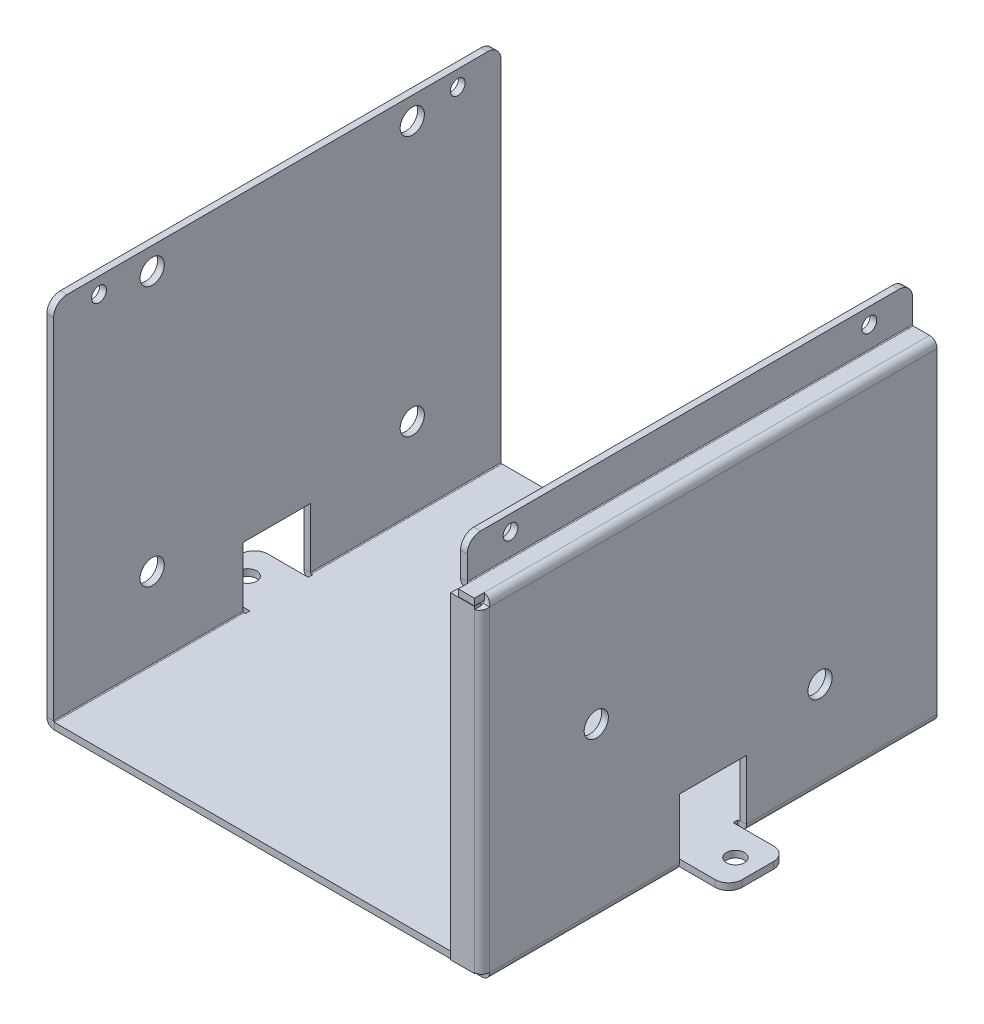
ISO-10303-21;
HEADER;
FILE_DESCRIPTION(('STEP AP214'),'2;1');
FILE_NAME('part.step','',(''),(''),'','','');
FILE_SCHEMA(('AUTOMOTIVE_DESIGN { 1 0 10303 214 1 1 1 1 }'));
ENDSEC;
DATA;
#1=APPLICATION_CONTEXT('core data for automotive mechanical design processes');
#2=APPLICATION_PROTOCOL_DEFINITION('international standard','automotive_design',2000,#1);
#3=PRODUCT_CONTEXT('',#1,'mechanical');
#4=PRODUCT('Part','Part','',(#3));
#5=PRODUCT_RELATED_PRODUCT_CATEGORY('part','',(#4));
#6=PRODUCT_DEFINITION_FORMATION('','',#4);
#7=PRODUCT_DEFINITION_CONTEXT('part definition',#1,'design');
#8=PRODUCT_DEFINITION('design','',#6,#7);
#9=PRODUCT_DEFINITION_SHAPE('','',#8);
#10=(LENGTH_UNIT() NAMED_UNIT(*) SI_UNIT(.MILLI.,.METRE.));
#11=(NAMED_UNIT(*) PLANE_ANGLE_UNIT() SI_UNIT($,.RADIAN.));
#12=(NAMED_UNIT(*) SI_UNIT($,.STERADIAN.) SOLID_ANGLE_UNIT());
#13=UNCERTAINTY_MEASURE_WITH_UNIT(LENGTH_MEASURE(1.E-05),#10,'distance_accuracy_value','');
#14=(GEOMETRIC_REPRESENTATION_CONTEXT(3) GLOBAL_UNCERTAINTY_ASSIGNED_CONTEXT((#13)) GLOBAL_UNIT_ASSIGNED_CONTEXT((#10,
#11,#12)) REPRESENTATION_CONTEXT('',''));
#15=CARTESIAN_POINT('',(0.,0.,0.));
#16=DIRECTION('',(0.,0.,1.));
#17=DIRECTION('',(1.,0.,0.));
#18=AXIS2_PLACEMENT_3D('',#15,#16,#17);
#19=CARTESIAN_POINT('',(-2.,0.,0.));
#20=DIRECTION('',(-1.,0.,0.));
#21=DIRECTION('',(0.,0.,1.));
#22=AXIS2_PLACEMENT_3D('',#19,#20,#21);
#23=PLANE('',#22);
#24=DIRECTION('',(0.,-1.,0.));
#25=VECTOR('',#24,1.);
#26=CARTESIAN_POINT('',(-2.,-35.5,6.49999999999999));
#27=LINE('',#26,#25);
#28=CARTESIAN_POINT('',(-2.,-35.5,6.49999999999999));
#29=VERTEX_POINT('',#28);
#30=CARTESIAN_POINT('',(-2.,-37.,6.49999999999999));
#31=VERTEX_POINT('',#30);
#32=EDGE_CURVE('E494',#29,#31,#27,.T.);
#33=ORIENTED_EDGE('',*,*,#32,.F.);
#34=DIRECTION('',(0.,0.,-1.));
#35=VECTOR('',#34,1.);
#36=CARTESIAN_POINT('',(-2.,-35.5,0.));
#37=LINE('',#36,#35);
#38=CARTESIAN_POINT('',(-2.,-35.5,7.49999999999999));
#39=VERTEX_POINT('',#38);
#40=EDGE_CURVE('E1090',#39,#29,#37,.T.);
#41=ORIENTED_EDGE('',*,*,#40,.F.);
#42=DIRECTION('',(0.,-1.,0.));
#43=VECTOR('',#42,1.);
#44=CARTESIAN_POINT('',(-2.,-37.,7.49999999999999));
#45=LINE('',#44,#43);
#46=CARTESIAN_POINT('',(-2.,-37.,7.49999999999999));
#47=VERTEX_POINT('',#46);
#48=EDGE_CURVE('E505',#39,#47,#45,.T.);
#49=ORIENTED_EDGE('',*,*,#48,.T.);
#50=DIRECTION('',(0.,0.,-1.));
#51=VECTOR('',#50,1.);
#52=CARTESIAN_POINT('',(-2.,-37.,7.49999999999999));
#53=LINE('',#52,#51);
#54=EDGE_CURVE('E484',#47,#31,#53,.T.);
#55=ORIENTED_EDGE('',*,*,#54,.T.);
#56=EDGE_LOOP('',(#33,#41,#49,#55));
#57=FACE_BOUND('',#56,.T.);
#58=ADVANCED_FACE('F98',(#57),#23,.F.);
#59=DIRECTION('',(0.,1.,0.));
#60=VECTOR('',#59,1.);
#61=CARTESIAN_POINT('',(-2.,-35.5,-6.50000000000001));
#62=LINE('',#61,#60);
#63=CARTESIAN_POINT('',(-2.,-37.,-6.50000000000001));
#64=VERTEX_POINT('',#63);
#65=CARTESIAN_POINT('',(-2.,-35.5,-6.50000000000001));
#66=VERTEX_POINT('',#65);
#67=EDGE_CURVE('E501',#64,#66,#62,.T.);
#68=ORIENTED_EDGE('',*,*,#67,.F.);
#69=CARTESIAN_POINT('',(-2.,-37.,-7.50000000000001));
#70=VERTEX_POINT('',#69);
#71=EDGE_CURVE('E509',#64,#70,#53,.T.);
#72=ORIENTED_EDGE('',*,*,#71,.T.);
#73=DIRECTION('',(0.,1.,0.));
#74=VECTOR('',#73,1.);
#75=CARTESIAN_POINT('',(-2.,-37.,-7.50000000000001));
#76=LINE('',#75,#74);
#77=CARTESIAN_POINT('',(-2.,-35.5,-7.50000000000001));
#78=VERTEX_POINT('',#77);
#79=EDGE_CURVE('E508',#70,#78,#76,.T.);
#80=ORIENTED_EDGE('',*,*,#79,.T.);
#81=EDGE_CURVE('E1089',#66,#78,#37,.T.);
#82=ORIENTED_EDGE('',*,*,#81,.F.);
#83=EDGE_LOOP('',(#68,#72,#80,#82));
#84=FACE_BOUND('',#83,.T.);
#85=ADVANCED_FACE('F1430',(#84),#23,.F.);
#86=CARTESIAN_POINT('',(-2.,-37.,-7.50000000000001));
#87=DIRECTION('',(0.,0.,-1.));
#88=DIRECTION('',(-1.,0.,0.));
#89=AXIS2_PLACEMENT_3D('',#86,#87,#88);
#90=PLANE('',#89);
#91=DIRECTION('',(0.,-1.,0.));
#92=VECTOR('',#91,1.);
#93=CARTESIAN_POINT('',(-1.5,0.,-7.50000000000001));
#94=LINE('',#93,#92);
#95=CARTESIAN_POINT('',(-1.5,-22.,-7.50000000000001));
#96=VERTEX_POINT('',#95);
#97=CARTESIAN_POINT('',(-1.5,-35.3,-7.50000000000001));
#98=VERTEX_POINT('',#97);
#99=EDGE_CURVE('E533',#96,#98,#94,.T.);
#100=ORIENTED_EDGE('',*,*,#99,.T.);
#101=DIRECTION('',(1.,0.,0.));
#102=VECTOR('',#101,1.);
#103=CARTESIAN_POINT('',(-1.5,-35.3,-7.50000000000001));
#104=LINE('',#103,#102);
#105=CARTESIAN_POINT('',(0.,-35.3,-7.50000000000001));
#106=VERTEX_POINT('',#105);
#107=EDGE_CURVE('E1102',#98,#106,#104,.T.);
#108=ORIENTED_EDGE('',*,*,#107,.T.);
#109=DIRECTION('',(0.,1.,0.));
#110=VECTOR('',#109,1.);
#111=CARTESIAN_POINT('',(0.,-37.,-7.50000000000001));
#112=LINE('',#111,#110);
#113=CARTESIAN_POINT('',(0.,-22.,-7.50000000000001));
#114=VERTEX_POINT('',#113);
#115=EDGE_CURVE('E522',#106,#114,#112,.T.);
#116=ORIENTED_EDGE('',*,*,#115,.T.);
#117=DIRECTION('',(1.,0.,0.));
#118=VECTOR('',#117,1.);
#119=CARTESIAN_POINT('',(-2.,-22.,-7.50000000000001));
#120=LINE('',#119,#118);
#121=EDGE_CURVE('E534',#96,#114,#120,.T.);
#122=ORIENTED_EDGE('',*,*,#121,.F.);
#123=EDGE_LOOP('',(#100,#108,#116,#122));
#124=FACE_BOUND('',#123,.T.);
#125=ADVANCED_FACE('F1435',(#124),#90,.F.);
#126=DIRECTION('',(1.,0.,0.));
#127=VECTOR('',#126,1.);
#128=CARTESIAN_POINT('',(-2.,-37.,-7.50000000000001));
#129=LINE('',#128,#127);
#130=CARTESIAN_POINT('',(-1.69999999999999,-37.,-7.50000000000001));
#131=VERTEX_POINT('',#130);
#132=EDGE_CURVE('E537',#70,#131,#129,.T.);
#133=ORIENTED_EDGE('',*,*,#132,.T.);
#134=DIRECTION('',(0.,1.,0.));
#135=VECTOR('',#134,1.);
#136=CARTESIAN_POINT('',(-1.69999999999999,-37.,-7.50000000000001));
#137=LINE('',#136,#135);
#138=CARTESIAN_POINT('',(-1.7,-35.5,-7.50000000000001));
#139=VERTEX_POINT('',#138);
#140=EDGE_CURVE('E1099',#131,#139,#137,.T.);
#141=ORIENTED_EDGE('',*,*,#140,.T.);
#142=DIRECTION('',(1.,0.,0.));
#143=VECTOR('',#142,1.);
#144=CARTESIAN_POINT('',(1.21582264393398E-13,-35.5,-7.50000000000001));
#145=LINE('',#144,#143);
#146=EDGE_CURVE('E546',#78,#139,#145,.T.);
#147=ORIENTED_EDGE('',*,*,#146,.F.);
#148=ORIENTED_EDGE('',*,*,#79,.F.);
#149=EDGE_LOOP('',(#133,#141,#147,#148));
#150=FACE_BOUND('',#149,.T.);
#151=ADVANCED_FACE('F1449',(#150),#90,.F.);
#152=CARTESIAN_POINT('',(-2.,-37.,7.49999999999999));
#153=DIRECTION('',(0.,0.,1.));
#154=DIRECTION('',(0.,-1.,0.));
#155=AXIS2_PLACEMENT_3D('',#152,#153,#154);
#156=PLANE('',#155);
#157=DIRECTION('',(-1.,0.,0.));
#158=VECTOR('',#157,1.);
#159=CARTESIAN_POINT('',(1.21582264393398E-13,-35.5,7.49999999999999));
#160=LINE('',#159,#158);
#161=CARTESIAN_POINT('',(-1.7,-35.5,7.49999999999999));
#162=VERTEX_POINT('',#161);
#163=EDGE_CURVE('E557',#162,#39,#160,.T.);
#164=ORIENTED_EDGE('',*,*,#163,.F.);
#165=DIRECTION('',(0.,-1.,0.));
#166=VECTOR('',#165,1.);
#167=CARTESIAN_POINT('',(-1.7,-35.5,7.49999999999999));
#168=LINE('',#167,#166);
#169=CARTESIAN_POINT('',(-1.7,-37.,7.49999999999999));
#170=VERTEX_POINT('',#169);
#171=EDGE_CURVE('E1096',#162,#170,#168,.T.);
#172=ORIENTED_EDGE('',*,*,#171,.T.);
#173=DIRECTION('',(1.,0.,0.));
#174=VECTOR('',#173,1.);
#175=CARTESIAN_POINT('',(-2.,-37.,7.49999999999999));
#176=LINE('',#175,#174);
#177=EDGE_CURVE('E515',#47,#170,#176,.T.);
#178=ORIENTED_EDGE('',*,*,#177,.F.);
#179=ORIENTED_EDGE('',*,*,#48,.F.);
#180=EDGE_LOOP('',(#164,#172,#178,#179));
#181=FACE_BOUND('',#180,.T.);
#182=ADVANCED_FACE('F1454',(#181),#156,.F.);
#183=DIRECTION('',(0.,-1.,0.));
#184=VECTOR('',#183,1.);
#185=CARTESIAN_POINT('',(0.,-37.,7.49999999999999));
#186=LINE('',#185,#184);
#187=CARTESIAN_POINT('',(0.,-22.,7.49999999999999));
#188=VERTEX_POINT('',#187);
#189=CARTESIAN_POINT('',(0.,-35.3,7.49999999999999));
#190=VERTEX_POINT('',#189);
#191=EDGE_CURVE('E490',#188,#190,#186,.T.);
#192=ORIENTED_EDGE('',*,*,#191,.T.);
#193=DIRECTION('',(-1.,0.,0.));
#194=VECTOR('',#193,1.);
#195=CARTESIAN_POINT('',(0.,-35.3,7.49999999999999));
#196=LINE('',#195,#194);
#197=CARTESIAN_POINT('',(-1.5,-35.3,7.49999999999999));
#198=VERTEX_POINT('',#197);
#199=EDGE_CURVE('E1093',#190,#198,#196,.T.);
#200=ORIENTED_EDGE('',*,*,#199,.T.);
#201=DIRECTION('',(0.,1.,0.));
#202=VECTOR('',#201,1.);
#203=CARTESIAN_POINT('',(-1.5,0.,7.5));
#204=LINE('',#203,#202);
#205=CARTESIAN_POINT('',(-1.5,-22.,7.49999999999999));
#206=VERTEX_POINT('',#205);
#207=EDGE_CURVE('E554',#198,#206,#204,.T.);
#208=ORIENTED_EDGE('',*,*,#207,.T.);
#209=DIRECTION('',(1.,0.,0.));
#210=VECTOR('',#209,1.);
#211=CARTESIAN_POINT('',(-2.,-22.,7.49999999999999));
#212=LINE('',#211,#210);
#213=EDGE_CURVE('E530',#206,#188,#212,.T.);
#214=ORIENTED_EDGE('',*,*,#213,.T.);
#215=EDGE_LOOP('',(#192,#200,#208,#214));
#216=FACE_BOUND('',#215,.T.);
#217=ADVANCED_FACE('F1455',(#216),#156,.F.);
#218=CARTESIAN_POINT('',(-1.7,-35.3,49.8));
#219=DIRECTION('',(0.,0.,1.));
#220=DIRECTION('',(0.,-1.,0.));
#221=AXIS2_PLACEMENT_3D('',#218,#219,#220);
#222=CYLINDRICAL_SURFACE('',#221,1.7);
#223=CARTESIAN_POINT('',(-1.7,-35.3,7.49999999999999));
#224=DIRECTION('',(0.,0.,1.));
#225=DIRECTION('',(0.,-1.,0.));
#226=AXIS2_PLACEMENT_3D('',#223,#224,#225);
#227=CIRCLE('',#226,1.7);
#228=EDGE_CURVE('E561',#190,#170,#227,.F.);
#229=ORIENTED_EDGE('',*,*,#228,.F.);
#230=DIRECTION('',(0.,0.,1.));
#231=VECTOR('',#230,1.);
#232=CARTESIAN_POINT('',(0.,-35.3,49.8));
#233=LINE('',#232,#231);
#234=CARTESIAN_POINT('',(0.,-35.3,49.8));
#235=VERTEX_POINT('',#234);
#236=EDGE_CURVE('E766',#235,#190,#233,.F.);
#237=ORIENTED_EDGE('',*,*,#236,.F.);
#238=CARTESIAN_POINT('',(-1.7,-35.3,49.8));
#239=DIRECTION('',(0.,0.,1.));
#240=DIRECTION('',(1.,0.,0.));
#241=AXIS2_PLACEMENT_3D('',#238,#239,#240);
#242=CIRCLE('',#241,1.7);
#243=CARTESIAN_POINT('',(-1.69999999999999,-37.,49.8));
#244=VERTEX_POINT('',#243);
#245=EDGE_CURVE('E776',#244,#235,#242,.T.);
#246=ORIENTED_EDGE('',*,*,#245,.F.);
#247=DIRECTION('',(0.,0.,1.));
#248=VECTOR('',#247,1.);
#249=CARTESIAN_POINT('',(-1.69999999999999,-37.,0.));
#250=LINE('',#249,#248);
#251=EDGE_CURVE('E741',#170,#244,#250,.T.);
#252=ORIENTED_EDGE('',*,*,#251,.F.);
#253=EDGE_LOOP('',(#229,#237,#246,#252));
#254=FACE_BOUND('',#253,.T.);
#255=ADVANCED_FACE('F1547',(#254),#222,.T.);
#256=CARTESIAN_POINT('',(-1.7,-35.3,49.8));
#257=DIRECTION('',(0.,0.,1.));
#258=DIRECTION('',(0.,-1.,0.));
#259=AXIS2_PLACEMENT_3D('',#256,#257,#258);
#260=CYLINDRICAL_SURFACE('',#259,0.199999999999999);
#261=DIRECTION('',(0.,0.,1.));
#262=VECTOR('',#261,1.);
#263=CARTESIAN_POINT('',(-1.5,-35.3,49.8));
#264=LINE('',#263,#262);
#265=CARTESIAN_POINT('',(-1.5,-35.3,49.8));
#266=VERTEX_POINT('',#265);
#267=EDGE_CURVE('E784',#266,#198,#264,.F.);
#268=ORIENTED_EDGE('',*,*,#267,.T.);
#269=CARTESIAN_POINT('',(-1.7,-35.3,7.49999999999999));
#270=DIRECTION('',(0.,0.,1.));
#271=DIRECTION('',(0.,-1.,0.));
#272=AXIS2_PLACEMENT_3D('',#269,#270,#271);
#273=CIRCLE('',#272,0.199999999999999);
#274=EDGE_CURVE('E1085',#198,#162,#273,.F.);
#275=ORIENTED_EDGE('',*,*,#274,.T.);
#276=DIRECTION('',(0.,0.,1.));
#277=VECTOR('',#276,1.);
#278=CARTESIAN_POINT('',(-1.7,-35.5,-50.));
#279=LINE('',#278,#277);
#280=CARTESIAN_POINT('',(-1.7,-35.5,49.8));
#281=VERTEX_POINT('',#280);
#282=EDGE_CURVE('E737',#162,#281,#279,.T.);
#283=ORIENTED_EDGE('',*,*,#282,.T.);
#284=CARTESIAN_POINT('',(-1.7,-35.3,49.8));
#285=DIRECTION('',(0.,0.,1.));
#286=DIRECTION('',(1.,0.,0.));
#287=AXIS2_PLACEMENT_3D('',#284,#285,#286);
#288=CIRCLE('',#287,0.199999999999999);
#289=EDGE_CURVE('E759',#281,#266,#288,.T.);
#290=ORIENTED_EDGE('',*,*,#289,.T.);
#291=EDGE_LOOP('',(#268,#275,#283,#290));
#292=FACE_BOUND('',#291,.T.);
#293=ADVANCED_FACE('F1472',(#292),#260,.F.);
#294=CARTESIAN_POINT('',(-96.7500000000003,-7.16766713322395E-13,0.));
#295=DIRECTION('',(1.,0.,0.));
#296=DIRECTION('',(0.,1.,0.));
#297=AXIS2_PLACEMENT_3D('',#294,#295,#296);
#298=PLANE('',#297);
#299=DIRECTION('',(0.,-1.,0.));
#300=VECTOR('',#299,1.);
#301=CARTESIAN_POINT('',(-96.75,-35.5000000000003,-6.49999999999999));
#302=LINE('',#301,#300);
#303=CARTESIAN_POINT('',(-96.75,-35.5000000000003,-6.49999999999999));
#304=VERTEX_POINT('',#303);
#305=CARTESIAN_POINT('',(-96.75,-37.0000000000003,-6.49999999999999));
#306=VERTEX_POINT('',#305);
#307=EDGE_CURVE('E568',#304,#306,#302,.T.);
#308=ORIENTED_EDGE('',*,*,#307,.F.);
#309=DIRECTION('',(0.,0.,1.));
#310=VECTOR('',#309,1.);
#311=CARTESIAN_POINT('',(-96.75,-35.5000000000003,0.));
#312=LINE('',#311,#310);
#313=CARTESIAN_POINT('',(-96.75,-35.5000000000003,-7.49999999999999));
#314=VERTEX_POINT('',#313);
#315=EDGE_CURVE('E1065',#314,#304,#312,.T.);
#316=ORIENTED_EDGE('',*,*,#315,.F.);
#317=DIRECTION('',(0.,-1.,0.));
#318=VECTOR('',#317,1.);
#319=CARTESIAN_POINT('',(-96.75,-37.0000000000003,-7.49999999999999));
#320=LINE('',#319,#318);
#321=CARTESIAN_POINT('',(-96.75,-37.0000000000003,-7.49999999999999));
#322=VERTEX_POINT('',#321);
#323=EDGE_CURVE('E597',#314,#322,#320,.T.);
#324=ORIENTED_EDGE('',*,*,#323,.T.);
#325=DIRECTION('',(0.,0.,1.));
#326=VECTOR('',#325,1.);
#327=CARTESIAN_POINT('',(-96.75,-37.0000000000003,-7.49999999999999));
#328=LINE('',#327,#326);
#329=EDGE_CURVE('E602',#322,#306,#328,.T.);
#330=ORIENTED_EDGE('',*,*,#329,.T.);
#331=EDGE_LOOP('',(#308,#316,#324,#330));
#332=FACE_BOUND('',#331,.T.);
#333=ADVANCED_FACE('F1468',(#332),#298,.F.);
#334=DIRECTION('',(0.,1.,0.));
#335=VECTOR('',#334,1.);
#336=CARTESIAN_POINT('',(-96.75,-35.5000000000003,6.50000000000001));
#337=LINE('',#336,#335);
#338=CARTESIAN_POINT('',(-96.75,-37.0000000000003,6.50000000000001));
#339=VERTEX_POINT('',#338);
#340=CARTESIAN_POINT('',(-96.75,-35.5000000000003,6.50000000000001));
#341=VERTEX_POINT('',#340);
#342=EDGE_CURVE('E574',#339,#341,#337,.T.);
#343=ORIENTED_EDGE('',*,*,#342,.F.);
#344=CARTESIAN_POINT('',(-96.75,-37.0000000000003,7.50000000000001));
#345=VERTEX_POINT('',#344);
#346=EDGE_CURVE('E600',#339,#345,#328,.T.);
#347=ORIENTED_EDGE('',*,*,#346,.T.);
#348=DIRECTION('',(0.,1.,0.));
#349=VECTOR('',#348,1.);
#350=CARTESIAN_POINT('',(-96.75,-37.0000000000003,7.50000000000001));
#351=LINE('',#350,#349);
#352=CARTESIAN_POINT('',(-96.75,-35.5000000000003,7.50000000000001));
#353=VERTEX_POINT('',#352);
#354=EDGE_CURVE('E606',#345,#353,#351,.T.);
#355=ORIENTED_EDGE('',*,*,#354,.T.);
#356=EDGE_CURVE('E1064',#341,#353,#312,.T.);
#357=ORIENTED_EDGE('',*,*,#356,.F.);
#358=EDGE_LOOP('',(#343,#347,#355,#357));
#359=FACE_BOUND('',#358,.T.);
#360=ADVANCED_FACE('F1471',(#359),#298,.F.);
#361=CARTESIAN_POINT('',(-96.75,-37.0000000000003,7.50000000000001));
#362=DIRECTION('',(0.,0.,1.));
#363=DIRECTION('',(1.,0.,0.));
#364=AXIS2_PLACEMENT_3D('',#361,#362,#363);
#365=PLANE('',#364);
#366=DIRECTION('',(0.,1.,0.));
#367=VECTOR('',#366,1.);
#368=CARTESIAN_POINT('',(-97.2500000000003,-6.71619040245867E-13,7.50000000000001));
#369=LINE('',#368,#367);
#370=CARTESIAN_POINT('',(-97.25,-35.3000000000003,7.50000000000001));
#371=VERTEX_POINT('',#370);
#372=CARTESIAN_POINT('',(-97.2500000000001,-22.0000000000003,7.50000000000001));
#373=VERTEX_POINT('',#372);
#374=EDGE_CURVE('E1052',#371,#373,#369,.T.);
#375=ORIENTED_EDGE('',*,*,#374,.F.);
#376=DIRECTION('',(-1.,0.,0.));
#377=VECTOR('',#376,1.);
#378=CARTESIAN_POINT('',(-97.25,-35.3000000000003,7.50000000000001));
#379=LINE('',#378,#377);
#380=CARTESIAN_POINT('',(-98.75,-35.3000000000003,7.50000000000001));
#381=VERTEX_POINT('',#380);
#382=EDGE_CURVE('E1078',#371,#381,#379,.T.);
#383=ORIENTED_EDGE('',*,*,#382,.T.);
#384=DIRECTION('',(0.,1.,0.));
#385=VECTOR('',#384,1.);
#386=CARTESIAN_POINT('',(-98.75,-37.0000000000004,7.50000000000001));
#387=LINE('',#386,#385);
#388=CARTESIAN_POINT('',(-98.7500000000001,-22.0000000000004,7.50000000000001));
#389=VERTEX_POINT('',#388);
#390=EDGE_CURVE('E614',#381,#389,#387,.T.);
#391=ORIENTED_EDGE('',*,*,#390,.T.);
#392=DIRECTION('',(-1.,0.,0.));
#393=VECTOR('',#392,1.);
#394=CARTESIAN_POINT('',(-96.7500000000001,-22.0000000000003,7.50000000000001));
#395=LINE('',#394,#393);
#396=EDGE_CURVE('E625',#373,#389,#395,.T.);
#397=ORIENTED_EDGE('',*,*,#396,.F.);
#398=EDGE_LOOP('',(#375,#383,#391,#397));
#399=FACE_BOUND('',#398,.T.);
#400=ADVANCED_FACE('F1482',(#399),#365,.F.);
#401=DIRECTION('',(-1.,0.,0.));
#402=VECTOR('',#401,1.);
#403=CARTESIAN_POINT('',(-96.75,-37.0000000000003,7.50000000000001));
#404=LINE('',#403,#402);
#405=CARTESIAN_POINT('',(-97.05,-37.0000000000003,7.50000000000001));
#406=VERTEX_POINT('',#405);
#407=EDGE_CURVE('E628',#345,#406,#404,.T.);
#408=ORIENTED_EDGE('',*,*,#407,.T.);
#409=DIRECTION('',(0.,1.,0.));
#410=VECTOR('',#409,1.);
#411=CARTESIAN_POINT('',(-97.05,-37.0000000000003,7.50000000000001));
#412=LINE('',#411,#410);
#413=CARTESIAN_POINT('',(-97.05,-35.5000000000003,7.50000000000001));
#414=VERTEX_POINT('',#413);
#415=EDGE_CURVE('E1075',#406,#414,#412,.T.);
#416=ORIENTED_EDGE('',*,*,#415,.T.);
#417=DIRECTION('',(-1.,0.,0.));
#418=VECTOR('',#417,1.);
#419=CARTESIAN_POINT('',(1.21582264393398E-13,-35.5,7.50000000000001));
#420=LINE('',#419,#418);
#421=EDGE_CURVE('E638',#353,#414,#420,.T.);
#422=ORIENTED_EDGE('',*,*,#421,.F.);
#423=ORIENTED_EDGE('',*,*,#354,.F.);
#424=EDGE_LOOP('',(#408,#416,#422,#423));
#425=FACE_BOUND('',#424,.T.);
#426=ADVANCED_FACE('F1483',(#425),#365,.F.);
#427=CARTESIAN_POINT('',(-96.75,-37.0000000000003,-7.49999999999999));
#428=DIRECTION('',(0.,0.,-1.));
#429=DIRECTION('',(-1.,0.,0.));
#430=AXIS2_PLACEMENT_3D('',#427,#428,#429);
#431=PLANE('',#430);
#432=DIRECTION('',(1.,0.,0.));
#433=VECTOR('',#432,1.);
#434=CARTESIAN_POINT('',(1.21582264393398E-13,-35.5,-7.49999999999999));
#435=LINE('',#434,#433);
#436=CARTESIAN_POINT('',(-97.05,-35.5000000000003,-7.49999999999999));
#437=VERTEX_POINT('',#436);
#438=EDGE_CURVE('E650',#437,#314,#435,.T.);
#439=ORIENTED_EDGE('',*,*,#438,.F.);
#440=DIRECTION('',(0.,-1.,0.));
#441=VECTOR('',#440,1.);
#442=CARTESIAN_POINT('',(-97.05,-35.5000000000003,-7.49999999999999));
#443=LINE('',#442,#441);
#444=CARTESIAN_POINT('',(-97.05,-37.0000000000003,-7.49999999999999));
#445=VERTEX_POINT('',#444);
#446=EDGE_CURVE('E1072',#437,#445,#443,.T.);
#447=ORIENTED_EDGE('',*,*,#446,.T.);
#448=DIRECTION('',(-1.,0.,0.));
#449=VECTOR('',#448,1.);
#450=CARTESIAN_POINT('',(-96.75,-37.0000000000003,-7.49999999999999));
#451=LINE('',#450,#449);
#452=EDGE_CURVE('E610',#322,#445,#451,.T.);
#453=ORIENTED_EDGE('',*,*,#452,.F.);
#454=ORIENTED_EDGE('',*,*,#323,.F.);
#455=EDGE_LOOP('',(#439,#447,#453,#454));
#456=FACE_BOUND('',#455,.T.);
#457=ADVANCED_FACE('F1488',(#456),#431,.F.);
#458=DIRECTION('',(0.,-1.,0.));
#459=VECTOR('',#458,1.);
#460=CARTESIAN_POINT('',(-98.75,-37.0000000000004,-7.49999999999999));
#461=LINE('',#460,#459);
#462=CARTESIAN_POINT('',(-98.7500000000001,-22.0000000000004,-7.49999999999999));
#463=VERTEX_POINT('',#462);
#464=CARTESIAN_POINT('',(-98.75,-35.3000000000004,-7.49999999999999));
#465=VERTEX_POINT('',#464);
#466=EDGE_CURVE('E596',#463,#465,#461,.T.);
#467=ORIENTED_EDGE('',*,*,#466,.T.);
#468=DIRECTION('',(1.,0.,0.));
#469=VECTOR('',#468,1.);
#470=CARTESIAN_POINT('',(-98.75,-35.3000000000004,-7.49999999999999));
#471=LINE('',#470,#469);
#472=CARTESIAN_POINT('',(-97.25,-35.3000000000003,-7.49999999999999));
#473=VERTEX_POINT('',#472);
#474=EDGE_CURVE('E1069',#465,#473,#471,.T.);
#475=ORIENTED_EDGE('',*,*,#474,.T.);
#476=DIRECTION('',(0.,-1.,0.));
#477=VECTOR('',#476,1.);
#478=CARTESIAN_POINT('',(-97.2500000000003,-6.71619040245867E-13,-7.49999999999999));
#479=LINE('',#478,#477);
#480=CARTESIAN_POINT('',(-97.2500000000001,-22.0000000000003,-7.49999999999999));
#481=VERTEX_POINT('',#480);
#482=EDGE_CURVE('E1060',#481,#473,#479,.T.);
#483=ORIENTED_EDGE('',*,*,#482,.F.);
#484=DIRECTION('',(-1.,0.,0.));
#485=VECTOR('',#484,1.);
#486=CARTESIAN_POINT('',(-96.7500000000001,-22.0000000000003,-7.49999999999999));
#487=LINE('',#486,#485);
#488=EDGE_CURVE('E621',#481,#463,#487,.T.);
#489=ORIENTED_EDGE('',*,*,#488,.T.);
#490=EDGE_LOOP('',(#467,#475,#483,#489));
#491=FACE_BOUND('',#490,.T.);
#492=ADVANCED_FACE('F1489',(#491),#431,.F.);
#493=CARTESIAN_POINT('',(-97.05,-35.3000000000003,49.8));
#494=DIRECTION('',(0.,0.,1.));
#495=DIRECTION('',(-1.,0.,0.));
#496=AXIS2_PLACEMENT_3D('',#493,#494,#495);
#497=CYLINDRICAL_SURFACE('',#496,1.70000000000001);
#498=CARTESIAN_POINT('',(-97.05,-35.3000000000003,-7.49999999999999));
#499=DIRECTION('',(0.,0.,-1.));
#500=DIRECTION('',(-1.,0.,0.));
#501=AXIS2_PLACEMENT_3D('',#498,#499,#500);
#502=CIRCLE('',#501,1.70000000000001);
#503=EDGE_CURVE('E654',#465,#445,#502,.F.);
#504=ORIENTED_EDGE('',*,*,#503,.F.);
#505=DIRECTION('',(0.,0.,1.));
#506=VECTOR('',#505,1.);
#507=CARTESIAN_POINT('',(-98.75,-35.3000000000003,0.));
#508=LINE('',#507,#506);
#509=CARTESIAN_POINT('',(-98.75,-35.3000000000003,-50.));
#510=VERTEX_POINT('',#509);
#511=EDGE_CURVE('E681',#510,#465,#508,.T.);
#512=ORIENTED_EDGE('',*,*,#511,.F.);
#513=CARTESIAN_POINT('',(-97.05,-35.3000000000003,-50.));
#514=DIRECTION('',(0.,0.,1.));
#515=DIRECTION('',(1.,0.,0.));
#516=AXIS2_PLACEMENT_3D('',#513,#514,#515);
#517=CIRCLE('',#516,1.70000000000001);
#518=CARTESIAN_POINT('',(-97.05,-37.0000000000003,-50.));
#519=VERTEX_POINT('',#518);
#520=EDGE_CURVE('E702',#519,#510,#517,.F.);
#521=ORIENTED_EDGE('',*,*,#520,.F.);
#522=DIRECTION('',(0.,0.,1.));
#523=VECTOR('',#522,1.);
#524=CARTESIAN_POINT('',(-97.05,-37.0000000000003,49.8));
#525=LINE('',#524,#523);
#526=EDGE_CURVE('E703',#445,#519,#525,.F.);
#527=ORIENTED_EDGE('',*,*,#526,.F.);
#528=EDGE_LOOP('',(#504,#512,#521,#527));
#529=FACE_BOUND('',#528,.T.);
#530=ADVANCED_FACE('F1515',(#529),#497,.T.);
#531=CARTESIAN_POINT('',(-97.05,-35.3000000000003,49.8));
#532=DIRECTION('',(0.,0.,1.));
#533=DIRECTION('',(-1.,0.,0.));
#534=AXIS2_PLACEMENT_3D('',#531,#532,#533);
#535=CYLINDRICAL_SURFACE('',#534,0.200000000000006);
#536=DIRECTION('',(0.,0.,-1.));
#537=VECTOR('',#536,1.);
#538=CARTESIAN_POINT('',(-97.25,-35.3000000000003,-50.));
#539=LINE('',#538,#537);
#540=CARTESIAN_POINT('',(-97.25,-35.3000000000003,-50.));
#541=VERTEX_POINT('',#540);
#542=EDGE_CURVE('E690',#541,#473,#539,.F.);
#543=ORIENTED_EDGE('',*,*,#542,.T.);
#544=CARTESIAN_POINT('',(-97.05,-35.3000000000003,-7.49999999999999));
#545=DIRECTION('',(0.,0.,-1.));
#546=DIRECTION('',(-1.,0.,0.));
#547=AXIS2_PLACEMENT_3D('',#544,#545,#546);
#548=CIRCLE('',#547,0.200000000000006);
#549=EDGE_CURVE('E646',#473,#437,#548,.F.);
#550=ORIENTED_EDGE('',*,*,#549,.T.);
#551=DIRECTION('',(0.,0.,1.));
#552=VECTOR('',#551,1.);
#553=CARTESIAN_POINT('',(-97.05,-35.5000000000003,49.8));
#554=LINE('',#553,#552);
#555=CARTESIAN_POINT('',(-97.05,-35.5000000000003,-50.));
#556=VERTEX_POINT('',#555);
#557=EDGE_CURVE('E720',#437,#556,#554,.F.);
#558=ORIENTED_EDGE('',*,*,#557,.T.);
#559=CARTESIAN_POINT('',(-97.05,-35.3000000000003,-50.));
#560=DIRECTION('',(0.,0.,1.));
#561=DIRECTION('',(1.,0.,0.));
#562=AXIS2_PLACEMENT_3D('',#559,#560,#561);
#563=CIRCLE('',#562,0.200000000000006);
#564=EDGE_CURVE('E712',#556,#541,#563,.F.);
#565=ORIENTED_EDGE('',*,*,#564,.T.);
#566=EDGE_LOOP('',(#543,#550,#558,#565));
#567=FACE_BOUND('',#566,.T.);
#568=ADVANCED_FACE('F1519',(#567),#535,.F.);
#569=CARTESIAN_POINT('',(-1.5,-37.,49.8));
#570=DIRECTION('',(0.,0.,1.));
#571=DIRECTION('',(1.,0.,0.));
#572=AXIS2_PLACEMENT_3D('',#569,#570,#571);
#573=PLANE('',#572);
#574=DIRECTION('',(1.,0.,0.));
#575=VECTOR('',#574,1.);
#576=CARTESIAN_POINT('',(-1.5,-35.5,49.8));
#577=LINE('',#576,#575);
#578=CARTESIAN_POINT('',(-97.05,-35.5000000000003,49.8));
#579=VERTEX_POINT('',#578);
#580=EDGE_CURVE('E755',#579,#281,#577,.T.);
#581=ORIENTED_EDGE('',*,*,#580,.F.);
#582=DIRECTION('',(0.,-1.,0.));
#583=VECTOR('',#582,1.);
#584=CARTESIAN_POINT('',(-97.05,-35.5000000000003,49.8));
#585=LINE('',#584,#583);
#586=CARTESIAN_POINT('',(-97.05,-37.0000000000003,49.8));
#587=VERTEX_POINT('',#586);
#588=EDGE_CURVE('E707',#579,#587,#585,.T.);
#589=ORIENTED_EDGE('',*,*,#588,.T.);
#590=DIRECTION('',(1.,0.,0.));
#591=VECTOR('',#590,1.);
#592=CARTESIAN_POINT('',(-1.5,-37.,49.8));
#593=LINE('',#592,#591);
#594=EDGE_CURVE('E754',#587,#244,#593,.T.);
#595=ORIENTED_EDGE('',*,*,#594,.T.);
#596=DIRECTION('',(0.,-1.,0.));
#597=VECTOR('',#596,1.);
#598=CARTESIAN_POINT('',(-1.69999999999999,-35.5,49.8));
#599=LINE('',#598,#597);
#600=EDGE_CURVE('E736',#281,#244,#599,.T.);
#601=ORIENTED_EDGE('',*,*,#600,.F.);
#602=EDGE_LOOP('',(#581,#589,#595,#601));
#603=FACE_BOUND('',#602,.T.);
#604=ADVANCED_FACE('F1530',(#603),#573,.T.);
#605=CARTESIAN_POINT('',(1.26819486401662E-13,-37.,0.));
#606=DIRECTION('',(0.,-1.,0.));
#607=DIRECTION('',(1.,0.,0.));
#608=AXIS2_PLACEMENT_3D('',#605,#606,#607);
#609=PLANE('',#608);
#610=CARTESIAN_POINT('',(4.99999999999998,-37.,0.));
#611=DIRECTION('',(0.,-1.,0.));
#612=DIRECTION('',(1.,0.,0.));
#613=AXIS2_PLACEMENT_3D('',#610,#611,#612);
#614=CIRCLE('',#613,2.);
#615=CARTESIAN_POINT('',(6.99999999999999,-37.,0.));
#616=VERTEX_POINT('',#615);
#617=EDGE_CURVE('E1760',#616,#616,#614,.T.);
#618=ORIENTED_EDGE('',*,*,#617,.F.);
#619=EDGE_LOOP('',(#618));
#620=FACE_BOUND('',#619,.T.);
#621=CARTESIAN_POINT('',(-103.75,-37.0000000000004,0.));
#622=DIRECTION('',(0.,-1.,0.));
#623=DIRECTION('',(1.,0.,0.));
#624=AXIS2_PLACEMENT_3D('',#621,#622,#623);
#625=CIRCLE('',#624,2.);
#626=CARTESIAN_POINT('',(-101.75,-37.0000000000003,0.));
#627=VERTEX_POINT('',#626);
#628=EDGE_CURVE('E502',#627,#627,#625,.T.);
#629=ORIENTED_EDGE('',*,*,#628,.F.);
#630=EDGE_LOOP('',(#629));
#631=FACE_BOUND('',#630,.T.);
#632=DIRECTION('',(-1.,0.,0.));
#633=VECTOR('',#632,1.);
#634=CARTESIAN_POINT('',(10.,-37.,-6.50000000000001));
#635=LINE('',#634,#633);
#636=CARTESIAN_POINT('',(7.,-37.,-6.50000000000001));
#637=VERTEX_POINT('',#636);
#638=EDGE_CURVE('E491',#637,#64,#635,.T.);
#639=ORIENTED_EDGE('',*,*,#638,.F.);
#640=CARTESIAN_POINT('',(7.,-37.,-3.50000000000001));
#641=DIRECTION('',(0.,-1.,0.));
#642=DIRECTION('',(1.,0.,0.));
#643=AXIS2_PLACEMENT_3D('',#640,#641,#642);
#644=CIRCLE('',#643,3.);
#645=CARTESIAN_POINT('',(10.,-37.,-3.50000000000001));
#646=VERTEX_POINT('',#645);
#647=EDGE_CURVE('E1135',#637,#646,#644,.T.);
#648=ORIENTED_EDGE('',*,*,#647,.T.);
#649=DIRECTION('',(0.,0.,-1.));
#650=VECTOR('',#649,1.);
#651=CARTESIAN_POINT('',(10.,-37.,6.49999999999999));
#652=LINE('',#651,#650);
#653=CARTESIAN_POINT('',(10.,-37.,3.49999999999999));
#654=VERTEX_POINT('',#653);
#655=EDGE_CURVE('E1295',#654,#646,#652,.T.);
#656=ORIENTED_EDGE('',*,*,#655,.F.);
#657=CARTESIAN_POINT('',(7.,-37.,3.49999999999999));
#658=DIRECTION('',(0.,-1.,0.));
#659=DIRECTION('',(1.,0.,0.));
#660=AXIS2_PLACEMENT_3D('',#657,#658,#659);
#661=CIRCLE('',#660,3.);
#662=CARTESIAN_POINT('',(7.,-37.,6.49999999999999));
#663=VERTEX_POINT('',#662);
#664=EDGE_CURVE('E486',#654,#663,#661,.T.);
#665=ORIENTED_EDGE('',*,*,#664,.T.);
#666=DIRECTION('',(-1.,0.,0.));
#667=VECTOR('',#666,1.);
#668=CARTESIAN_POINT('',(10.,-37.,6.49999999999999));
#669=LINE('',#668,#667);
#670=EDGE_CURVE('E478',#663,#31,#669,.T.);
#671=ORIENTED_EDGE('',*,*,#670,.T.);
#672=ORIENTED_EDGE('',*,*,#54,.F.);
#673=ORIENTED_EDGE('',*,*,#177,.T.);
#674=ORIENTED_EDGE('',*,*,#251,.T.);
#675=ORIENTED_EDGE('',*,*,#594,.F.);
#676=EDGE_CURVE('E698',#587,#406,#525,.F.);
#677=ORIENTED_EDGE('',*,*,#676,.T.);
#678=ORIENTED_EDGE('',*,*,#407,.F.);
#679=ORIENTED_EDGE('',*,*,#346,.F.);
#680=DIRECTION('',(1.,0.,0.));
#681=VECTOR('',#680,1.);
#682=CARTESIAN_POINT('',(-108.75,-37.0000000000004,6.50000000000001));
#683=LINE('',#682,#681);
#684=CARTESIAN_POINT('',(-105.75,-37.0000000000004,6.50000000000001));
#685=VERTEX_POINT('',#684);
#686=EDGE_CURVE('E590',#685,#339,#683,.T.);
#687=ORIENTED_EDGE('',*,*,#686,.F.);
#688=CARTESIAN_POINT('',(-105.75,-37.0000000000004,3.50000000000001));
#689=DIRECTION('',(0.,-1.,0.));
#690=DIRECTION('',(1.,0.,0.));
#691=AXIS2_PLACEMENT_3D('',#688,#689,#690);
#692=CIRCLE('',#691,3.);
#693=CARTESIAN_POINT('',(-108.75,-37.0000000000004,3.50000000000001));
#694=VERTEX_POINT('',#693);
#695=EDGE_CURVE('E1130',#685,#694,#692,.T.);
#696=ORIENTED_EDGE('',*,*,#695,.T.);
#697=DIRECTION('',(0.,0.,1.));
#698=VECTOR('',#697,1.);
#699=CARTESIAN_POINT('',(-108.75,-37.0000000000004,-6.49999999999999));
#700=LINE('',#699,#698);
#701=CARTESIAN_POINT('',(-108.75,-37.0000000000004,-3.49999999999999));
#702=VERTEX_POINT('',#701);
#703=EDGE_CURVE('E569',#702,#694,#700,.T.);
#704=ORIENTED_EDGE('',*,*,#703,.F.);
#705=CARTESIAN_POINT('',(-105.75,-37.0000000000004,-3.49999999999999));
#706=DIRECTION('',(0.,-1.,0.));
#707=DIRECTION('',(1.,0.,0.));
#708=AXIS2_PLACEMENT_3D('',#705,#706,#707);
#709=CIRCLE('',#708,3.);
#710=CARTESIAN_POINT('',(-105.75,-37.0000000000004,-6.49999999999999));
#711=VERTEX_POINT('',#710);
#712=EDGE_CURVE('E1127',#702,#711,#709,.T.);
#713=ORIENTED_EDGE('',*,*,#712,.T.);
#714=DIRECTION('',(1.,0.,0.));
#715=VECTOR('',#714,1.);
#716=CARTESIAN_POINT('',(-108.75,-37.0000000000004,-6.49999999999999));
#717=LINE('',#716,#715);
#718=EDGE_CURVE('E593',#711,#306,#717,.T.);
#719=ORIENTED_EDGE('',*,*,#718,.T.);
#720=ORIENTED_EDGE('',*,*,#329,.F.);
#721=ORIENTED_EDGE('',*,*,#452,.T.);
#722=ORIENTED_EDGE('',*,*,#526,.T.);
#723=DIRECTION('',(-1.,0.,0.));
#724=VECTOR('',#723,1.);
#725=CARTESIAN_POINT('',(-98.75,-37.0000000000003,-50.));
#726=LINE('',#725,#724);
#727=CARTESIAN_POINT('',(-1.69999999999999,-37.,-50.));
#728=VERTEX_POINT('',#727);
#729=EDGE_CURVE('E750',#728,#519,#726,.T.);
#730=ORIENTED_EDGE('',*,*,#729,.F.);
#731=EDGE_CURVE('E745',#728,#131,#250,.T.);
#732=ORIENTED_EDGE('',*,*,#731,.T.);
#733=ORIENTED_EDGE('',*,*,#132,.F.);
#734=ORIENTED_EDGE('',*,*,#71,.F.);
#735=EDGE_LOOP('',(#639,#648,#656,#665,#671,#672,#673,#674,#675,#677,#678,#679,#687,#696,#704,
#713,#719,#720,#721,#722,#730,#732,#733,#734));
#736=FACE_BOUND('',#735,.T.);
#737=ADVANCED_FACE('F481',(#620,#631,#736),#609,.T.);
#738=CARTESIAN_POINT('',(1.21582264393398E-13,-35.5,0.));
#739=DIRECTION('',(0.,-1.,0.));
#740=DIRECTION('',(1.,0.,0.));
#741=AXIS2_PLACEMENT_3D('',#738,#739,#740);
#742=PLANE('',#741);
#743=CARTESIAN_POINT('',(4.99999999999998,-35.5,0.));
#744=DIRECTION('',(0.,1.,0.));
#745=DIRECTION('',(-1.,0.,0.));
#746=AXIS2_PLACEMENT_3D('',#743,#744,#745);
#747=CIRCLE('',#746,2.);
#748=CARTESIAN_POINT('',(2.99999999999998,-35.5,0.));
#749=VERTEX_POINT('',#748);
#750=EDGE_CURVE('E1769',#749,#749,#747,.T.);
#751=ORIENTED_EDGE('',*,*,#750,.F.);
#752=EDGE_LOOP('',(#751));
#753=FACE_BOUND('',#752,.T.);
#754=CARTESIAN_POINT('',(-103.75,-35.5000000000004,0.));
#755=DIRECTION('',(0.,1.,0.));
#756=DIRECTION('',(-1.,0.,0.));
#757=AXIS2_PLACEMENT_3D('',#754,#755,#756);
#758=CIRCLE('',#757,2.);
#759=CARTESIAN_POINT('',(-105.75,-35.5000000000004,0.));
#760=VERTEX_POINT('',#759);
#761=EDGE_CURVE('E1758',#760,#760,#758,.T.);
#762=ORIENTED_EDGE('',*,*,#761,.F.);
#763=EDGE_LOOP('',(#762));
#764=FACE_BOUND('',#763,.T.);
#765=DIRECTION('',(0.,0.,1.));
#766=VECTOR('',#765,1.);
#767=CARTESIAN_POINT('',(10.,-35.5,6.49999999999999));
#768=LINE('',#767,#766);
#769=CARTESIAN_POINT('',(10.,-35.5,-3.50000000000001));
#770=VERTEX_POINT('',#769);
#771=CARTESIAN_POINT('',(10.,-35.5,3.49999999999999));
#772=VERTEX_POINT('',#771);
#773=EDGE_CURVE('E1633',#770,#772,#768,.T.);
#774=ORIENTED_EDGE('',*,*,#773,.F.);
#775=CARTESIAN_POINT('',(7.,-35.5,-3.5));
#776=DIRECTION('',(0.,-1.,0.));
#777=DIRECTION('',(1.,0.,0.));
#778=AXIS2_PLACEMENT_3D('',#775,#776,#777);
#779=CIRCLE('',#778,3.);
#780=CARTESIAN_POINT('',(7.,-35.5,-6.50000000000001));
#781=VERTEX_POINT('',#780);
#782=EDGE_CURVE('E1121',#770,#781,#779,.F.);
#783=ORIENTED_EDGE('',*,*,#782,.T.);
#784=DIRECTION('',(-1.,0.,0.));
#785=VECTOR('',#784,1.);
#786=CARTESIAN_POINT('',(10.,-35.5,-6.50000000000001));
#787=LINE('',#786,#785);
#788=EDGE_CURVE('E1278',#781,#66,#787,.T.);
#789=ORIENTED_EDGE('',*,*,#788,.T.);
#790=ORIENTED_EDGE('',*,*,#81,.T.);
#791=ORIENTED_EDGE('',*,*,#146,.T.);
#792=CARTESIAN_POINT('',(-1.7,-35.5,-50.));
#793=VERTEX_POINT('',#792);
#794=EDGE_CURVE('E732',#793,#139,#279,.T.);
#795=ORIENTED_EDGE('',*,*,#794,.F.);
#796=DIRECTION('',(-1.,0.,0.));
#797=VECTOR('',#796,1.);
#798=CARTESIAN_POINT('',(-98.75,-35.5000000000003,-50.));
#799=LINE('',#798,#797);
#800=EDGE_CURVE('E749',#793,#556,#799,.T.);
#801=ORIENTED_EDGE('',*,*,#800,.T.);
#802=ORIENTED_EDGE('',*,*,#557,.F.);
#803=ORIENTED_EDGE('',*,*,#438,.T.);
#804=ORIENTED_EDGE('',*,*,#315,.T.);
#805=DIRECTION('',(1.,0.,0.));
#806=VECTOR('',#805,1.);
#807=CARTESIAN_POINT('',(-108.75,-35.5000000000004,-6.49999999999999));
#808=LINE('',#807,#806);
#809=CARTESIAN_POINT('',(-105.75,-35.5000000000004,-6.49999999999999));
#810=VERTEX_POINT('',#809);
#811=EDGE_CURVE('E578',#810,#304,#808,.T.);
#812=ORIENTED_EDGE('',*,*,#811,.F.);
#813=CARTESIAN_POINT('',(-105.75,-35.5000000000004,-3.49999999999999));
#814=DIRECTION('',(0.,-1.,0.));
#815=DIRECTION('',(1.,0.,0.));
#816=AXIS2_PLACEMENT_3D('',#813,#814,#815);
#817=CIRCLE('',#816,3.);
#818=CARTESIAN_POINT('',(-108.75,-35.5000000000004,-3.49999999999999));
#819=VERTEX_POINT('',#818);
#820=EDGE_CURVE('E1113',#810,#819,#817,.F.);
#821=ORIENTED_EDGE('',*,*,#820,.T.);
#822=DIRECTION('',(0.,0.,-1.));
#823=VECTOR('',#822,1.);
#824=CARTESIAN_POINT('',(-108.75,-35.5000000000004,-6.49999999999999));
#825=LINE('',#824,#823);
#826=CARTESIAN_POINT('',(-108.75,-35.5000000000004,3.50000000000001));
#827=VERTEX_POINT('',#826);
#828=EDGE_CURVE('E573',#827,#819,#825,.T.);
#829=ORIENTED_EDGE('',*,*,#828,.F.);
#830=CARTESIAN_POINT('',(-105.75,-35.5000000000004,3.50000000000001));
#831=DIRECTION('',(0.,-1.,0.));
#832=DIRECTION('',(1.,0.,0.));
#833=AXIS2_PLACEMENT_3D('',#830,#831,#832);
#834=CIRCLE('',#833,3.);
#835=CARTESIAN_POINT('',(-105.75,-35.5000000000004,6.50000000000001));
#836=VERTEX_POINT('',#835);
#837=EDGE_CURVE('E1116',#827,#836,#834,.F.);
#838=ORIENTED_EDGE('',*,*,#837,.T.);
#839=DIRECTION('',(1.,0.,0.));
#840=VECTOR('',#839,1.);
#841=CARTESIAN_POINT('',(-108.75,-35.5000000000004,6.50000000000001));
#842=LINE('',#841,#840);
#843=EDGE_CURVE('E587',#836,#341,#842,.T.);
#844=ORIENTED_EDGE('',*,*,#843,.T.);
#845=ORIENTED_EDGE('',*,*,#356,.T.);
#846=ORIENTED_EDGE('',*,*,#421,.T.);
#847=EDGE_CURVE('E716',#579,#414,#554,.F.);
#848=ORIENTED_EDGE('',*,*,#847,.F.);
#849=ORIENTED_EDGE('',*,*,#580,.T.);
#850=ORIENTED_EDGE('',*,*,#282,.F.);
#851=ORIENTED_EDGE('',*,*,#163,.T.);
#852=ORIENTED_EDGE('',*,*,#40,.T.);
#853=DIRECTION('',(-1.,0.,0.));
#854=VECTOR('',#853,1.);
#855=CARTESIAN_POINT('',(10.,-35.5,6.49999999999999));
#856=LINE('',#855,#854);
#857=CARTESIAN_POINT('',(7.,-35.5,6.49999999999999));
#858=VERTEX_POINT('',#857);
#859=EDGE_CURVE('E497',#858,#29,#856,.T.);
#860=ORIENTED_EDGE('',*,*,#859,.F.);
#861=CARTESIAN_POINT('',(7.,-35.5,3.49999999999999));
#862=DIRECTION('',(0.,-1.,0.));
#863=DIRECTION('',(1.,0.,0.));
#864=AXIS2_PLACEMENT_3D('',#861,#862,#863);
#865=CIRCLE('',#864,3.);
#866=EDGE_CURVE('E1118',#858,#772,#865,.F.);
#867=ORIENTED_EDGE('',*,*,#866,.T.);
#868=EDGE_LOOP('',(#774,#783,#789,#790,#791,#795,#801,#802,#803,#804,#812,#821,#829,#838,#844,
#845,#846,#848,#849,#850,#851,#852,#860,#867));
#869=FACE_BOUND('',#868,.T.);
#870=ADVANCED_FACE('F1393',(#753,#764,#869),#742,.F.);
#871=CARTESIAN_POINT('',(-1.69999999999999,0.,0.));
#872=DIRECTION('',(-1.,0.,0.));
#873=DIRECTION('',(0.,0.,1.));
#874=AXIS2_PLACEMENT_3D('',#871,#872,#873);
#875=PLANE('',#874);
#876=DIRECTION('',(0.,0.,-1.));
#877=VECTOR('',#876,1.);
#878=CARTESIAN_POINT('',(-1.69999999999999,-35.3,51.5));
#879=LINE('',#878,#877);
#880=CARTESIAN_POINT('',(-1.69999999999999,-35.3,51.5));
#881=VERTEX_POINT('',#880);
#882=CARTESIAN_POINT('',(-1.69999999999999,-35.3,50.));
#883=VERTEX_POINT('',#882);
#884=EDGE_CURVE('E1049',#881,#883,#879,.T.);
#885=ORIENTED_EDGE('',*,*,#884,.F.);
#886=DIRECTION('',(0.,-1.,0.));
#887=VECTOR('',#886,1.);
#888=CARTESIAN_POINT('',(-1.69999999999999,0.,51.5));
#889=LINE('',#888,#887);
#890=CARTESIAN_POINT('',(-1.69999999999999,-35.5,51.5));
#891=VERTEX_POINT('',#890);
#892=EDGE_CURVE('E1037',#881,#891,#889,.T.);
#893=ORIENTED_EDGE('',*,*,#892,.T.);
#894=DIRECTION('',(0.,0.,1.));
#895=VECTOR('',#894,1.);
#896=CARTESIAN_POINT('',(-1.69999999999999,-35.5,50.));
#897=LINE('',#896,#895);
#898=CARTESIAN_POINT('',(-1.69999999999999,-35.5,50.));
#899=VERTEX_POINT('',#898);
#900=EDGE_CURVE('E825',#899,#891,#897,.T.);
#901=ORIENTED_EDGE('',*,*,#900,.F.);
#902=DIRECTION('',(0.,1.,0.));
#903=VECTOR('',#902,1.);
#904=CARTESIAN_POINT('',(-1.69999999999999,-35.5,50.));
#905=LINE('',#904,#903);
#906=EDGE_CURVE('E1033',#899,#883,#905,.T.);
#907=ORIENTED_EDGE('',*,*,#906,.T.);
#908=EDGE_LOOP('',(#885,#893,#901,#907));
#909=FACE_BOUND('',#908,.T.);
#910=ADVANCED_FACE('F858',(#909),#875,.F.);
#911=CARTESIAN_POINT('',(-1.7,-70.9316089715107,49.8));
#912=DIRECTION('',(0.,1.,0.));
#913=DIRECTION('',(0.,0.,1.));
#914=AXIS2_PLACEMENT_3D('',#911,#912,#913);
#915=CYLINDRICAL_SURFACE('',#914,0.2);
#916=DIRECTION('',(0.,-1.,0.));
#917=VECTOR('',#916,1.);
#918=CARTESIAN_POINT('',(-1.5,35.3,49.8));
#919=LINE('',#918,#917);
#920=CARTESIAN_POINT('',(-1.5,35.3,49.8));
#921=VERTEX_POINT('',#920);
#922=EDGE_CURVE('E1008',#921,#266,#919,.T.);
#923=ORIENTED_EDGE('',*,*,#922,.T.);
#924=CARTESIAN_POINT('',(-1.7,-35.3,49.8));
#925=DIRECTION('',(0.,-1.,0.));
#926=DIRECTION('',(0.,0.,-1.));
#927=AXIS2_PLACEMENT_3D('',#924,#925,#926);
#928=CIRCLE('',#927,0.2);
#929=EDGE_CURVE('E1004',#266,#883,#928,.T.);
#930=ORIENTED_EDGE('',*,*,#929,.T.);
#931=CARTESIAN_POINT('',(-1.7,34.7928932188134,50.));
#932=VERTEX_POINT('',#931);
#933=EDGE_CURVE('E796',#883,#932,#905,.T.);
#934=ORIENTED_EDGE('',*,*,#933,.T.);
#935=CARTESIAN_POINT('',(-1.5,35.3,49.8));
#936=CARTESIAN_POINT('',(-1.5,35.2577389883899,49.8261812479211));
#937=CARTESIAN_POINT('',(-1.50520546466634,35.2154822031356,49.8523495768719));
#938=CARTESIAN_POINT('',(-1.52524272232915,35.1309644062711,49.9007237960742));
#939=CARTESIAN_POINT('',(-1.54006663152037,35.0887055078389,49.922909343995));
#940=CARTESIAN_POINT('',(-1.57709065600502,35.0041877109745,49.9599333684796));
#941=CARTESIAN_POINT('',(-1.59927620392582,34.9619288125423,49.9747572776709));
#942=CARTESIAN_POINT('',(-1.64765042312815,34.8774110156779,49.9947945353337));
#943=CARTESIAN_POINT('',(-1.67381875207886,34.8351542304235,50.));
#944=CARTESIAN_POINT('',(-1.7,34.7928932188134,50.));
#945=B_SPLINE_CURVE_WITH_KNOTS('',3,(#935,#936,#937,#938,#939,#940,#941,#942,#943,#944),
.UNSPECIFIED.,.F.,.F.,(4,2,2,2,4),(0.,0.25,0.5,0.75,1.),.UNSPECIFIED.);
#946=EDGE_CURVE('E888',#932,#921,#945,.F.);
#947=ORIENTED_EDGE('',*,*,#946,.T.);
#948=EDGE_LOOP('',(#923,#930,#934,#947));
#949=FACE_BOUND('',#948,.T.);
#950=ADVANCED_FACE('F847',(#949),#915,.F.);
#951=CARTESIAN_POINT('',(-1.7,-35.3,49.8));
#952=DIRECTION('',(0.,-1.,0.));
#953=DIRECTION('',(0.,0.,-1.));
#954=AXIS2_PLACEMENT_3D('',#951,#952,#953);
#955=PLANE('',#954);
#956=CARTESIAN_POINT('',(-1.7,-35.3,49.8));
#957=DIRECTION('',(0.,-1.,0.));
#958=DIRECTION('',(0.,0.,-1.));
#959=AXIS2_PLACEMENT_3D('',#956,#957,#958);
#960=CIRCLE('',#959,1.7);
#961=EDGE_CURVE('E999',#235,#881,#960,.T.);
#962=ORIENTED_EDGE('',*,*,#961,.T.);
#963=ORIENTED_EDGE('',*,*,#884,.T.);
#964=ORIENTED_EDGE('',*,*,#929,.F.);
#965=DIRECTION('',(1.,0.,0.));
#966=VECTOR('',#965,1.);
#967=CARTESIAN_POINT('',(-1.5,-35.3,49.8));
#968=LINE('',#967,#966);
#969=EDGE_CURVE('E775',#266,#235,#968,.T.);
#970=ORIENTED_EDGE('',*,*,#969,.T.);
#971=EDGE_LOOP('',(#962,#963,#964,#970));
#972=FACE_BOUND('',#971,.T.);
#973=ADVANCED_FACE('F857',(#972),#955,.T.);
#974=CARTESIAN_POINT('',(-1.5,0.,0.));
#975=DIRECTION('',(-1.,0.,0.));
#976=DIRECTION('',(0.,0.,1.));
#977=AXIS2_PLACEMENT_3D('',#974,#975,#976);
#978=PLANE('',#977);
#979=CARTESIAN_POINT('',(-1.5,-16.4782102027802,-23.8785887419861));
#980=DIRECTION('',(1.,0.,0.));
#981=DIRECTION('',(0.,0.,-1.));
#982=AXIS2_PLACEMENT_3D('',#979,#980,#981);
#983=CIRCLE('',#982,2.7);
#984=CARTESIAN_POINT('',(-1.5,-16.4782102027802,-26.5785887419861));
#985=VERTEX_POINT('',#984);
#986=EDGE_CURVE('E1250',#985,#985,#983,.T.);
#987=ORIENTED_EDGE('',*,*,#986,.T.);
#988=EDGE_LOOP('',(#987));
#989=FACE_BOUND('',#988,.T.);
#990=CARTESIAN_POINT('',(-1.5,0.783391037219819,26.0226119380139));
#991=DIRECTION('',(1.,0.,0.));
#992=DIRECTION('',(0.,0.,-1.));
#993=AXIS2_PLACEMENT_3D('',#990,#991,#992);
#994=CIRCLE('',#993,2.7);
#995=CARTESIAN_POINT('',(-1.5,0.783391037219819,23.3226119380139));
#996=VERTEX_POINT('',#995);
#997=EDGE_CURVE('E1763',#996,#996,#994,.T.);
#998=ORIENTED_EDGE('',*,*,#997,.T.);
#999=EDGE_LOOP('',(#998));
#1000=FACE_BOUND('',#999,.T.);
#1001=ORIENTED_EDGE('',*,*,#207,.F.);
#1002=ORIENTED_EDGE('',*,*,#267,.F.);
#1003=ORIENTED_EDGE('',*,*,#922,.F.);
#1004=DIRECTION('',(0.,0.,1.));
#1005=VECTOR('',#1004,1.);
#1006=CARTESIAN_POINT('',(-1.5,35.3,-50.));
#1007=LINE('',#1006,#1005);
#1008=CARTESIAN_POINT('',(-1.5,35.3,-50.));
#1009=VERTEX_POINT('',#1008);
#1010=EDGE_CURVE('E1248',#1009,#921,#1007,.T.);
#1011=ORIENTED_EDGE('',*,*,#1010,.F.);
#1012=DIRECTION('',(0.,1.,0.));
#1013=VECTOR('',#1012,1.);
#1014=CARTESIAN_POINT('',(-1.5,-35.5,-50.));
#1015=LINE('',#1014,#1013);
#1016=CARTESIAN_POINT('',(-1.5,-35.3,-50.));
#1017=VERTEX_POINT('',#1016);
#1018=EDGE_CURVE('E1733',#1017,#1009,#1015,.T.);
#1019=ORIENTED_EDGE('',*,*,#1018,.F.);
#1020=EDGE_CURVE('E788',#98,#1017,#264,.F.);
#1021=ORIENTED_EDGE('',*,*,#1020,.F.);
#1022=ORIENTED_EDGE('',*,*,#99,.F.);
#1023=DIRECTION('',(0.,0.,-1.));
#1024=VECTOR('',#1023,1.);
#1025=CARTESIAN_POINT('',(-1.5,-22.,0.));
#1026=LINE('',#1025,#1024);
#1027=EDGE_CURVE('E565',#206,#96,#1026,.T.);
#1028=ORIENTED_EDGE('',*,*,#1027,.F.);
#1029=EDGE_LOOP('',(#1001,#1002,#1003,#1011,#1019,#1021,#1022,#1028));
#1030=FACE_BOUND('',#1029,.T.);
#1031=ADVANCED_FACE('F1376',(#989,#1000,#1030),#978,.T.);
#1032=CARTESIAN_POINT('',(0.,0.,0.));
#1033=DIRECTION('',(-1.,0.,0.));
#1034=DIRECTION('',(0.,0.,1.));
#1035=AXIS2_PLACEMENT_3D('',#1032,#1033,#1034);
#1036=PLANE('',#1035);
#1037=CARTESIAN_POINT('',(0.,-16.4782102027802,-23.8785887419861));
#1038=DIRECTION('',(1.,0.,0.));
#1039=DIRECTION('',(0.,0.,-1.));
#1040=AXIS2_PLACEMENT_3D('',#1037,#1038,#1039);
#1041=CIRCLE('',#1040,2.7);
#1042=CARTESIAN_POINT('',(0.,-16.4782102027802,-26.5785887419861));
#1043=VERTEX_POINT('',#1042);
#1044=EDGE_CURVE('E1253',#1043,#1043,#1041,.T.);
#1045=ORIENTED_EDGE('',*,*,#1044,.F.);
#1046=EDGE_LOOP('',(#1045));
#1047=FACE_BOUND('',#1046,.T.);
#1048=CARTESIAN_POINT('',(0.,0.783391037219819,26.0226119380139));
#1049=DIRECTION('',(1.,0.,0.));
#1050=DIRECTION('',(0.,0.,-1.));
#1051=AXIS2_PLACEMENT_3D('',#1048,#1049,#1050);
#1052=CIRCLE('',#1051,2.7);
#1053=CARTESIAN_POINT('',(0.,0.783391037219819,23.3226119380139));
#1054=VERTEX_POINT('',#1053);
#1055=EDGE_CURVE('E1252',#1054,#1054,#1052,.T.);
#1056=ORIENTED_EDGE('',*,*,#1055,.F.);
#1057=EDGE_LOOP('',(#1056));
#1058=FACE_BOUND('',#1057,.T.);
#1059=ORIENTED_EDGE('',*,*,#236,.T.);
#1060=ORIENTED_EDGE('',*,*,#191,.F.);
#1061=DIRECTION('',(0.,0.,1.));
#1062=VECTOR('',#1061,1.);
#1063=CARTESIAN_POINT('',(0.,-22.,7.49999999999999));
#1064=LINE('',#1063,#1062);
#1065=EDGE_CURVE('E526',#114,#188,#1064,.T.);
#1066=ORIENTED_EDGE('',*,*,#1065,.F.);
#1067=ORIENTED_EDGE('',*,*,#115,.F.);
#1068=CARTESIAN_POINT('',(0.,-35.3,-50.));
#1069=VERTEX_POINT('',#1068);
#1070=EDGE_CURVE('E771',#106,#1069,#233,.F.);
#1071=ORIENTED_EDGE('',*,*,#1070,.T.);
#1072=DIRECTION('',(0.,1.,0.));
#1073=VECTOR('',#1072,1.);
#1074=CARTESIAN_POINT('',(0.,-35.5,-50.));
#1075=LINE('',#1074,#1073);
#1076=CARTESIAN_POINT('',(0.,35.3,-50.));
#1077=VERTEX_POINT('',#1076);
#1078=EDGE_CURVE('E1270',#1069,#1077,#1075,.T.);
#1079=ORIENTED_EDGE('',*,*,#1078,.T.);
#1080=DIRECTION('',(0.,0.,1.));
#1081=VECTOR('',#1080,1.);
#1082=CARTESIAN_POINT('',(0.,35.3,-50.));
#1083=LINE('',#1082,#1081);
#1084=CARTESIAN_POINT('',(0.,35.3,49.8));
#1085=VERTEX_POINT('',#1084);
#1086=EDGE_CURVE('E1220',#1077,#1085,#1083,.T.);
#1087=ORIENTED_EDGE('',*,*,#1086,.T.);
#1088=DIRECTION('',(0.,-1.,0.));
#1089=VECTOR('',#1088,1.);
#1090=CARTESIAN_POINT('',(0.,35.3,49.8));
#1091=LINE('',#1090,#1089);
#1092=EDGE_CURVE('E1000',#1085,#235,#1091,.T.);
#1093=ORIENTED_EDGE('',*,*,#1092,.T.);
#1094=EDGE_LOOP('',(#1059,#1060,#1066,#1067,#1071,#1079,#1087,#1093));
#1095=FACE_BOUND('',#1094,.T.);
#1096=ADVANCED_FACE('F1379',(#1047,#1058,#1095),#1036,.F.);
#1097=CARTESIAN_POINT('',(-1.5,-35.5,-50.));
#1098=DIRECTION('',(0.,0.,-1.));
#1099=DIRECTION('',(-1.,0.,0.));
#1100=AXIS2_PLACEMENT_3D('',#1097,#1098,#1099);
#1101=PLANE('',#1100);
#1102=DIRECTION('',(1.,0.,0.));
#1103=VECTOR('',#1102,1.);
#1104=CARTESIAN_POINT('',(-1.5,-35.3,-50.));
#1105=LINE('',#1104,#1103);
#1106=EDGE_CURVE('E792',#1017,#1069,#1105,.T.);
#1107=ORIENTED_EDGE('',*,*,#1106,.F.);
#1108=ORIENTED_EDGE('',*,*,#1018,.T.);
#1109=DIRECTION('',(1.,0.,0.));
#1110=VECTOR('',#1109,1.);
#1111=CARTESIAN_POINT('',(-1.5,35.3,-50.));
#1112=LINE('',#1111,#1110);
#1113=EDGE_CURVE('E1017',#1009,#1077,#1112,.T.);
#1114=ORIENTED_EDGE('',*,*,#1113,.T.);
#1115=ORIENTED_EDGE('',*,*,#1078,.F.);
#1116=EDGE_LOOP('',(#1107,#1108,#1114,#1115));
#1117=FACE_BOUND('',#1116,.T.);
#1118=ADVANCED_FACE('F1383',(#1117),#1101,.T.);
#1119=CARTESIAN_POINT('',(-6.99999999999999,45.5,-50.));
#1120=DIRECTION('',(0.,-1.,0.));
#1121=DIRECTION('',(1.,0.,0.));
#1122=AXIS2_PLACEMENT_3D('',#1119,#1120,#1121);
#1123=PLANE('',#1122);
#1124=DIRECTION('',(0.,0.,1.));
#1125=VECTOR('',#1124,1.);
#1126=CARTESIAN_POINT('',(-5.49999999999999,45.5,-50.));
#1127=LINE('',#1126,#1125);
#1128=CARTESIAN_POINT('',(-5.49999999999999,45.5,46.2928932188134));
#1129=VERTEX_POINT('',#1128);
#1130=CARTESIAN_POINT('',(-5.49999999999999,45.5,-47.));
#1131=VERTEX_POINT('',#1130);
#1132=EDGE_CURVE('E1330',#1129,#1131,#1127,.F.);
#1133=ORIENTED_EDGE('',*,*,#1132,.T.);
#1134=DIRECTION('',(1.,0.,0.));
#1135=VECTOR('',#1134,1.);
#1136=CARTESIAN_POINT('',(-6.99999999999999,45.5,-47.));
#1137=LINE('',#1136,#1135);
#1138=CARTESIAN_POINT('',(-6.99999999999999,45.5,-47.));
#1139=VERTEX_POINT('',#1138);
#1140=EDGE_CURVE('E121',#1131,#1139,#1137,.F.);
#1141=ORIENTED_EDGE('',*,*,#1140,.T.);
#1142=DIRECTION('',(0.,0.,-1.));
#1143=VECTOR('',#1142,1.);
#1144=CARTESIAN_POINT('',(-6.99999999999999,45.5,0.));
#1145=LINE('',#1144,#1143);
#1146=CARTESIAN_POINT('',(-6.99999999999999,45.5,46.2928932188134));
#1147=VERTEX_POINT('',#1146);
#1148=EDGE_CURVE('E1288',#1147,#1139,#1145,.T.);
#1149=ORIENTED_EDGE('',*,*,#1148,.F.);
#1150=DIRECTION('',(1.,0.,0.));
#1151=VECTOR('',#1150,1.);
#1152=CARTESIAN_POINT('',(-6.99999999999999,45.5,46.2928932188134));
#1153=LINE('',#1152,#1151);
#1154=EDGE_CURVE('E1200',#1147,#1129,#1153,.T.);
#1155=ORIENTED_EDGE('',*,*,#1154,.T.);
#1156=EDGE_LOOP('',(#1133,#1141,#1149,#1155));
#1157=FACE_BOUND('',#1156,.T.);
#1158=ADVANCED_FACE('F972',(#1157),#1123,.F.);
#1159=CARTESIAN_POINT('',(-6.99999999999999,45.5,49.2928932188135));
#1160=DIRECTION('',(0.,0.,-1.));
#1161=DIRECTION('',(-1.,0.,0.));
#1162=AXIS2_PLACEMENT_3D('',#1159,#1160,#1161);
#1163=PLANE('',#1162);
#1164=DIRECTION('',(0.,-1.,0.));
#1165=VECTOR('',#1164,1.);
#1166=CARTESIAN_POINT('',(-5.49999999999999,45.5,49.2928932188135));
#1167=LINE('',#1166,#1165);
#1168=CARTESIAN_POINT('',(-5.49999999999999,37.2,49.2928932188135));
#1169=VERTEX_POINT('',#1168);
#1170=CARTESIAN_POINT('',(-5.49999999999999,42.5,49.2928932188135));
#1171=VERTEX_POINT('',#1170);
#1172=EDGE_CURVE('E1327',#1169,#1171,#1167,.F.);
#1173=ORIENTED_EDGE('',*,*,#1172,.T.);
#1174=DIRECTION('',(1.,0.,0.));
#1175=VECTOR('',#1174,1.);
#1176=CARTESIAN_POINT('',(-6.99999999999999,42.5,49.2928932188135));
#1177=LINE('',#1176,#1175);
#1178=CARTESIAN_POINT('',(-6.99999999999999,42.5,49.2928932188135));
#1179=VERTEX_POINT('',#1178);
#1180=EDGE_CURVE('E107',#1171,#1179,#1177,.F.);
#1181=ORIENTED_EDGE('',*,*,#1180,.T.);
#1182=DIRECTION('',(0.,1.,0.));
#1183=VECTOR('',#1182,1.);
#1184=CARTESIAN_POINT('',(-7.00000000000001,0.,49.2928932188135));
#1185=LINE('',#1184,#1183);
#1186=CARTESIAN_POINT('',(-6.99999999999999,37.2,49.2928932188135));
#1187=VERTEX_POINT('',#1186);
#1188=EDGE_CURVE('E1291',#1187,#1179,#1185,.T.);
#1189=ORIENTED_EDGE('',*,*,#1188,.F.);
#1190=DIRECTION('',(1.,0.,0.));
#1191=VECTOR('',#1190,1.);
#1192=CARTESIAN_POINT('',(-5.5,37.2,49.2928932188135));
#1193=LINE('',#1192,#1191);
#1194=EDGE_CURVE('E1213',#1169,#1187,#1193,.F.);
#1195=ORIENTED_EDGE('',*,*,#1194,.F.);
#1196=EDGE_LOOP('',(#1173,#1181,#1189,#1195));
#1197=FACE_BOUND('',#1196,.T.);
#1198=ADVANCED_FACE('F1685',(#1197),#1163,.F.);
#1199=CARTESIAN_POINT('',(-6.99999999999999,37.,-50.));
#1200=DIRECTION('',(0.,0.,1.));
#1201=DIRECTION('',(1.,0.,0.));
#1202=AXIS2_PLACEMENT_3D('',#1199,#1200,#1201);
#1203=PLANE('',#1202);
#1204=DIRECTION('',(0.,-1.,0.));
#1205=VECTOR('',#1204,1.);
#1206=CARTESIAN_POINT('',(-7.00000000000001,0.,-50.));
#1207=LINE('',#1206,#1205);
#1208=CARTESIAN_POINT('',(-6.99999999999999,42.5,-50.));
#1209=VERTEX_POINT('',#1208);
#1210=CARTESIAN_POINT('',(-6.99999999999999,37.2,-50.));
#1211=VERTEX_POINT('',#1210);
#1212=EDGE_CURVE('E1290',#1209,#1211,#1207,.T.);
#1213=ORIENTED_EDGE('',*,*,#1212,.F.);
#1214=DIRECTION('',(1.,0.,0.));
#1215=VECTOR('',#1214,1.);
#1216=CARTESIAN_POINT('',(-6.99999999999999,42.5,-50.));
#1217=LINE('',#1216,#1215);
#1218=CARTESIAN_POINT('',(-5.49999999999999,42.5,-50.));
#1219=VERTEX_POINT('',#1218);
#1220=EDGE_CURVE('E1190',#1209,#1219,#1217,.T.);
#1221=ORIENTED_EDGE('',*,*,#1220,.T.);
#1222=DIRECTION('',(0.,1.,0.));
#1223=VECTOR('',#1222,1.);
#1224=CARTESIAN_POINT('',(-5.49999999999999,37.,-50.));
#1225=LINE('',#1224,#1223);
#1226=CARTESIAN_POINT('',(-5.49999999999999,37.2,-50.));
#1227=VERTEX_POINT('',#1226);
#1228=EDGE_CURVE('E1314',#1219,#1227,#1225,.F.);
#1229=ORIENTED_EDGE('',*,*,#1228,.T.);
#1230=DIRECTION('',(1.,0.,0.));
#1231=VECTOR('',#1230,1.);
#1232=CARTESIAN_POINT('',(-6.99999999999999,37.2,-50.));
#1233=LINE('',#1232,#1231);
#1234=EDGE_CURVE('E1320',#1227,#1211,#1233,.F.);
#1235=ORIENTED_EDGE('',*,*,#1234,.T.);
#1236=EDGE_LOOP('',(#1213,#1221,#1229,#1235));
#1237=FACE_BOUND('',#1236,.T.);
#1238=ADVANCED_FACE('F1673',(#1237),#1203,.F.);
#1239=CARTESIAN_POINT('',(-5.50000000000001,0.,0.));
#1240=DIRECTION('',(1.,0.,0.));
#1241=DIRECTION('',(0.,1.,0.));
#1242=AXIS2_PLACEMENT_3D('',#1239,#1240,#1241);
#1243=PLANE('',#1242);
#1244=CARTESIAN_POINT('',(-5.49999999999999,42.0000000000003,39.6464466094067));
#1245=DIRECTION('',(1.,0.,0.));
#1246=DIRECTION('',(0.,1.,0.));
#1247=AXIS2_PLACEMENT_3D('',#1244,#1245,#1246);
#1248=CIRCLE('',#1247,1.65);
#1249=CARTESIAN_POINT('',(-5.49999999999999,43.6500000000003,39.6464466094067));
#1250=VERTEX_POINT('',#1249);
#1251=EDGE_CURVE('E1282',#1250,#1250,#1248,.T.);
#1252=ORIENTED_EDGE('',*,*,#1251,.F.);
#1253=EDGE_LOOP('',(#1252));
#1254=FACE_BOUND('',#1253,.T.);
#1255=CARTESIAN_POINT('',(-5.49999999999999,42.0000000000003,-40.3535533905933));
#1256=DIRECTION('',(1.,0.,0.));
#1257=DIRECTION('',(0.,1.,0.));
#1258=AXIS2_PLACEMENT_3D('',#1255,#1256,#1257);
#1259=CIRCLE('',#1258,1.65);
#1260=CARTESIAN_POINT('',(-5.49999999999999,43.6500000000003,-40.3535533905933));
#1261=VERTEX_POINT('',#1260);
#1262=EDGE_CURVE('E1771',#1261,#1261,#1259,.T.);
#1263=ORIENTED_EDGE('',*,*,#1262,.F.);
#1264=EDGE_LOOP('',(#1263));
#1265=FACE_BOUND('',#1264,.T.);
#1266=ORIENTED_EDGE('',*,*,#1228,.F.);
#1267=CARTESIAN_POINT('',(-5.49999999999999,42.5,-47.));
#1268=DIRECTION('',(1.,0.,0.));
#1269=DIRECTION('',(0.,1.,0.));
#1270=AXIS2_PLACEMENT_3D('',#1267,#1268,#1269);
#1271=CIRCLE('',#1270,3.);
#1272=EDGE_CURVE('E1197',#1219,#1131,#1271,.T.);
#1273=ORIENTED_EDGE('',*,*,#1272,.T.);
#1274=ORIENTED_EDGE('',*,*,#1132,.F.);
#1275=CARTESIAN_POINT('',(-5.49999999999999,42.5,46.2928932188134));
#1276=DIRECTION('',(1.,0.,0.));
#1277=DIRECTION('',(0.,1.,0.));
#1278=AXIS2_PLACEMENT_3D('',#1275,#1276,#1277);
#1279=CIRCLE('',#1278,3.);
#1280=EDGE_CURVE('E1194',#1129,#1171,#1279,.T.);
#1281=ORIENTED_EDGE('',*,*,#1280,.T.);
#1282=ORIENTED_EDGE('',*,*,#1172,.F.);
#1283=DIRECTION('',(0.,0.,1.));
#1284=VECTOR('',#1283,1.);
#1285=CARTESIAN_POINT('',(-5.49999999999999,37.2,-50.));
#1286=LINE('',#1285,#1284);
#1287=EDGE_CURVE('E1244',#1227,#1169,#1286,.T.);
#1288=ORIENTED_EDGE('',*,*,#1287,.F.);
#1289=EDGE_LOOP('',(#1266,#1273,#1274,#1281,#1282,#1288));
#1290=FACE_BOUND('',#1289,.T.);
#1291=ADVANCED_FACE('F1677',(#1254,#1265,#1290),#1243,.T.);
#1292=CARTESIAN_POINT('',(-7.00000000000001,0.,0.));
#1293=DIRECTION('',(1.,0.,0.));
#1294=DIRECTION('',(0.,1.,0.));
#1295=AXIS2_PLACEMENT_3D('',#1292,#1293,#1294);
#1296=PLANE('',#1295);
#1297=CARTESIAN_POINT('',(-6.99999999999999,42.0000000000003,39.6464466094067));
#1298=DIRECTION('',(1.,0.,0.));
#1299=DIRECTION('',(0.,1.,0.));
#1300=AXIS2_PLACEMENT_3D('',#1297,#1298,#1299);
#1301=CIRCLE('',#1300,1.65);
#1302=CARTESIAN_POINT('',(-6.99999999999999,43.6500000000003,39.6464466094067));
#1303=VERTEX_POINT('',#1302);
#1304=EDGE_CURVE('E1166',#1303,#1303,#1301,.T.);
#1305=ORIENTED_EDGE('',*,*,#1304,.T.);
#1306=EDGE_LOOP('',(#1305));
#1307=FACE_BOUND('',#1306,.T.);
#1308=CARTESIAN_POINT('',(-6.99999999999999,42.0000000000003,-40.3535533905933));
#1309=DIRECTION('',(1.,0.,0.));
#1310=DIRECTION('',(0.,1.,0.));
#1311=AXIS2_PLACEMENT_3D('',#1308,#1309,#1310);
#1312=CIRCLE('',#1311,1.65);
#1313=CARTESIAN_POINT('',(-6.99999999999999,43.6500000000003,-40.3535533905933));
#1314=VERTEX_POINT('',#1313);
#1315=EDGE_CURVE('E1160',#1314,#1314,#1312,.T.);
#1316=ORIENTED_EDGE('',*,*,#1315,.T.);
#1317=EDGE_LOOP('',(#1316));
#1318=FACE_BOUND('',#1317,.T.);
#1319=ORIENTED_EDGE('',*,*,#1148,.T.);
#1320=CARTESIAN_POINT('',(-6.99999999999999,42.5,-47.));
#1321=DIRECTION('',(1.,0.,0.));
#1322=DIRECTION('',(0.,1.,0.));
#1323=AXIS2_PLACEMENT_3D('',#1320,#1321,#1322);
#1324=CIRCLE('',#1323,3.);
#1325=EDGE_CURVE('E1209',#1139,#1209,#1324,.F.);
#1326=ORIENTED_EDGE('',*,*,#1325,.T.);
#1327=ORIENTED_EDGE('',*,*,#1212,.T.);
#1328=DIRECTION('',(0.,0.,1.));
#1329=VECTOR('',#1328,1.);
#1330=CARTESIAN_POINT('',(-6.99999999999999,37.2,-50.));
#1331=LINE('',#1330,#1329);
#1332=EDGE_CURVE('E1310',#1187,#1211,#1331,.F.);
#1333=ORIENTED_EDGE('',*,*,#1332,.F.);
#1334=ORIENTED_EDGE('',*,*,#1188,.T.);
#1335=CARTESIAN_POINT('',(-6.99999999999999,42.5,46.2928932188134));
#1336=DIRECTION('',(1.,0.,0.));
#1337=DIRECTION('',(0.,1.,0.));
#1338=AXIS2_PLACEMENT_3D('',#1335,#1336,#1337);
#1339=CIRCLE('',#1338,3.);
#1340=EDGE_CURVE('E1206',#1179,#1147,#1339,.F.);
#1341=ORIENTED_EDGE('',*,*,#1340,.T.);
#1342=EDGE_LOOP('',(#1319,#1326,#1327,#1333,#1334,#1341));
#1343=FACE_BOUND('',#1342,.T.);
#1344=ADVANCED_FACE('F1661',(#1307,#1318,#1343),#1296,.F.);
#1345=CARTESIAN_POINT('',(-5.29999999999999,37.2,49.2928932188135));
#1346=DIRECTION('',(0.,0.,-1.));
#1347=DIRECTION('',(-1.,0.,0.));
#1348=AXIS2_PLACEMENT_3D('',#1345,#1346,#1347);
#1349=PLANE('',#1348);
#1350=CARTESIAN_POINT('',(-5.29999999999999,37.2,49.2928932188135));
#1351=DIRECTION('',(0.,0.,1.));
#1352=DIRECTION('',(1.,0.,0.));
#1353=AXIS2_PLACEMENT_3D('',#1350,#1351,#1352);
#1354=CIRCLE('',#1353,0.200000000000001);
#1355=CARTESIAN_POINT('',(-5.29999999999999,37.,49.2928932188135));
#1356=VERTEX_POINT('',#1355);
#1357=EDGE_CURVE('E1637',#1169,#1356,#1354,.T.);
#1358=ORIENTED_EDGE('',*,*,#1357,.F.);
#1359=ORIENTED_EDGE('',*,*,#1194,.T.);
#1360=CARTESIAN_POINT('',(-5.29999999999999,37.2,49.2928932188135));
#1361=DIRECTION('',(0.,0.,1.));
#1362=DIRECTION('',(1.,0.,0.));
#1363=AXIS2_PLACEMENT_3D('',#1360,#1361,#1362);
#1364=CIRCLE('',#1363,1.7);
#1365=CARTESIAN_POINT('',(-5.3,35.5,49.2928932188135));
#1366=VERTEX_POINT('',#1365);
#1367=EDGE_CURVE('E1654',#1187,#1366,#1364,.T.);
#1368=ORIENTED_EDGE('',*,*,#1367,.T.);
#1369=DIRECTION('',(0.,-1.,0.));
#1370=VECTOR('',#1369,1.);
#1371=CARTESIAN_POINT('',(-5.29999999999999,37.,49.2928932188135));
#1372=LINE('',#1371,#1370);
#1373=EDGE_CURVE('E1239',#1356,#1366,#1372,.T.);
#1374=ORIENTED_EDGE('',*,*,#1373,.F.);
#1375=EDGE_LOOP('',(#1358,#1359,#1368,#1374));
#1376=FACE_BOUND('',#1375,.T.);
#1377=ADVANCED_FACE('F1684',(#1376),#1349,.F.);
#1378=CARTESIAN_POINT('',(-5.29999999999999,37.2,-50.));
#1379=DIRECTION('',(0.,0.,-1.));
#1380=DIRECTION('',(-1.,0.,0.));
#1381=AXIS2_PLACEMENT_3D('',#1378,#1379,#1380);
#1382=PLANE('',#1381);
#1383=ORIENTED_EDGE('',*,*,#1234,.F.);
#1384=CARTESIAN_POINT('',(-5.29999999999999,37.2,-50.));
#1385=DIRECTION('',(0.,0.,1.));
#1386=DIRECTION('',(1.,0.,0.));
#1387=AXIS2_PLACEMENT_3D('',#1384,#1385,#1386);
#1388=CIRCLE('',#1387,0.200000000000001);
#1389=CARTESIAN_POINT('',(-5.29999999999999,37.,-50.));
#1390=VERTEX_POINT('',#1389);
#1391=EDGE_CURVE('E1241',#1390,#1227,#1388,.F.);
#1392=ORIENTED_EDGE('',*,*,#1391,.F.);
#1393=DIRECTION('',(0.,-1.,0.));
#1394=VECTOR('',#1393,1.);
#1395=CARTESIAN_POINT('',(-5.29999999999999,37.,-50.));
#1396=LINE('',#1395,#1394);
#1397=CARTESIAN_POINT('',(-5.3,35.5,-50.));
#1398=VERTEX_POINT('',#1397);
#1399=EDGE_CURVE('E1273',#1390,#1398,#1396,.T.);
#1400=ORIENTED_EDGE('',*,*,#1399,.T.);
#1401=CARTESIAN_POINT('',(-5.29999999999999,37.2,-50.));
#1402=DIRECTION('',(0.,0.,1.));
#1403=DIRECTION('',(1.,0.,0.));
#1404=AXIS2_PLACEMENT_3D('',#1401,#1402,#1403);
#1405=CIRCLE('',#1404,1.7);
#1406=EDGE_CURVE('E1271',#1398,#1211,#1405,.F.);
#1407=ORIENTED_EDGE('',*,*,#1406,.T.);
#1408=EDGE_LOOP('',(#1383,#1392,#1400,#1407));
#1409=FACE_BOUND('',#1408,.T.);
#1410=ADVANCED_FACE('F1670',(#1409),#1382,.T.);
#1411=CARTESIAN_POINT('',(-5.29999999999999,37.2,49.2928932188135));
#1412=DIRECTION('',(0.,0.,1.));
#1413=DIRECTION('',(-1.,0.,0.));
#1414=AXIS2_PLACEMENT_3D('',#1411,#1412,#1413);
#1415=CYLINDRICAL_SURFACE('',#1414,0.200000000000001);
#1416=DIRECTION('',(0.,0.,1.));
#1417=VECTOR('',#1416,1.);
#1418=CARTESIAN_POINT('',(-5.29999999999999,37.,49.2928932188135));
#1419=LINE('',#1418,#1417);
#1420=EDGE_CURVE('E1245',#1356,#1390,#1419,.F.);
#1421=ORIENTED_EDGE('',*,*,#1420,.T.);
#1422=ORIENTED_EDGE('',*,*,#1391,.T.);
#1423=ORIENTED_EDGE('',*,*,#1287,.T.);
#1424=ORIENTED_EDGE('',*,*,#1357,.T.);
#1425=EDGE_LOOP('',(#1421,#1422,#1423,#1424));
#1426=FACE_BOUND('',#1425,.T.);
#1427=ADVANCED_FACE('F1680',(#1426),#1415,.F.);
#1428=CARTESIAN_POINT('',(-5.29999999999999,37.2,49.2928932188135));
#1429=DIRECTION('',(0.,0.,1.));
#1430=DIRECTION('',(-1.,0.,0.));
#1431=AXIS2_PLACEMENT_3D('',#1428,#1429,#1430);
#1432=CYLINDRICAL_SURFACE('',#1431,1.7);
#1433=DIRECTION('',(0.,0.,1.));
#1434=VECTOR('',#1433,1.);
#1435=CARTESIAN_POINT('',(-5.3,35.5,49.2928932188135));
#1436=LINE('',#1435,#1434);
#1437=EDGE_CURVE('E1628',#1366,#1398,#1436,.F.);
#1438=ORIENTED_EDGE('',*,*,#1437,.F.);
#1439=ORIENTED_EDGE('',*,*,#1367,.F.);
#1440=ORIENTED_EDGE('',*,*,#1332,.T.);
#1441=ORIENTED_EDGE('',*,*,#1406,.F.);
#1442=EDGE_LOOP('',(#1438,#1439,#1440,#1441));
#1443=FACE_BOUND('',#1442,.T.);
#1444=ADVANCED_FACE('F1667',(#1443),#1432,.T.);
#1445=CARTESIAN_POINT('',(-5.29999999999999,37.,51.5));
#1446=DIRECTION('',(-1.,0.,0.));
#1447=DIRECTION('',(0.,-1.,0.));
#1448=AXIS2_PLACEMENT_3D('',#1445,#1446,#1447);
#1449=PLANE('',#1448);
#1450=DIRECTION('',(0.,0.,-1.));
#1451=VECTOR('',#1450,1.);
#1452=CARTESIAN_POINT('',(-5.3,35.5,51.5));
#1453=LINE('',#1452,#1451);
#1454=CARTESIAN_POINT('',(-5.3,35.5,51.5));
#1455=VERTEX_POINT('',#1454);
#1456=EDGE_CURVE('E1625',#1455,#1366,#1453,.T.);
#1457=ORIENTED_EDGE('',*,*,#1456,.F.);
#1458=DIRECTION('',(0.,-1.,0.));
#1459=VECTOR('',#1458,1.);
#1460=CARTESIAN_POINT('',(-5.29999999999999,37.,51.5));
#1461=LINE('',#1460,#1459);
#1462=CARTESIAN_POINT('',(-5.29999999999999,37.,51.5));
#1463=VERTEX_POINT('',#1462);
#1464=EDGE_CURVE('E1238',#1463,#1455,#1461,.T.);
#1465=ORIENTED_EDGE('',*,*,#1464,.F.);
#1466=DIRECTION('',(0.,0.,-1.));
#1467=VECTOR('',#1466,1.);
#1468=CARTESIAN_POINT('',(-5.29999999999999,37.,51.5));
#1469=LINE('',#1468,#1467);
#1470=EDGE_CURVE('E1308',#1463,#1356,#1469,.T.);
#1471=ORIENTED_EDGE('',*,*,#1470,.T.);
#1472=ORIENTED_EDGE('',*,*,#1373,.T.);
#1473=EDGE_LOOP('',(#1457,#1465,#1471,#1472));
#1474=FACE_BOUND('',#1473,.T.);
#1475=ADVANCED_FACE('F1710',(#1474),#1449,.T.);
#1476=CARTESIAN_POINT('',(-1.69999999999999,37.,51.5));
#1477=DIRECTION('',(0.,0.,1.));
#1478=DIRECTION('',(1.,0.,0.));
#1479=AXIS2_PLACEMENT_3D('',#1476,#1477,#1478);
#1480=PLANE('',#1479);
#1481=DIRECTION('',(-1.,0.,0.));
#1482=VECTOR('',#1481,1.);
#1483=CARTESIAN_POINT('',(-1.7,35.5,51.5));
#1484=LINE('',#1483,#1482);
#1485=CARTESIAN_POINT('',(-1.7,35.5,51.5));
#1486=VERTEX_POINT('',#1485);
#1487=EDGE_CURVE('E1345',#1486,#1455,#1484,.T.);
#1488=ORIENTED_EDGE('',*,*,#1487,.F.);
#1489=DIRECTION('',(0.,-1.,0.));
#1490=VECTOR('',#1489,1.);
#1491=CARTESIAN_POINT('',(-1.69999999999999,37.,51.5));
#1492=LINE('',#1491,#1490);
#1493=CARTESIAN_POINT('',(-1.69999999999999,37.,51.5));
#1494=VERTEX_POINT('',#1493);
#1495=EDGE_CURVE('E1266',#1494,#1486,#1492,.T.);
#1496=ORIENTED_EDGE('',*,*,#1495,.F.);
#1497=DIRECTION('',(-1.,0.,0.));
#1498=VECTOR('',#1497,1.);
#1499=CARTESIAN_POINT('',(-1.69999999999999,37.,51.5));
#1500=LINE('',#1499,#1498);
#1501=EDGE_CURVE('E1235',#1494,#1463,#1500,.T.);
#1502=ORIENTED_EDGE('',*,*,#1501,.T.);
#1503=ORIENTED_EDGE('',*,*,#1464,.T.);
#1504=EDGE_LOOP('',(#1488,#1496,#1502,#1503));
#1505=FACE_BOUND('',#1504,.T.);
#1506=ADVANCED_FACE('F1712',(#1505),#1480,.T.);
#1507=CARTESIAN_POINT('',(1.34362218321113E-13,35.5,0.));
#1508=DIRECTION('',(0.,-1.,0.));
#1509=DIRECTION('',(1.,0.,0.));
#1510=AXIS2_PLACEMENT_3D('',#1507,#1508,#1509);
#1511=PLANE('',#1510);
#1512=DIRECTION('',(0.,0.,-1.));
#1513=VECTOR('',#1512,1.);
#1514=CARTESIAN_POINT('',(-1.7,35.5,50.));
#1515=LINE('',#1514,#1513);
#1516=CARTESIAN_POINT('',(-1.7,35.5,49.2928932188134));
#1517=VERTEX_POINT('',#1516);
#1518=CARTESIAN_POINT('',(-1.7,35.5,-50.));
#1519=VERTEX_POINT('',#1518);
#1520=EDGE_CURVE('E1027',#1517,#1519,#1515,.T.);
#1521=ORIENTED_EDGE('',*,*,#1520,.F.);
#1522=DIRECTION('',(0.,0.,1.));
#1523=VECTOR('',#1522,1.);
#1524=CARTESIAN_POINT('',(-1.7,35.5,49.2928932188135));
#1525=LINE('',#1524,#1523);
#1526=EDGE_CURVE('E1341',#1517,#1486,#1525,.T.);
#1527=ORIENTED_EDGE('',*,*,#1526,.T.);
#1528=ORIENTED_EDGE('',*,*,#1487,.T.);
#1529=ORIENTED_EDGE('',*,*,#1456,.T.);
#1530=ORIENTED_EDGE('',*,*,#1437,.T.);
#1531=DIRECTION('',(-1.,0.,0.));
#1532=VECTOR('',#1531,1.);
#1533=CARTESIAN_POINT('',(-7.,35.5,-50.));
#1534=LINE('',#1533,#1532);
#1535=EDGE_CURVE('E1265',#1519,#1398,#1534,.T.);
#1536=ORIENTED_EDGE('',*,*,#1535,.F.);
#1537=EDGE_LOOP('',(#1521,#1527,#1528,#1529,#1530,#1536));
#1538=FACE_BOUND('',#1537,.T.);
#1539=ADVANCED_FACE('F1368',(#1538),#1511,.T.);
#1540=CARTESIAN_POINT('',(-1.69999999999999,37.,49.2928932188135));
#1541=DIRECTION('',(1.,0.,0.));
#1542=DIRECTION('',(0.,1.,0.));
#1543=AXIS2_PLACEMENT_3D('',#1540,#1541,#1542);
#1544=PLANE('',#1543);
#1545=ORIENTED_EDGE('',*,*,#1526,.F.);
#1546=CARTESIAN_POINT('',(-1.7,37.015,49.2928932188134));
#1547=CARTESIAN_POINT('',(-1.7,37.,49.2928932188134));
#1548=CARTESIAN_POINT('',(-1.7,35.5,49.2928932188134));
#1549=CARTESIAN_POINT('',(-1.7,35.48485,49.2928932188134));
#1550=B_SPLINE_CURVE_WITH_KNOTS('',1,(#1546,#1547,#1548,#1549),.UNSPECIFIED.,.F.,.F.,(2,1,1,2),
(-0.01,0.,1.,1.0101),.UNSPECIFIED.);
#1551=CARTESIAN_POINT('',(-1.69999999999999,37.,49.2928932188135));
#1552=VERTEX_POINT('',#1551);
#1553=EDGE_CURVE('E1232',#1552,#1517,#1550,.T.);
#1554=ORIENTED_EDGE('',*,*,#1553,.F.);
#1555=DIRECTION('',(0.,0.,1.));
#1556=VECTOR('',#1555,1.);
#1557=CARTESIAN_POINT('',(-1.69999999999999,37.,49.2928932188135));
#1558=LINE('',#1557,#1556);
#1559=EDGE_CURVE('E1747',#1552,#1494,#1558,.T.);
#1560=ORIENTED_EDGE('',*,*,#1559,.T.);
#1561=ORIENTED_EDGE('',*,*,#1495,.T.);
#1562=EDGE_LOOP('',(#1545,#1554,#1560,#1561));
#1563=FACE_BOUND('',#1562,.T.);
#1564=ADVANCED_FACE('F1357',(#1563),#1544,.T.);
#1565=CARTESIAN_POINT('',(1.39599440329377E-13,37.,0.));
#1566=DIRECTION('',(0.,-1.,0.));
#1567=DIRECTION('',(1.,0.,0.));
#1568=AXIS2_PLACEMENT_3D('',#1565,#1566,#1567);
#1569=PLANE('',#1568);
#1570=ORIENTED_EDGE('',*,*,#1420,.F.);
#1571=ORIENTED_EDGE('',*,*,#1470,.F.);
#1572=ORIENTED_EDGE('',*,*,#1501,.F.);
#1573=ORIENTED_EDGE('',*,*,#1559,.F.);
#1574=DIRECTION('',(0.,0.,1.));
#1575=VECTOR('',#1574,1.);
#1576=CARTESIAN_POINT('',(-1.69999999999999,37.,0.));
#1577=LINE('',#1576,#1575);
#1578=CARTESIAN_POINT('',(-1.69999999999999,37.,-50.));
#1579=VERTEX_POINT('',#1578);
#1580=EDGE_CURVE('E1229',#1579,#1552,#1577,.T.);
#1581=ORIENTED_EDGE('',*,*,#1580,.F.);
#1582=DIRECTION('',(-1.,0.,0.));
#1583=VECTOR('',#1582,1.);
#1584=CARTESIAN_POINT('',(-6.99999999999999,37.,-50.));
#1585=LINE('',#1584,#1583);
#1586=EDGE_CURVE('E1262',#1579,#1390,#1585,.T.);
#1587=ORIENTED_EDGE('',*,*,#1586,.T.);
#1588=EDGE_LOOP('',(#1570,#1571,#1572,#1573,#1581,#1587));
#1589=FACE_BOUND('',#1588,.T.);
#1590=ADVANCED_FACE('F1367',(#1589),#1569,.F.);
#1591=CARTESIAN_POINT('',(-6.99999999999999,37.,-50.));
#1592=DIRECTION('',(0.,0.,1.));
#1593=DIRECTION('',(1.,0.,0.));
#1594=AXIS2_PLACEMENT_3D('',#1591,#1592,#1593);
#1595=PLANE('',#1594);
#1596=ORIENTED_EDGE('',*,*,#1399,.F.);
#1597=ORIENTED_EDGE('',*,*,#1586,.F.);
#1598=DIRECTION('',(0.,1.,0.));
#1599=VECTOR('',#1598,1.);
#1600=CARTESIAN_POINT('',(-1.7,35.5,-50.));
#1601=LINE('',#1600,#1599);
#1602=EDGE_CURVE('E1233',#1519,#1579,#1601,.T.);
#1603=ORIENTED_EDGE('',*,*,#1602,.F.);
#1604=ORIENTED_EDGE('',*,*,#1535,.T.);
#1605=EDGE_LOOP('',(#1596,#1597,#1603,#1604));
#1606=FACE_BOUND('',#1605,.T.);
#1607=ADVANCED_FACE('F964',(#1606),#1595,.F.);
#1608=CARTESIAN_POINT('',(-1.7,35.3,-50.));
#1609=DIRECTION('',(0.,0.,1.));
#1610=DIRECTION('',(1.,0.,0.));
#1611=AXIS2_PLACEMENT_3D('',#1608,#1609,#1610);
#1612=PLANE('',#1611);
#1613=ORIENTED_EDGE('',*,*,#1602,.T.);
#1614=CARTESIAN_POINT('',(-1.7,35.3,-50.));
#1615=DIRECTION('',(0.,0.,1.));
#1616=DIRECTION('',(1.,0.,0.));
#1617=AXIS2_PLACEMENT_3D('',#1614,#1615,#1616);
#1618=CIRCLE('',#1617,1.7);
#1619=EDGE_CURVE('E934',#1579,#1077,#1618,.F.);
#1620=ORIENTED_EDGE('',*,*,#1619,.T.);
#1621=ORIENTED_EDGE('',*,*,#1113,.F.);
#1622=CARTESIAN_POINT('',(-1.7,35.3,-50.));
#1623=DIRECTION('',(0.,0.,-1.));
#1624=DIRECTION('',(-1.,0.,0.));
#1625=AXIS2_PLACEMENT_3D('',#1622,#1623,#1624);
#1626=CIRCLE('',#1625,0.199999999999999);
#1627=EDGE_CURVE('E923',#1519,#1009,#1626,.T.);
#1628=ORIENTED_EDGE('',*,*,#1627,.F.);
#1629=EDGE_LOOP('',(#1613,#1620,#1621,#1628));
#1630=FACE_BOUND('',#1629,.T.);
#1631=ADVANCED_FACE('F961',(#1630),#1612,.F.);
#1632=CARTESIAN_POINT('',(0.0149999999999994,35.3,49.8));
#1633=CARTESIAN_POINT('',(0.0149999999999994,35.5245320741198,49.7577336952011));
#1634=CARTESIAN_POINT('',(-0.029636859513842,35.7488976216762,49.7154822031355));
#1635=CARTESIAN_POINT('',(-0.201456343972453,36.1637065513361,49.6309644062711));
#1636=CARTESIAN_POINT('',(-0.32857136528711,36.353947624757,49.5887055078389));
#1637=CARTESIAN_POINT('',(-0.646052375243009,36.6714286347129,49.5041877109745));
#1638=CARTESIAN_POINT('',(-0.836293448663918,36.7985436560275,49.4619288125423));
#1639=CARTESIAN_POINT('',(-1.25110237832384,36.9703631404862,49.3774110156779));
#1640=CARTESIAN_POINT('',(-1.47546792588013,37.015,49.3351595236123));
#1641=CARTESIAN_POINT('',(-1.7,37.015,49.2928932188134));
#1642=CARTESIAN_POINT('',(0.,35.3,49.8));
#1643=CARTESIAN_POINT('',(0.,35.5225682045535,49.7577337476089));
#1644=CARTESIAN_POINT('',(-0.0442464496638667,35.7449714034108,49.7154822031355));
#1645=CARTESIAN_POINT('',(-0.214563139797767,36.1561522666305,49.6309644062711));
#1646=CARTESIAN_POINT('',(-0.340566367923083,36.3447294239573,49.5887055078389));
#1647=CARTESIAN_POINT('',(-0.655270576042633,36.6594336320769,49.5041877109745));
#1648=CARTESIAN_POINT('',(-0.843847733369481,36.7854368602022,49.4619288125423));
#1649=CARTESIAN_POINT('',(-1.25502859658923,36.9557535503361,49.3774110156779));
#1650=CARTESIAN_POINT('',(-1.47743179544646,37.,49.3351594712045));
#1651=CARTESIAN_POINT('',(-1.7,37.,49.2928932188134));
#1652=CARTESIAN_POINT('',(-1.5,35.3,49.8));
#1653=CARTESIAN_POINT('',(-1.5,35.3261812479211,49.7577389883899));
#1654=CARTESIAN_POINT('',(-1.50520546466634,35.3523495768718,49.7154822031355));
#1655=CARTESIAN_POINT('',(-1.52524272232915,35.4007237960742,49.6309644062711));
#1656=CARTESIAN_POINT('',(-1.54006663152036,35.422909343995,49.5887055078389));
#1657=CARTESIAN_POINT('',(-1.57709065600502,35.4599333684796,49.5041877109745));
#1658=CARTESIAN_POINT('',(-1.59927620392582,35.4747572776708,49.4619288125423));
#1659=CARTESIAN_POINT('',(-1.64765042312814,35.4947945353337,49.3774110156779));
#1660=CARTESIAN_POINT('',(-1.67381875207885,35.5,49.3351542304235));
#1661=CARTESIAN_POINT('',(-1.7,35.5,49.2928932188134));
#1662=CARTESIAN_POINT('',(-1.51515,35.3,49.8));
#1663=CARTESIAN_POINT('',(-1.51515,35.3241977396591,49.7577390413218));
#1664=CARTESIAN_POINT('',(-1.51996115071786,35.3483840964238,49.7154822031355));
#1665=CARTESIAN_POINT('',(-1.53848058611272,35.3930939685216,49.6309644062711));
#1666=CARTESIAN_POINT('',(-1.5521815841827,35.4135989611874,49.5887055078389));
#1667=CARTESIAN_POINT('',(-1.58640103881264,35.4478184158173,49.5041877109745));
#1668=CARTESIAN_POINT('',(-1.60690603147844,35.4615194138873,49.4619288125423));
#1669=CARTESIAN_POINT('',(-1.65161590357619,35.4800388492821,49.3774110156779));
#1670=CARTESIAN_POINT('',(-1.67580226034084,35.48485,49.3351541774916));
#1671=CARTESIAN_POINT('',(-1.7,35.48485,49.2928932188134));
#1672=B_SPLINE_SURFACE_WITH_KNOTS('',1,3,((#1632,#1633,#1634,#1635,#1636,#1637,#1638,#1639,
#1640,#1641),(#1642,#1643,#1644,#1645,#1646,#1647,#1648,#1649,#1650,#1651),(#1652,#1653,#1654,
#1655,#1656,#1657,#1658,#1659,#1660,#1661),(#1662,#1663,#1664,#1665,#1666,#1667,#1668,#1669,
#1670,#1671)),.UNSPECIFIED.,.F.,.F.,.F.,(2,1,1,2),(4,2,2,2,4),(-0.01,0.,1.,1.0101),(0.,0.25,0.5,
0.75,1.),.UNSPECIFIED.);
#1673=CARTESIAN_POINT('',(0.,35.3,49.8));
#1674=CARTESIAN_POINT('',(5.90050916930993E-07,35.3278162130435,49.794717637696));
#1675=CARTESIAN_POINT('',(-0.000682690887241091,35.3556323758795,49.7894352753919));
#1676=CARTESIAN_POINT('',(-0.00341275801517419,35.4111977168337,49.7788705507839));
#1677=CARTESIAN_POINT('',(-0.00545954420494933,35.438946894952,49.7735881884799));
#1678=CARTESIAN_POINT('',(-0.0109123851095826,35.4943113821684,49.7630234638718));
#1679=CARTESIAN_POINT('',(-0.0143184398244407,35.5219266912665,49.7577411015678));
#1680=CARTESIAN_POINT('',(-0.022481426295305,35.5769569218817,49.7471763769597));
#1681=CARTESIAN_POINT('',(-0.0272383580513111,35.6043718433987,49.7418940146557));
#1682=CARTESIAN_POINT('',(-0.0380916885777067,35.6589352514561,49.7313292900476));
#1683=CARTESIAN_POINT('',(-0.0441880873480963,35.6860837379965,49.7260469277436));
#1684=CARTESIAN_POINT('',(-0.0577056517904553,35.7400488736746,49.7154822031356));
#1685=CARTESIAN_POINT('',(-0.0651268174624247,35.7668655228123,49.7101998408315));
#1686=CARTESIAN_POINT('',(-0.0812760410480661,35.8201023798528,49.6996351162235));
#1687=CARTESIAN_POINT('',(-0.090004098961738,35.8465225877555,49.6943527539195));
#1688=CARTESIAN_POINT('',(-0.108746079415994,35.898902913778,49.6837880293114));
#1689=CARTESIAN_POINT('',(-0.118760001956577,35.9248630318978,49.6785056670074));
#1690=CARTESIAN_POINT('',(-0.140049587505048,35.9762606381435,49.6679409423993));
#1691=CARTESIAN_POINT('',(-0.151325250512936,36.0016981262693,49.6626585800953));
#1692=CARTESIAN_POINT('',(-0.175111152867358,36.0519891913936,49.6520938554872));
#1693=CARTESIAN_POINT('',(-0.187621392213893,36.076842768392,49.6468114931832));
#1694=CARTESIAN_POINT('',(-0.213846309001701,36.1259061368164,49.6362467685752));
#1695=CARTESIAN_POINT('',(-0.227560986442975,36.1501159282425,49.6309644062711));
#1696=CARTESIAN_POINT('',(-0.2561617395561,36.1978334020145,49.6203996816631));
#1697=CARTESIAN_POINT('',(-0.271047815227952,36.2213410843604,49.6151173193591));
#1698=CARTESIAN_POINT('',(-0.301955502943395,36.2675977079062,49.604552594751));
#1699=CARTESIAN_POINT('',(-0.317977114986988,36.2903466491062,49.599270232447));
#1700=CARTESIAN_POINT('',(-0.35111727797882,36.3350309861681,49.5887055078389));
#1701=CARTESIAN_POINT('',(-0.368235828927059,36.3569663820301,49.5834231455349));
#1702=CARTESIAN_POINT('',(-0.403528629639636,36.3999707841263,49.5728584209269));
#1703=CARTESIAN_POINT('',(-0.421702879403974,36.4210397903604,49.5675760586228));
#1704=CARTESIAN_POINT('',(-0.459063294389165,36.4622606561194,49.5570113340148));
#1705=CARTESIAN_POINT('',(-0.478249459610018,36.4824125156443,49.5517289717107));
#1706=CARTESIAN_POINT('',(-0.51758748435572,36.52175054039,49.5411642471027));
#1707=CARTESIAN_POINT('',(-0.537739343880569,36.5409367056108,49.5358818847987));
#1708=CARTESIAN_POINT('',(-0.578960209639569,36.578297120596,49.5253171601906));
#1709=CARTESIAN_POINT('',(-0.60002921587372,36.5964713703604,49.5200347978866));
#1710=CARTESIAN_POINT('',(-0.643033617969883,36.6317641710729,49.5094700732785));
#1711=CARTESIAN_POINT('',(-0.664969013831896,36.6488827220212,49.5041877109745));
#1712=CARTESIAN_POINT('',(-0.70965335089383,36.682022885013,49.4936229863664));
#1713=CARTESIAN_POINT('',(-0.732402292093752,36.6980444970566,49.4883406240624));
#1714=CARTESIAN_POINT('',(-0.7786589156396,36.728952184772,49.4777758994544));
#1715=CARTESIAN_POINT('',(-0.802166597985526,36.7438382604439,49.4724935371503));
#1716=CARTESIAN_POINT('',(-0.849884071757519,36.772439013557,49.4619288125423));
#1717=CARTESIAN_POINT('',(-0.874093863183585,36.7861536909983,49.4566464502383));
#1718=CARTESIAN_POINT('',(-0.923157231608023,36.8123786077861,49.4460817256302));
#1719=CARTESIAN_POINT('',(-0.948010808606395,36.8248888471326,49.4407993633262));
#1720=CARTESIAN_POINT('',(-0.998301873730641,36.8486747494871,49.4302346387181));
#1721=CARTESIAN_POINT('',(-1.02373936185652,36.8599504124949,49.4249522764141));
#1722=CARTESIAN_POINT('',(-1.07513696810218,36.8812399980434,49.4143875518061));
#1723=CARTESIAN_POINT('',(-1.10109708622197,36.891253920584,49.409105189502));
#1724=CARTESIAN_POINT('',(-1.15347741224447,36.9099959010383,49.398540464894));
#1725=CARTESIAN_POINT('',(-1.17989762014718,36.9187239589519,49.3932581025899));
#1726=CARTESIAN_POINT('',(-1.23313447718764,36.9348731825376,49.3826933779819));
#1727=CARTESIAN_POINT('',(-1.25995112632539,36.9422943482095,49.3774110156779));
#1728=CARTESIAN_POINT('',(-1.31391626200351,36.9558119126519,49.3668462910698));
#1729=CARTESIAN_POINT('',(-1.34106474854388,36.9619083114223,49.3615639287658));
#1730=CARTESIAN_POINT('',(-1.39562815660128,36.9727616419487,49.3509992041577));
#1731=CARTESIAN_POINT('',(-1.42304307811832,36.9775185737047,49.3457168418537));
#1732=CARTESIAN_POINT('',(-1.47807330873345,36.9856815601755,49.3351521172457));
#1733=CARTESIAN_POINT('',(-1.50568861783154,36.9890876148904,49.3298697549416));
#1734=CARTESIAN_POINT('',(-1.56105310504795,36.994540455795,49.3193050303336));
#1735=CARTESIAN_POINT('',(-1.58880228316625,36.9965872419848,49.3140226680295));
#1736=CARTESIAN_POINT('',(-1.64436762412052,36.9993173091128,49.3034579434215));
#1737=CARTESIAN_POINT('',(-1.67218378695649,37.0000005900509,49.2981755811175));
#1738=CARTESIAN_POINT('',(-1.7,37.,49.2928932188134));
#1739=B_SPLINE_CURVE_WITH_KNOTS('',3,(#1673,#1674,#1675,#1676,#1677,#1678,#1679,#1680,#1681,
#1682,#1683,#1684,#1685,#1686,#1687,#1688,#1689,#1690,#1691,#1692,#1693,#1694,#1695,#1696,#1697,
#1698,#1699,#1700,#1701,#1702,#1703,#1704,#1705,#1706,#1707,#1708,#1709,#1710,#1711,#1712,#1713,
#1714,#1715,#1716,#1717,#1718,#1719,#1720,#1721,#1722,#1723,#1724,#1725,#1726,#1727,#1728,#1729,
#1730,#1731,#1732,#1733,#1734,#1735,#1736,#1737,#1738),.UNSPECIFIED.,.F.,.F.,(4,2,2,2,2,2,2,2,2,
2,2,2,2,2,2,2,2,2,2,2,2,2,2,2,2,2,2,2,2,2,2,2,4),(0.,0.0849316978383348,0.169863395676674,
0.254795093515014,0.339726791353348,0.424658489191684,0.50959018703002,0.594521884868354,
0.679453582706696,0.764385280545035,0.849316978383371,0.934248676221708,1.01918037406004,
1.10411207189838,1.18904376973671,1.27397546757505,1.35890716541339,1.44383886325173,
1.52877056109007,1.6137022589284,1.69863395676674,1.78356565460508,1.86849735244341,
1.95342905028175,2.03836074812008,2.12329244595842,2.20822414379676,2.2931558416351,
2.37808753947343,2.46301923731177,2.54795093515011,2.63288263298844,2.71781433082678),.UNSPECIFIED.);
#1740=EDGE_CURVE('E933',#1085,#1552,#1739,.T.);
#1741=CARTESIAN_POINT('',(-1.5,35.3,49.8));
#1742=CARTESIAN_POINT('',(-1.49999889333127,35.3065450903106,49.7894352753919));
#1743=CARTESIAN_POINT('',(-1.50032123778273,35.3130899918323,49.7788705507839));
#1744=CARTESIAN_POINT('',(-1.50160487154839,35.3261168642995,49.7577411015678));
#1745=CARTESIAN_POINT('',(-1.50256616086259,35.332598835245,49.7471763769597));
#1746=CARTESIAN_POINT('',(-1.50511972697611,35.3454372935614,49.7260469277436));
#1747=CARTESIAN_POINT('',(-1.50671200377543,35.3517937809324,49.7154822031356));
#1748=CARTESIAN_POINT('',(-1.51051186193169,35.3643200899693,49.6943527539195));
#1749=CARTESIAN_POINT('',(-1.51271944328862,35.3704899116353,49.6837880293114));
#1750=CARTESIAN_POINT('',(-1.51772874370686,35.3825834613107,49.6626585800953));
#1751=CARTESIAN_POINT('',(-1.52053046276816,35.3885071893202,49.6520938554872));
#1752=CARTESIAN_POINT('',(-1.5267010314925,35.4000515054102,49.6309644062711));
#1753=CARTESIAN_POINT('',(-1.53006988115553,35.4056720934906,49.6203996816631));
#1754=CARTESIAN_POINT('',(-1.53734227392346,35.4165559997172,49.599270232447));
#1755=CARTESIAN_POINT('',(-1.54124581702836,35.4218193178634,49.5887055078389));
#1756=CARTESIAN_POINT('',(-1.54955000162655,35.431937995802,49.5675760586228));
#1757=CARTESIAN_POINT('',(-1.55395064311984,35.4367933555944,49.5570113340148));
#1758=CARTESIAN_POINT('',(-1.56320664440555,35.4460493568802,49.5358818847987));
#1759=CARTESIAN_POINT('',(-1.56806200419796,35.4504499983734,49.5253171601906));
#1760=CARTESIAN_POINT('',(-1.57818068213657,35.4587541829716,49.5041877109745));
#1761=CARTESIAN_POINT('',(-1.58344400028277,35.4626577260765,49.4936229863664));
#1762=CARTESIAN_POINT('',(-1.59432790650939,35.4699301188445,49.4724935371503));
#1763=CARTESIAN_POINT('',(-1.59994849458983,35.4732989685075,49.4619288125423));
#1764=CARTESIAN_POINT('',(-1.61149281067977,35.4794695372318,49.4407993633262));
#1765=CARTESIAN_POINT('',(-1.61741653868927,35.4822712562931,49.4302346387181));
#1766=CARTESIAN_POINT('',(-1.6295100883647,35.4872805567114,49.409105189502));
#1767=CARTESIAN_POINT('',(-1.63567991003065,35.4894881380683,49.398540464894));
#1768=CARTESIAN_POINT('',(-1.64820621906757,35.4932879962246,49.3774110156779));
#1769=CARTESIAN_POINT('',(-1.65456270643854,35.4948802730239,49.3668462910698));
#1770=CARTESIAN_POINT('',(-1.66740116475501,35.4974338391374,49.3457168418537));
#1771=CARTESIAN_POINT('',(-1.6738831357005,35.4983951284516,49.3351521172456));
#1772=CARTESIAN_POINT('',(-1.68691000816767,35.4996787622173,49.3140226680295));
#1773=CARTESIAN_POINT('',(-1.69345490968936,35.5000011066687,49.3034579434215));
#1774=CARTESIAN_POINT('',(-1.7,35.5,49.2928932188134));
#1775=B_SPLINE_CURVE_WITH_KNOTS('',3,(#1741,#1742,#1743,#1744,#1745,#1746,#1747,#1748,#1749,
#1750,#1751,#1752,#1753,#1754,#1755,#1756,#1757,#1758,#1759,#1760,#1761,#1762,#1763,#1764,#1765,
#1766,#1767,#1768,#1769,#1770,#1771,#1772,#1773,#1774),.UNSPECIFIED.,.F.,.F.,(4,2,2,2,2,2,2,2,2,
2,2,2,2,2,2,2,4),(0.,0.0372792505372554,0.0745585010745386,0.111837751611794,0.149117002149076,
0.186396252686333,0.223675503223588,0.260954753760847,0.298234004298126,0.335513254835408,
0.372792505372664,0.410071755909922,0.447351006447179,0.484630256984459,0.521909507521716,
0.559188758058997,0.596468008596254),.UNSPECIFIED.);
#1776=EDGE_CURVE('E932',#921,#1517,#1775,.T.);
#1777=CARTESIAN_POINT('',(-1.51515,35.3,49.8));
#1778=CARTESIAN_POINT('',(-1.5,35.3,49.8));
#1779=CARTESIAN_POINT('',(0.,35.3,49.8));
#1780=CARTESIAN_POINT('',(0.0149999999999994,35.3,49.8));
#1781=B_SPLINE_CURVE_WITH_KNOTS('',1,(#1777,#1778,#1779,#1780),.UNSPECIFIED.,.F.,.F.,(2,1,1,2),
(-0.01,9.9999999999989E-05,1.0001,1.0101),.UNSPECIFIED.);
#1782=EDGE_CURVE('E909',#921,#1085,#1781,.T.);
#1783=ORIENTED_EDGE('',*,*,#1740,.T.);
#1784=ORIENTED_EDGE('',*,*,#1553,.T.);
#1785=ORIENTED_EDGE('',*,*,#1776,.F.);
#1786=ORIENTED_EDGE('',*,*,#1782,.T.);
#1787=EDGE_LOOP('',(#1783,#1784,#1785,#1786));
#1788=FACE_BOUND('',#1787,.T.);
#1789=ADVANCED_FACE('F955',(#1788),#1672,.F.);
#1790=CARTESIAN_POINT('',(-1.7,35.3,-100.175979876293));
#1791=DIRECTION('',(0.,0.,1.));
#1792=DIRECTION('',(1.,0.,0.));
#1793=AXIS2_PLACEMENT_3D('',#1790,#1791,#1792);
#1794=CYLINDRICAL_SURFACE('',#1793,0.2);
#1795=ORIENTED_EDGE('',*,*,#1010,.T.);
#1796=ORIENTED_EDGE('',*,*,#1776,.T.);
#1797=ORIENTED_EDGE('',*,*,#1520,.T.);
#1798=ORIENTED_EDGE('',*,*,#1627,.T.);
#1799=EDGE_LOOP('',(#1795,#1796,#1797,#1798));
#1800=FACE_BOUND('',#1799,.T.);
#1801=ADVANCED_FACE('F946',(#1800),#1794,.F.);
#1802=CARTESIAN_POINT('',(-1.7,35.3,-100.175979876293));
#1803=DIRECTION('',(0.,0.,1.));
#1804=DIRECTION('',(1.,0.,0.));
#1805=AXIS2_PLACEMENT_3D('',#1802,#1803,#1804);
#1806=CYLINDRICAL_SURFACE('',#1805,1.7);
#1807=ORIENTED_EDGE('',*,*,#1086,.F.);
#1808=ORIENTED_EDGE('',*,*,#1619,.F.);
#1809=ORIENTED_EDGE('',*,*,#1580,.T.);
#1810=ORIENTED_EDGE('',*,*,#1740,.F.);
#1811=EDGE_LOOP('',(#1807,#1808,#1809,#1810));
#1812=FACE_BOUND('',#1811,.T.);
#1813=ADVANCED_FACE('F954',(#1812),#1806,.T.);
#1814=CARTESIAN_POINT('',(-1.7,34.7928932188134,51.5));
#1815=CARTESIAN_POINT('',(-1.47743179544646,34.8351594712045,51.5));
#1816=CARTESIAN_POINT('',(-1.25502859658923,34.8774110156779,51.4557535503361));
#1817=CARTESIAN_POINT('',(-0.843847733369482,34.9619288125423,51.2854368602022));
#1818=CARTESIAN_POINT('',(-0.655270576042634,35.0041877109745,51.1594336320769));
#1819=CARTESIAN_POINT('',(-0.340566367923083,35.0887055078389,50.8447294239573));
#1820=CARTESIAN_POINT('',(-0.214563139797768,35.1309644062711,50.6561522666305));
#1821=CARTESIAN_POINT('',(-0.0442464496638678,35.2154822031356,50.2449714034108));
#1822=CARTESIAN_POINT('',(0.,35.2577337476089,50.0225682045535));
#1823=CARTESIAN_POINT('',(0.,35.3,49.8));
#1824=CARTESIAN_POINT('',(-1.7,34.7928932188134,50.));
#1825=CARTESIAN_POINT('',(-1.67381875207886,34.8351542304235,50.));
#1826=CARTESIAN_POINT('',(-1.64765042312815,34.8774110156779,49.9947945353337));
#1827=CARTESIAN_POINT('',(-1.59927620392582,34.9619288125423,49.9747572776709));
#1828=CARTESIAN_POINT('',(-1.57709065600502,35.0041877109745,49.9599333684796));
#1829=CARTESIAN_POINT('',(-1.54006663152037,35.0887055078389,49.922909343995));
#1830=CARTESIAN_POINT('',(-1.52524272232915,35.1309644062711,49.9007237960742));
#1831=CARTESIAN_POINT('',(-1.50520546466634,35.2154822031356,49.8523495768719));
#1832=CARTESIAN_POINT('',(-1.5,35.2577389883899,49.8261812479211));
#1833=CARTESIAN_POINT('',(-1.5,35.3,49.8));
#1834=B_SPLINE_SURFACE_WITH_KNOTS('',1,3,((#1814,#1815,#1816,#1817,#1818,#1819,#1820,#1821,
#1822,#1823),(#1824,#1825,#1826,#1827,#1828,#1829,#1830,#1831,#1832,#1833)),.UNSPECIFIED.,.F.,
.F.,.F.,(2,2),(4,2,2,2,4),(0.,1.),(0.,0.25,0.5,0.75,1.),.UNSPECIFIED.);
#1835=CARTESIAN_POINT('',(-1.7,34.7928932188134,50.));
#1836=CARTESIAN_POINT('',(-1.7,34.7928932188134,51.5));
#1837=B_SPLINE_CURVE_WITH_KNOTS('',1,(#1835,#1836),.UNSPECIFIED.,.F.,.F.,(2,2),(0.,1.),.UNSPECIFIED.);
#1838=CARTESIAN_POINT('',(-1.69999999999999,34.7928932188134,51.5));
#1839=VERTEX_POINT('',#1838);
#1840=EDGE_CURVE('E808',#1839,#932,#1837,.F.);
#1841=CARTESIAN_POINT('',(-1.7,34.7928932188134,51.5));
#1842=CARTESIAN_POINT('',(-1.47743179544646,34.8351594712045,51.5));
#1843=CARTESIAN_POINT('',(-1.25502859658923,34.8774110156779,51.4557535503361));
#1844=CARTESIAN_POINT('',(-0.843847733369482,34.9619288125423,51.2854368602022));
#1845=CARTESIAN_POINT('',(-0.655270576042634,35.0041877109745,51.1594336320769));
#1846=CARTESIAN_POINT('',(-0.340566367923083,35.0887055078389,50.8447294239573));
#1847=CARTESIAN_POINT('',(-0.214563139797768,35.1309644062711,50.6561522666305));
#1848=CARTESIAN_POINT('',(-0.0442464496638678,35.2154822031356,50.2449714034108));
#1849=CARTESIAN_POINT('',(0.,35.2577337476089,50.0225682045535));
#1850=CARTESIAN_POINT('',(0.,35.3,49.8));
#1851=B_SPLINE_CURVE_WITH_KNOTS('',3,(#1841,#1842,#1843,#1844,#1845,#1846,#1847,#1848,#1849,
#1850),.UNSPECIFIED.,.F.,.F.,(4,2,2,2,4),(0.,0.25,0.5,0.75,1.),.UNSPECIFIED.);
#1852=EDGE_CURVE('E802',#1839,#1085,#1851,.T.);
#1853=ORIENTED_EDGE('',*,*,#1840,.F.);
#1854=ORIENTED_EDGE('',*,*,#1852,.T.);
#1855=ORIENTED_EDGE('',*,*,#1782,.F.);
#1856=ORIENTED_EDGE('',*,*,#946,.F.);
#1857=EDGE_LOOP('',(#1853,#1854,#1855,#1856));
#1858=FACE_BOUND('',#1857,.T.);
#1859=ADVANCED_FACE('F868',(#1858),#1834,.F.);
#1860=CARTESIAN_POINT('',(-1.7,-70.9316089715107,49.8));
#1861=DIRECTION('',(0.,1.,0.));
#1862=DIRECTION('',(0.,0.,1.));
#1863=AXIS2_PLACEMENT_3D('',#1860,#1861,#1862);
#1864=CYLINDRICAL_SURFACE('',#1863,1.7);
#1865=ORIENTED_EDGE('',*,*,#961,.F.);
#1866=ORIENTED_EDGE('',*,*,#1092,.F.);
#1867=ORIENTED_EDGE('',*,*,#1852,.F.);
#1868=EDGE_CURVE('E840',#1839,#881,#889,.T.);
#1869=ORIENTED_EDGE('',*,*,#1868,.T.);
#1870=EDGE_LOOP('',(#1865,#1866,#1867,#1869));
#1871=FACE_BOUND('',#1870,.T.);
#1872=ADVANCED_FACE('F863',(#1871),#1864,.T.);
#1873=CARTESIAN_POINT('',(-1.7,35.4,50.));
#1874=DIRECTION('',(0.,1.,0.));
#1875=DIRECTION('',(-1.,0.,0.));
#1876=AXIS2_PLACEMENT_3D('',#1873,#1874,#1875);
#1877=PLANE('',#1876);
#1878=DIRECTION('',(-1.,0.,0.));
#1879=VECTOR('',#1878,1.);
#1880=CARTESIAN_POINT('',(-1.69999999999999,35.4,51.5));
#1881=LINE('',#1880,#1879);
#1882=CARTESIAN_POINT('',(-1.69999999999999,35.4,51.5));
#1883=VERTEX_POINT('',#1882);
#1884=CARTESIAN_POINT('',(-6.99999999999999,35.4,51.5));
#1885=VERTEX_POINT('',#1884);
#1886=EDGE_CURVE('E812',#1883,#1885,#1881,.T.);
#1887=ORIENTED_EDGE('',*,*,#1886,.F.);
#1888=DIRECTION('',(0.,0.,1.));
#1889=VECTOR('',#1888,1.);
#1890=CARTESIAN_POINT('',(-1.7,35.4,50.));
#1891=LINE('',#1890,#1889);
#1892=CARTESIAN_POINT('',(-1.7,35.4,50.));
#1893=VERTEX_POINT('',#1892);
#1894=EDGE_CURVE('E799',#1893,#1883,#1891,.T.);
#1895=ORIENTED_EDGE('',*,*,#1894,.F.);
#1896=DIRECTION('',(-1.,0.,0.));
#1897=VECTOR('',#1896,1.);
#1898=CARTESIAN_POINT('',(-1.7,35.4,50.));
#1899=LINE('',#1898,#1897);
#1900=CARTESIAN_POINT('',(-6.99999999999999,35.4,50.));
#1901=VERTEX_POINT('',#1900);
#1902=EDGE_CURVE('E836',#1893,#1901,#1899,.T.);
#1903=ORIENTED_EDGE('',*,*,#1902,.T.);
#1904=DIRECTION('',(0.,0.,1.));
#1905=VECTOR('',#1904,1.);
#1906=CARTESIAN_POINT('',(-6.99999999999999,35.4,50.));
#1907=LINE('',#1906,#1905);
#1908=EDGE_CURVE('E832',#1901,#1885,#1907,.T.);
#1909=ORIENTED_EDGE('',*,*,#1908,.T.);
#1910=EDGE_LOOP('',(#1887,#1895,#1903,#1909));
#1911=FACE_BOUND('',#1910,.T.);
#1912=ADVANCED_FACE('F867',(#1911),#1877,.T.);
#1913=CARTESIAN_POINT('',(-6.99999999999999,-35.5,51.5));
#1914=DIRECTION('',(1.,0.,0.));
#1915=DIRECTION('',(0.,0.,-1.));
#1916=AXIS2_PLACEMENT_3D('',#1913,#1914,#1915);
#1917=PLANE('',#1916);
#1918=DIRECTION('',(0.,-1.,0.));
#1919=VECTOR('',#1918,1.);
#1920=CARTESIAN_POINT('',(-6.99999999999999,-35.5,51.5));
#1921=LINE('',#1920,#1919);
#1922=CARTESIAN_POINT('',(-6.99999999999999,-35.5,51.5));
#1923=VERTEX_POINT('',#1922);
#1924=EDGE_CURVE('E809',#1885,#1923,#1921,.T.);
#1925=ORIENTED_EDGE('',*,*,#1924,.F.);
#1926=ORIENTED_EDGE('',*,*,#1908,.F.);
#1927=DIRECTION('',(0.,-1.,0.));
#1928=VECTOR('',#1927,1.);
#1929=CARTESIAN_POINT('',(-6.99999999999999,-35.5,50.));
#1930=LINE('',#1929,#1928);
#1931=CARTESIAN_POINT('',(-6.99999999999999,-35.5,50.));
#1932=VERTEX_POINT('',#1931);
#1933=EDGE_CURVE('E829',#1901,#1932,#1930,.T.);
#1934=ORIENTED_EDGE('',*,*,#1933,.T.);
#1935=DIRECTION('',(0.,0.,-1.));
#1936=VECTOR('',#1935,1.);
#1937=CARTESIAN_POINT('',(-6.99999999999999,-35.5,51.5));
#1938=LINE('',#1937,#1936);
#1939=EDGE_CURVE('E821',#1923,#1932,#1938,.T.);
#1940=ORIENTED_EDGE('',*,*,#1939,.F.);
#1941=EDGE_LOOP('',(#1925,#1926,#1934,#1940));
#1942=FACE_BOUND('',#1941,.T.);
#1943=ADVANCED_FACE('F1560',(#1942),#1917,.F.);
#1944=CARTESIAN_POINT('',(1.94289029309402E-13,0.,50.));
#1945=DIRECTION('',(0.,0.,-1.));
#1946=DIRECTION('',(-1.,0.,0.));
#1947=AXIS2_PLACEMENT_3D('',#1944,#1945,#1946);
#1948=PLANE('',#1947);
#1949=ORIENTED_EDGE('',*,*,#1933,.F.);
#1950=ORIENTED_EDGE('',*,*,#1902,.F.);
#1951=DIRECTION('',(0.,1.,0.));
#1952=VECTOR('',#1951,1.);
#1953=CARTESIAN_POINT('',(-1.7,34.7928932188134,50.));
#1954=LINE('',#1953,#1952);
#1955=EDGE_CURVE('E803',#932,#1893,#1954,.T.);
#1956=ORIENTED_EDGE('',*,*,#1955,.F.);
#1957=ORIENTED_EDGE('',*,*,#933,.F.);
#1958=ORIENTED_EDGE('',*,*,#906,.F.);
#1959=DIRECTION('',(1.,0.,0.));
#1960=VECTOR('',#1959,1.);
#1961=CARTESIAN_POINT('',(-1.49999999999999,-35.5,50.));
#1962=LINE('',#1961,#1960);
#1963=EDGE_CURVE('E817',#1932,#899,#1962,.T.);
#1964=ORIENTED_EDGE('',*,*,#1963,.F.);
#1965=EDGE_LOOP('',(#1949,#1950,#1956,#1957,#1958,#1964));
#1966=FACE_BOUND('',#1965,.T.);
#1967=ADVANCED_FACE('F1564',(#1966),#1948,.T.);
#1968=CARTESIAN_POINT('',(-1.49999999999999,-35.5,51.5));
#1969=DIRECTION('',(0.,1.,0.));
#1970=DIRECTION('',(0.,0.,1.));
#1971=AXIS2_PLACEMENT_3D('',#1968,#1969,#1970);
#1972=PLANE('',#1971);
#1973=ORIENTED_EDGE('',*,*,#900,.T.);
#1974=DIRECTION('',(1.,0.,0.));
#1975=VECTOR('',#1974,1.);
#1976=CARTESIAN_POINT('',(-1.49999999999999,-35.5,51.5));
#1977=LINE('',#1976,#1975);
#1978=EDGE_CURVE('E804',#1923,#891,#1977,.T.);
#1979=ORIENTED_EDGE('',*,*,#1978,.F.);
#1980=ORIENTED_EDGE('',*,*,#1939,.T.);
#1981=ORIENTED_EDGE('',*,*,#1963,.T.);
#1982=EDGE_LOOP('',(#1973,#1979,#1980,#1981));
#1983=FACE_BOUND('',#1982,.T.);
#1984=ADVANCED_FACE('F1568',(#1983),#1972,.F.);
#1985=CARTESIAN_POINT('',(2.0122792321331E-13,0.,51.5));
#1986=DIRECTION('',(0.,0.,-1.));
#1987=DIRECTION('',(-1.,0.,0.));
#1988=AXIS2_PLACEMENT_3D('',#1985,#1986,#1987);
#1989=PLANE('',#1988);
#1990=ORIENTED_EDGE('',*,*,#1868,.F.);
#1991=DIRECTION('',(0.,1.,0.));
#1992=VECTOR('',#1991,1.);
#1993=CARTESIAN_POINT('',(-1.69999999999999,34.7928932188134,51.5));
#1994=LINE('',#1993,#1992);
#1995=EDGE_CURVE('E816',#1839,#1883,#1994,.T.);
#1996=ORIENTED_EDGE('',*,*,#1995,.T.);
#1997=ORIENTED_EDGE('',*,*,#1886,.T.);
#1998=ORIENTED_EDGE('',*,*,#1924,.T.);
#1999=ORIENTED_EDGE('',*,*,#1978,.T.);
#2000=ORIENTED_EDGE('',*,*,#892,.F.);
#2001=EDGE_LOOP('',(#1990,#1996,#1997,#1998,#1999,#2000));
#2002=FACE_BOUND('',#2001,.T.);
#2003=ADVANCED_FACE('F1571',(#2002),#1989,.F.);
#2004=CARTESIAN_POINT('',(-1.7,34.7928932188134,50.));
#2005=DIRECTION('',(1.,0.,0.));
#2006=DIRECTION('',(0.,0.,1.));
#2007=AXIS2_PLACEMENT_3D('',#2004,#2005,#2006);
#2008=PLANE('',#2007);
#2009=ORIENTED_EDGE('',*,*,#1995,.F.);
#2010=ORIENTED_EDGE('',*,*,#1840,.T.);
#2011=ORIENTED_EDGE('',*,*,#1955,.T.);
#2012=ORIENTED_EDGE('',*,*,#1894,.T.);
#2013=EDGE_LOOP('',(#2009,#2010,#2011,#2012));
#2014=FACE_BOUND('',#2013,.T.);
#2015=ADVANCED_FACE('F860',(#2014),#2008,.T.);
#2016=CARTESIAN_POINT('',(-1.7,-35.3,-50.));
#2017=DIRECTION('',(0.,0.,-1.));
#2018=DIRECTION('',(-1.,0.,0.));
#2019=AXIS2_PLACEMENT_3D('',#2016,#2017,#2018);
#2020=PLANE('',#2019);
#2021=DIRECTION('',(0.,-1.,0.));
#2022=VECTOR('',#2021,1.);
#2023=CARTESIAN_POINT('',(-1.7,-35.5,-50.));
#2024=LINE('',#2023,#2022);
#2025=EDGE_CURVE('E728',#793,#728,#2024,.T.);
#2026=ORIENTED_EDGE('',*,*,#2025,.F.);
#2027=CARTESIAN_POINT('',(-1.7,-35.3,-50.));
#2028=DIRECTION('',(0.,0.,1.));
#2029=DIRECTION('',(1.,0.,0.));
#2030=AXIS2_PLACEMENT_3D('',#2027,#2028,#2029);
#2031=CIRCLE('',#2030,0.199999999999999);
#2032=EDGE_CURVE('E780',#1017,#793,#2031,.F.);
#2033=ORIENTED_EDGE('',*,*,#2032,.F.);
#2034=ORIENTED_EDGE('',*,*,#1106,.T.);
#2035=CARTESIAN_POINT('',(-1.7,-35.3,-50.));
#2036=DIRECTION('',(0.,0.,1.));
#2037=DIRECTION('',(1.,0.,0.));
#2038=AXIS2_PLACEMENT_3D('',#2035,#2036,#2037);
#2039=CIRCLE('',#2038,1.7);
#2040=EDGE_CURVE('E770',#1069,#728,#2039,.F.);
#2041=ORIENTED_EDGE('',*,*,#2040,.T.);
#2042=EDGE_LOOP('',(#2026,#2033,#2034,#2041));
#2043=FACE_BOUND('',#2042,.T.);
#2044=ADVANCED_FACE('F1551',(#2043),#2020,.T.);
#2045=CARTESIAN_POINT('',(-1.7,-35.3,49.8));
#2046=DIRECTION('',(0.,0.,-1.));
#2047=DIRECTION('',(-1.,0.,0.));
#2048=AXIS2_PLACEMENT_3D('',#2045,#2046,#2047);
#2049=PLANE('',#2048);
#2050=ORIENTED_EDGE('',*,*,#289,.F.);
#2051=ORIENTED_EDGE('',*,*,#600,.T.);
#2052=ORIENTED_EDGE('',*,*,#245,.T.);
#2053=ORIENTED_EDGE('',*,*,#969,.F.);
#2054=EDGE_LOOP('',(#2050,#2051,#2052,#2053));
#2055=FACE_BOUND('',#2054,.T.);
#2056=ADVANCED_FACE('F1545',(#2055),#2049,.F.);
#2057=CARTESIAN_POINT('',(-1.7,-35.3,-7.50000000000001));
#2058=DIRECTION('',(0.,0.,-1.));
#2059=DIRECTION('',(-1.,0.,0.));
#2060=AXIS2_PLACEMENT_3D('',#2057,#2058,#2059);
#2061=CIRCLE('',#2060,1.7);
#2062=EDGE_CURVE('E550',#131,#106,#2061,.F.);
#2063=ORIENTED_EDGE('',*,*,#2062,.F.);
#2064=ORIENTED_EDGE('',*,*,#731,.F.);
#2065=ORIENTED_EDGE('',*,*,#2040,.F.);
#2066=ORIENTED_EDGE('',*,*,#1070,.F.);
#2067=EDGE_LOOP('',(#2063,#2064,#2065,#2066));
#2068=FACE_BOUND('',#2067,.T.);
#2069=ADVANCED_FACE('F1542',(#2068),#222,.T.);
#2070=ORIENTED_EDGE('',*,*,#794,.T.);
#2071=CARTESIAN_POINT('',(-1.7,-35.3,-7.50000000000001));
#2072=DIRECTION('',(0.,0.,-1.));
#2073=DIRECTION('',(-1.,0.,0.));
#2074=AXIS2_PLACEMENT_3D('',#2071,#2072,#2073);
#2075=CIRCLE('',#2074,0.199999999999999);
#2076=EDGE_CURVE('E1081',#139,#98,#2075,.F.);
#2077=ORIENTED_EDGE('',*,*,#2076,.T.);
#2078=ORIENTED_EDGE('',*,*,#1020,.T.);
#2079=ORIENTED_EDGE('',*,*,#2032,.T.);
#2080=EDGE_LOOP('',(#2070,#2077,#2078,#2079));
#2081=FACE_BOUND('',#2080,.T.);
#2082=ADVANCED_FACE('F1540',(#2081),#260,.F.);
#2083=CARTESIAN_POINT('',(-98.75,-37.0000000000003,-50.));
#2084=DIRECTION('',(0.,0.,-1.));
#2085=DIRECTION('',(0.,1.,0.));
#2086=AXIS2_PLACEMENT_3D('',#2083,#2084,#2085);
#2087=PLANE('',#2086);
#2088=DIRECTION('',(0.,-1.,0.));
#2089=VECTOR('',#2088,1.);
#2090=CARTESIAN_POINT('',(-97.05,-35.5000000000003,-50.));
#2091=LINE('',#2090,#2089);
#2092=EDGE_CURVE('E724',#556,#519,#2091,.T.);
#2093=ORIENTED_EDGE('',*,*,#2092,.F.);
#2094=ORIENTED_EDGE('',*,*,#800,.F.);
#2095=ORIENTED_EDGE('',*,*,#2025,.T.);
#2096=ORIENTED_EDGE('',*,*,#729,.T.);
#2097=EDGE_LOOP('',(#2093,#2094,#2095,#2096));
#2098=FACE_BOUND('',#2097,.T.);
#2099=ADVANCED_FACE('F1523',(#2098),#2087,.T.);
#2100=CARTESIAN_POINT('',(-97.05,-35.3000000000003,-50.));
#2101=DIRECTION('',(0.,0.,-1.));
#2102=DIRECTION('',(-1.,0.,0.));
#2103=AXIS2_PLACEMENT_3D('',#2100,#2101,#2102);
#2104=PLANE('',#2103);
#2105=DIRECTION('',(-1.,0.,0.));
#2106=VECTOR('',#2105,1.);
#2107=CARTESIAN_POINT('',(-98.75,-35.3000000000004,-50.));
#2108=LINE('',#2107,#2106);
#2109=EDGE_CURVE('E658',#541,#510,#2108,.T.);
#2110=ORIENTED_EDGE('',*,*,#2109,.F.);
#2111=ORIENTED_EDGE('',*,*,#564,.F.);
#2112=ORIENTED_EDGE('',*,*,#2092,.T.);
#2113=ORIENTED_EDGE('',*,*,#520,.T.);
#2114=EDGE_LOOP('',(#2110,#2111,#2112,#2113));
#2115=FACE_BOUND('',#2114,.T.);
#2116=ADVANCED_FACE('F1520',(#2115),#2104,.T.);
#2117=CARTESIAN_POINT('',(-97.05,-35.3000000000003,49.8));
#2118=DIRECTION('',(0.,0.,-1.));
#2119=DIRECTION('',(-1.,0.,0.));
#2120=AXIS2_PLACEMENT_3D('',#2117,#2118,#2119);
#2121=PLANE('',#2120);
#2122=CARTESIAN_POINT('',(-97.05,-35.3000000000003,49.8));
#2123=DIRECTION('',(0.,0.,1.));
#2124=DIRECTION('',(1.,0.,0.));
#2125=AXIS2_PLACEMENT_3D('',#2122,#2123,#2124);
#2126=CIRCLE('',#2125,0.200000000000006);
#2127=CARTESIAN_POINT('',(-97.25,-35.3000000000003,49.8));
#2128=VERTEX_POINT('',#2127);
#2129=EDGE_CURVE('E662',#2128,#579,#2126,.T.);
#2130=ORIENTED_EDGE('',*,*,#2129,.F.);
#2131=DIRECTION('',(-1.,0.,0.));
#2132=VECTOR('',#2131,1.);
#2133=CARTESIAN_POINT('',(-97.25,-35.3000000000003,49.8));
#2134=LINE('',#2133,#2132);
#2135=CARTESIAN_POINT('',(-98.75,-35.3000000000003,49.8));
#2136=VERTEX_POINT('',#2135);
#2137=EDGE_CURVE('E686',#2128,#2136,#2134,.T.);
#2138=ORIENTED_EDGE('',*,*,#2137,.T.);
#2139=CARTESIAN_POINT('',(-97.05,-35.3000000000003,49.8));
#2140=DIRECTION('',(0.,0.,1.));
#2141=DIRECTION('',(1.,0.,0.));
#2142=AXIS2_PLACEMENT_3D('',#2139,#2140,#2141);
#2143=CIRCLE('',#2142,1.70000000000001);
#2144=EDGE_CURVE('E708',#2136,#587,#2143,.T.);
#2145=ORIENTED_EDGE('',*,*,#2144,.T.);
#2146=ORIENTED_EDGE('',*,*,#588,.F.);
#2147=EDGE_LOOP('',(#2130,#2138,#2145,#2146));
#2148=FACE_BOUND('',#2147,.T.);
#2149=ADVANCED_FACE('F1513',(#2148),#2121,.F.);
#2150=CARTESIAN_POINT('',(-97.05,-35.3000000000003,7.50000000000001));
#2151=DIRECTION('',(0.,0.,1.));
#2152=DIRECTION('',(1.,0.,0.));
#2153=AXIS2_PLACEMENT_3D('',#2150,#2151,#2152);
#2154=CIRCLE('',#2153,1.70000000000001);
#2155=EDGE_CURVE('E642',#406,#381,#2154,.F.);
#2156=ORIENTED_EDGE('',*,*,#2155,.F.);
#2157=ORIENTED_EDGE('',*,*,#676,.F.);
#2158=ORIENTED_EDGE('',*,*,#2144,.F.);
#2159=EDGE_CURVE('E685',#381,#2136,#508,.T.);
#2160=ORIENTED_EDGE('',*,*,#2159,.F.);
#2161=EDGE_LOOP('',(#2156,#2157,#2158,#2160));
#2162=FACE_BOUND('',#2161,.T.);
#2163=ADVANCED_FACE('F1510',(#2162),#497,.T.);
#2164=ORIENTED_EDGE('',*,*,#847,.T.);
#2165=CARTESIAN_POINT('',(-97.05,-35.3000000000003,7.50000000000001));
#2166=DIRECTION('',(0.,0.,1.));
#2167=DIRECTION('',(1.,0.,0.));
#2168=AXIS2_PLACEMENT_3D('',#2165,#2166,#2167);
#2169=CIRCLE('',#2168,0.200000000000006);
#2170=EDGE_CURVE('E624',#414,#371,#2169,.F.);
#2171=ORIENTED_EDGE('',*,*,#2170,.T.);
#2172=EDGE_CURVE('E694',#371,#2128,#539,.F.);
#2173=ORIENTED_EDGE('',*,*,#2172,.T.);
#2174=ORIENTED_EDGE('',*,*,#2129,.T.);
#2175=EDGE_LOOP('',(#2164,#2171,#2173,#2174));
#2176=FACE_BOUND('',#2175,.T.);
#2177=ADVANCED_FACE('F1502',(#2176),#535,.F.);
#2178=CARTESIAN_POINT('',(-98.75,-35.5000000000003,49.8));
#2179=DIRECTION('',(0.,0.,1.));
#2180=DIRECTION('',(0.,-1.,0.));
#2181=AXIS2_PLACEMENT_3D('',#2178,#2179,#2180);
#2182=PLANE('',#2181);
#2183=DIRECTION('',(0.,1.,0.));
#2184=VECTOR('',#2183,1.);
#2185=CARTESIAN_POINT('',(-97.2500000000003,-6.67352905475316E-13,49.8));
#2186=LINE('',#2185,#2184);
#2187=CARTESIAN_POINT('',(-97.2500000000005,42.4999999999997,49.8));
#2188=VERTEX_POINT('',#2187);
#2189=EDGE_CURVE('E671',#2188,#2128,#2186,.F.);
#2190=ORIENTED_EDGE('',*,*,#2189,.F.);
#2191=DIRECTION('',(1.,0.,0.));
#2192=VECTOR('',#2191,1.);
#2193=CARTESIAN_POINT('',(-98.7500000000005,42.4999999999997,49.8));
#2194=LINE('',#2193,#2192);
#2195=CARTESIAN_POINT('',(-98.7500000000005,42.4999999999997,49.8));
#2196=VERTEX_POINT('',#2195);
#2197=EDGE_CURVE('E13',#2188,#2196,#2194,.F.);
#2198=ORIENTED_EDGE('',*,*,#2197,.T.);
#2199=DIRECTION('',(0.,-1.,0.));
#2200=VECTOR('',#2199,1.);
#2201=CARTESIAN_POINT('',(-98.75,-35.5000000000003,49.8));
#2202=LINE('',#2201,#2200);
#2203=EDGE_CURVE('E659',#2196,#2136,#2202,.T.);
#2204=ORIENTED_EDGE('',*,*,#2203,.T.);
#2205=ORIENTED_EDGE('',*,*,#2137,.F.);
#2206=EDGE_LOOP('',(#2190,#2198,#2204,#2205));
#2207=FACE_BOUND('',#2206,.T.);
#2208=ADVANCED_FACE('F1499',(#2207),#2182,.T.);
#2209=CARTESIAN_POINT('',(-98.7500000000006,45.4999999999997,-50.));
#2210=DIRECTION('',(0.,0.,-1.));
#2211=DIRECTION('',(0.,1.,0.));
#2212=AXIS2_PLACEMENT_3D('',#2209,#2210,#2211);
#2213=PLANE('',#2212);
#2214=DIRECTION('',(0.,1.,0.));
#2215=VECTOR('',#2214,1.);
#2216=CARTESIAN_POINT('',(-98.7500000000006,45.4999999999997,-50.));
#2217=LINE('',#2216,#2215);
#2218=CARTESIAN_POINT('',(-98.7500000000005,42.4999999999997,-50.));
#2219=VERTEX_POINT('',#2218);
#2220=EDGE_CURVE('E667',#510,#2219,#2217,.T.);
#2221=ORIENTED_EDGE('',*,*,#2220,.T.);
#2222=DIRECTION('',(1.,0.,0.));
#2223=VECTOR('',#2222,1.);
#2224=CARTESIAN_POINT('',(-98.7500000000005,42.4999999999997,-50.));
#2225=LINE('',#2224,#2223);
#2226=CARTESIAN_POINT('',(-97.2500000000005,42.4999999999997,-50.));
#2227=VERTEX_POINT('',#2226);
#2228=EDGE_CURVE('E1155',#2219,#2227,#2225,.T.);
#2229=ORIENTED_EDGE('',*,*,#2228,.T.);
#2230=DIRECTION('',(0.,-1.,0.));
#2231=VECTOR('',#2230,1.);
#2232=CARTESIAN_POINT('',(-97.2500000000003,-6.80185575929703E-13,-50.));
#2233=LINE('',#2232,#2231);
#2234=EDGE_CURVE('E677',#541,#2227,#2233,.F.);
#2235=ORIENTED_EDGE('',*,*,#2234,.F.);
#2236=ORIENTED_EDGE('',*,*,#2109,.T.);
#2237=EDGE_LOOP('',(#2221,#2229,#2235,#2236));
#2238=FACE_BOUND('',#2237,.T.);
#2239=ADVANCED_FACE('F1494',(#2238),#2213,.T.);
#2240=CARTESIAN_POINT('',(-98.7500000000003,-6.81993541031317E-13,0.));
#2241=DIRECTION('',(-1.,0.,0.));
#2242=DIRECTION('',(0.,-1.,0.));
#2243=AXIS2_PLACEMENT_3D('',#2240,#2241,#2242);
#2244=PLANE('',#2243);
#2245=CARTESIAN_POINT('',(-98.7500000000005,40.5000011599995,27.79999828));
#2246=DIRECTION('',(-1.,0.,0.));
#2247=DIRECTION('',(0.,-1.,0.));
#2248=AXIS2_PLACEMENT_3D('',#2245,#2246,#2247);
#2249=CIRCLE('',#2248,2.7);
#2250=CARTESIAN_POINT('',(-98.7500000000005,37.8000011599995,27.79999828));
#2251=VERTEX_POINT('',#2250);
#2252=EDGE_CURVE('E1301',#2251,#2251,#2249,.T.);
#2253=ORIENTED_EDGE('',*,*,#2252,.F.);
#2254=EDGE_LOOP('',(#2253));
#2255=FACE_BOUND('',#2254,.T.);
#2256=CARTESIAN_POINT('',(-98.7500000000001,-17.4999996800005,-30.20000002));
#2257=DIRECTION('',(-1.,0.,0.));
#2258=DIRECTION('',(0.,-1.,0.));
#2259=AXIS2_PLACEMENT_3D('',#2256,#2257,#2258);
#2260=CIRCLE('',#2259,2.7);
#2261=CARTESIAN_POINT('',(-98.7500000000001,-20.1999996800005,-30.20000002));
#2262=VERTEX_POINT('',#2261);
#2263=EDGE_CURVE('E1302',#2262,#2262,#2260,.T.);
#2264=ORIENTED_EDGE('',*,*,#2263,.F.);
#2265=EDGE_LOOP('',(#2264));
#2266=FACE_BOUND('',#2265,.T.);
#2267=CARTESIAN_POINT('',(-98.7500000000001,-17.4999996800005,27.79999828));
#2268=DIRECTION('',(-1.,0.,0.));
#2269=DIRECTION('',(0.,-1.,0.));
#2270=AXIS2_PLACEMENT_3D('',#2267,#2268,#2269);
#2271=CIRCLE('',#2270,2.7);
#2272=CARTESIAN_POINT('',(-98.7500000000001,-20.1999996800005,27.79999828));
#2273=VERTEX_POINT('',#2272);
#2274=EDGE_CURVE('E1765',#2273,#2273,#2271,.T.);
#2275=ORIENTED_EDGE('',*,*,#2274,.F.);
#2276=EDGE_LOOP('',(#2275));
#2277=FACE_BOUND('',#2276,.T.);
#2278=CARTESIAN_POINT('',(-98.7500000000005,40.5000011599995,-30.20000256));
#2279=DIRECTION('',(-1.,0.,0.));
#2280=DIRECTION('',(0.,-1.,0.));
#2281=AXIS2_PLACEMENT_3D('',#2278,#2279,#2280);
#2282=CIRCLE('',#2281,2.7);
#2283=CARTESIAN_POINT('',(-98.7500000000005,37.8000011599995,-30.20000256));
#2284=VERTEX_POINT('',#2283);
#2285=EDGE_CURVE('E1777',#2284,#2284,#2282,.T.);
#2286=ORIENTED_EDGE('',*,*,#2285,.F.);
#2287=EDGE_LOOP('',(#2286));
#2288=FACE_BOUND('',#2287,.T.);
#2289=CARTESIAN_POINT('',(-98.7500000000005,41.9999999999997,39.6464466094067));
#2290=DIRECTION('',(-1.,0.,0.));
#2291=DIRECTION('',(0.,-1.,0.));
#2292=AXIS2_PLACEMENT_3D('',#2289,#2290,#2291);
#2293=CIRCLE('',#2292,1.65);
#2294=CARTESIAN_POINT('',(-98.7500000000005,40.3499999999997,39.6464466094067));
#2295=VERTEX_POINT('',#2294);
#2296=EDGE_CURVE('E1167',#2295,#2295,#2293,.T.);
#2297=ORIENTED_EDGE('',*,*,#2296,.F.);
#2298=EDGE_LOOP('',(#2297));
#2299=FACE_BOUND('',#2298,.T.);
#2300=CARTESIAN_POINT('',(-98.7500000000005,41.9999999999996,-40.3535533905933));
#2301=DIRECTION('',(-1.,0.,0.));
#2302=DIRECTION('',(0.,-1.,0.));
#2303=AXIS2_PLACEMENT_3D('',#2300,#2301,#2302);
#2304=CIRCLE('',#2303,1.65);
#2305=CARTESIAN_POINT('',(-98.7500000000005,40.3499999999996,-40.3535533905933));
#2306=VERTEX_POINT('',#2305);
#2307=EDGE_CURVE('E1161',#2306,#2306,#2304,.T.);
#2308=ORIENTED_EDGE('',*,*,#2307,.F.);
#2309=EDGE_LOOP('',(#2308));
#2310=FACE_BOUND('',#2309,.T.);
#2311=DIRECTION('',(0.,0.,1.));
#2312=VECTOR('',#2311,1.);
#2313=CARTESIAN_POINT('',(-98.7500000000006,45.4999999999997,49.8));
#2314=LINE('',#2313,#2312);
#2315=CARTESIAN_POINT('',(-98.7500000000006,45.4999999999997,-47.));
#2316=VERTEX_POINT('',#2315);
#2317=CARTESIAN_POINT('',(-98.7500000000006,45.4999999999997,46.8));
#2318=VERTEX_POINT('',#2317);
#2319=EDGE_CURVE('E663',#2316,#2318,#2314,.T.);
#2320=ORIENTED_EDGE('',*,*,#2319,.F.);
#2321=CARTESIAN_POINT('',(-98.7500000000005,42.4999999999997,-47.));
#2322=DIRECTION('',(-1.,0.,0.));
#2323=DIRECTION('',(0.,-1.,0.));
#2324=AXIS2_PLACEMENT_3D('',#2321,#2322,#2323);
#2325=CIRCLE('',#2324,3.);
#2326=EDGE_CURVE('E1187',#2316,#2219,#2325,.T.);
#2327=ORIENTED_EDGE('',*,*,#2326,.T.);
#2328=ORIENTED_EDGE('',*,*,#2220,.F.);
#2329=ORIENTED_EDGE('',*,*,#511,.T.);
#2330=ORIENTED_EDGE('',*,*,#466,.F.);
#2331=DIRECTION('',(0.,0.,-1.));
#2332=VECTOR('',#2331,1.);
#2333=CARTESIAN_POINT('',(-98.7500000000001,-22.0000000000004,-7.49999999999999));
#2334=LINE('',#2333,#2332);
#2335=EDGE_CURVE('E601',#389,#463,#2334,.T.);
#2336=ORIENTED_EDGE('',*,*,#2335,.F.);
#2337=ORIENTED_EDGE('',*,*,#390,.F.);
#2338=ORIENTED_EDGE('',*,*,#2159,.T.);
#2339=ORIENTED_EDGE('',*,*,#2203,.F.);
#2340=CARTESIAN_POINT('',(-98.7500000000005,42.4999999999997,46.8));
#2341=DIRECTION('',(-1.,0.,0.));
#2342=DIRECTION('',(0.,-1.,0.));
#2343=AXIS2_PLACEMENT_3D('',#2340,#2341,#2342);
#2344=CIRCLE('',#2343,3.);
#2345=EDGE_CURVE('E1184',#2196,#2318,#2344,.T.);
#2346=ORIENTED_EDGE('',*,*,#2345,.T.);
#2347=EDGE_LOOP('',(#2320,#2327,#2328,#2329,#2330,#2336,#2337,#2338,#2339,#2346));
#2348=FACE_BOUND('',#2347,.T.);
#2349=ADVANCED_FACE('F1490',(#2255,#2266,#2277,#2288,#2299,#2310,#2348),#2244,.T.);
#2350=CARTESIAN_POINT('',(-97.2500000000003,-6.71619040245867E-13,0.));
#2351=DIRECTION('',(-1.,0.,0.));
#2352=DIRECTION('',(0.,-1.,0.));
#2353=AXIS2_PLACEMENT_3D('',#2350,#2351,#2352);
#2354=PLANE('',#2353);
#2355=CARTESIAN_POINT('',(-97.2500000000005,40.5000011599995,27.79999828));
#2356=DIRECTION('',(-1.,0.,0.));
#2357=DIRECTION('',(0.,-1.,0.));
#2358=AXIS2_PLACEMENT_3D('',#2355,#2356,#2357);
#2359=CIRCLE('',#2358,2.7);
#2360=CARTESIAN_POINT('',(-97.2500000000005,37.8000011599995,27.79999828));
#2361=VERTEX_POINT('',#2360);
#2362=EDGE_CURVE('E1305',#2361,#2361,#2359,.T.);
#2363=ORIENTED_EDGE('',*,*,#2362,.T.);
#2364=EDGE_LOOP('',(#2363));
#2365=FACE_BOUND('',#2364,.T.);
#2366=CARTESIAN_POINT('',(-97.2500000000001,-17.4999996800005,-30.20000002));
#2367=DIRECTION('',(-1.,0.,0.));
#2368=DIRECTION('',(0.,-1.,0.));
#2369=AXIS2_PLACEMENT_3D('',#2366,#2367,#2368);
#2370=CIRCLE('',#2369,2.7);
#2371=CARTESIAN_POINT('',(-97.2500000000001,-20.1999996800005,-30.20000002));
#2372=VERTEX_POINT('',#2371);
#2373=EDGE_CURVE('E1298',#2372,#2372,#2370,.T.);
#2374=ORIENTED_EDGE('',*,*,#2373,.T.);
#2375=EDGE_LOOP('',(#2374));
#2376=FACE_BOUND('',#2375,.T.);
#2377=CARTESIAN_POINT('',(-97.2500000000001,-17.4999996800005,27.79999828));
#2378=DIRECTION('',(-1.,0.,0.));
#2379=DIRECTION('',(0.,-1.,0.));
#2380=AXIS2_PLACEMENT_3D('',#2377,#2378,#2379);
#2381=CIRCLE('',#2380,2.7);
#2382=CARTESIAN_POINT('',(-97.2500000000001,-20.1999996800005,27.79999828));
#2383=VERTEX_POINT('',#2382);
#2384=EDGE_CURVE('E1903',#2383,#2383,#2381,.T.);
#2385=ORIENTED_EDGE('',*,*,#2384,.T.);
#2386=EDGE_LOOP('',(#2385));
#2387=FACE_BOUND('',#2386,.T.);
#2388=CARTESIAN_POINT('',(-97.2500000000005,40.5000011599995,-30.20000256));
#2389=DIRECTION('',(-1.,0.,0.));
#2390=DIRECTION('',(0.,-1.,0.));
#2391=AXIS2_PLACEMENT_3D('',#2388,#2389,#2390);
#2392=CIRCLE('',#2391,2.7);
#2393=CARTESIAN_POINT('',(-97.2500000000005,37.8000011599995,-30.20000256));
#2394=VERTEX_POINT('',#2393);
#2395=EDGE_CURVE('E1258',#2394,#2394,#2392,.T.);
#2396=ORIENTED_EDGE('',*,*,#2395,.T.);
#2397=EDGE_LOOP('',(#2396));
#2398=FACE_BOUND('',#2397,.T.);
#2399=CARTESIAN_POINT('',(-97.2500000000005,41.9999999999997,39.6464466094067));
#2400=DIRECTION('',(-1.,0.,0.));
#2401=DIRECTION('',(0.,-1.,0.));
#2402=AXIS2_PLACEMENT_3D('',#2399,#2400,#2401);
#2403=CIRCLE('',#2402,1.65);
#2404=CARTESIAN_POINT('',(-97.2500000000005,40.3499999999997,39.6464466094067));
#2405=VERTEX_POINT('',#2404);
#2406=EDGE_CURVE('E1162',#2405,#2405,#2403,.T.);
#2407=ORIENTED_EDGE('',*,*,#2406,.T.);
#2408=EDGE_LOOP('',(#2407));
#2409=FACE_BOUND('',#2408,.T.);
#2410=CARTESIAN_POINT('',(-97.2500000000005,41.9999999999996,-40.3535533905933));
#2411=DIRECTION('',(-1.,0.,0.));
#2412=DIRECTION('',(0.,-1.,0.));
#2413=AXIS2_PLACEMENT_3D('',#2410,#2411,#2412);
#2414=CIRCLE('',#2413,1.65);
#2415=CARTESIAN_POINT('',(-97.2500000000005,40.3499999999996,-40.3535533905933));
#2416=VERTEX_POINT('',#2415);
#2417=EDGE_CURVE('E1156',#2416,#2416,#2414,.T.);
#2418=ORIENTED_EDGE('',*,*,#2417,.T.);
#2419=EDGE_LOOP('',(#2418));
#2420=FACE_BOUND('',#2419,.T.);
#2421=ORIENTED_EDGE('',*,*,#2234,.T.);
#2422=CARTESIAN_POINT('',(-97.2500000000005,42.4999999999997,-47.));
#2423=DIRECTION('',(-1.,0.,0.));
#2424=DIRECTION('',(0.,-1.,0.));
#2425=AXIS2_PLACEMENT_3D('',#2422,#2423,#2424);
#2426=CIRCLE('',#2425,3.);
#2427=CARTESIAN_POINT('',(-97.2500000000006,45.4999999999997,-47.));
#2428=VERTEX_POINT('',#2427);
#2429=EDGE_CURVE('E1174',#2227,#2428,#2426,.F.);
#2430=ORIENTED_EDGE('',*,*,#2429,.T.);
#2431=DIRECTION('',(0.,0.,-1.));
#2432=VECTOR('',#2431,1.);
#2433=CARTESIAN_POINT('',(-97.2500000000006,45.4999999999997,0.));
#2434=LINE('',#2433,#2432);
#2435=CARTESIAN_POINT('',(-97.2500000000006,45.4999999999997,46.8));
#2436=VERTEX_POINT('',#2435);
#2437=EDGE_CURVE('E674',#2428,#2436,#2434,.F.);
#2438=ORIENTED_EDGE('',*,*,#2437,.T.);
#2439=CARTESIAN_POINT('',(-97.2500000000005,42.4999999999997,46.8));
#2440=DIRECTION('',(-1.,0.,0.));
#2441=DIRECTION('',(0.,-1.,0.));
#2442=AXIS2_PLACEMENT_3D('',#2439,#2440,#2441);
#2443=CIRCLE('',#2442,3.);
#2444=EDGE_CURVE('E1171',#2436,#2188,#2443,.F.);
#2445=ORIENTED_EDGE('',*,*,#2444,.T.);
#2446=ORIENTED_EDGE('',*,*,#2189,.T.);
#2447=ORIENTED_EDGE('',*,*,#2172,.F.);
#2448=ORIENTED_EDGE('',*,*,#374,.T.);
#2449=DIRECTION('',(0.,0.,-1.));
#2450=VECTOR('',#2449,1.);
#2451=CARTESIAN_POINT('',(-97.2500000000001,-22.0000000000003,0.));
#2452=LINE('',#2451,#2450);
#2453=EDGE_CURVE('E1056',#373,#481,#2452,.T.);
#2454=ORIENTED_EDGE('',*,*,#2453,.T.);
#2455=ORIENTED_EDGE('',*,*,#482,.T.);
#2456=ORIENTED_EDGE('',*,*,#542,.F.);
#2457=EDGE_LOOP('',(#2421,#2430,#2438,#2445,#2446,#2447,#2448,#2454,#2455,#2456));
#2458=FACE_BOUND('',#2457,.T.);
#2459=ADVANCED_FACE('F1493',(#2365,#2376,#2387,#2398,#2409,#2420,#2458),#2354,.F.);
#2460=CARTESIAN_POINT('',(-98.7500000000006,45.4999999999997,49.8));
#2461=DIRECTION('',(0.,1.,0.));
#2462=DIRECTION('',(-1.,0.,0.));
#2463=AXIS2_PLACEMENT_3D('',#2460,#2461,#2462);
#2464=PLANE('',#2463);
#2465=ORIENTED_EDGE('',*,*,#2437,.F.);
#2466=DIRECTION('',(1.,0.,0.));
#2467=VECTOR('',#2466,1.);
#2468=CARTESIAN_POINT('',(-98.7500000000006,45.4999999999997,-47.));
#2469=LINE('',#2468,#2467);
#2470=EDGE_CURVE('E1181',#2428,#2316,#2469,.F.);
#2471=ORIENTED_EDGE('',*,*,#2470,.T.);
#2472=ORIENTED_EDGE('',*,*,#2319,.T.);
#2473=DIRECTION('',(1.,0.,0.));
#2474=VECTOR('',#2473,1.);
#2475=CARTESIAN_POINT('',(-98.7500000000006,45.4999999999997,46.8));
#2476=LINE('',#2475,#2474);
#2477=EDGE_CURVE('E1177',#2318,#2436,#2476,.T.);
#2478=ORIENTED_EDGE('',*,*,#2477,.T.);
#2479=EDGE_LOOP('',(#2465,#2471,#2472,#2478));
#2480=FACE_BOUND('',#2479,.T.);
#2481=ADVANCED_FACE('F1486',(#2480),#2464,.T.);
#2482=ORIENTED_EDGE('',*,*,#446,.F.);
#2483=ORIENTED_EDGE('',*,*,#549,.F.);
#2484=ORIENTED_EDGE('',*,*,#474,.F.);
#2485=ORIENTED_EDGE('',*,*,#503,.T.);
#2486=EDGE_LOOP('',(#2482,#2483,#2484,#2485));
#2487=FACE_BOUND('',#2486,.T.);
#2488=ADVANCED_FACE('F1477',(#2487),#431,.F.);
#2489=CARTESIAN_POINT('',(-96.7500000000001,-22.0000000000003,-7.49999999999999));
#2490=DIRECTION('',(0.,1.,0.));
#2491=DIRECTION('',(-1.,0.,0.));
#2492=AXIS2_PLACEMENT_3D('',#2489,#2490,#2491);
#2493=PLANE('',#2492);
#2494=ORIENTED_EDGE('',*,*,#396,.T.);
#2495=ORIENTED_EDGE('',*,*,#2335,.T.);
#2496=ORIENTED_EDGE('',*,*,#488,.F.);
#2497=ORIENTED_EDGE('',*,*,#2453,.F.);
#2498=EDGE_LOOP('',(#2494,#2495,#2496,#2497));
#2499=FACE_BOUND('',#2498,.T.);
#2500=ADVANCED_FACE('F1474',(#2499),#2493,.F.);
#2501=ORIENTED_EDGE('',*,*,#382,.F.);
#2502=ORIENTED_EDGE('',*,*,#2170,.F.);
#2503=ORIENTED_EDGE('',*,*,#415,.F.);
#2504=ORIENTED_EDGE('',*,*,#2155,.T.);
#2505=EDGE_LOOP('',(#2501,#2502,#2503,#2504));
#2506=FACE_BOUND('',#2505,.T.);
#2507=ADVANCED_FACE('F1466',(#2506),#365,.F.);
#2508=CARTESIAN_POINT('',(-108.75,-35.5000000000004,-6.49999999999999));
#2509=DIRECTION('',(0.,0.,1.));
#2510=DIRECTION('',(1.,0.,0.));
#2511=AXIS2_PLACEMENT_3D('',#2508,#2509,#2510);
#2512=PLANE('',#2511);
#2513=ORIENTED_EDGE('',*,*,#718,.F.);
#2514=DIRECTION('',(0.,-1.,0.));
#2515=VECTOR('',#2514,1.);
#2516=CARTESIAN_POINT('',(-105.75,-35.5000000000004,-6.49999999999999));
#2517=LINE('',#2516,#2515);
#2518=EDGE_CURVE('E1152',#711,#810,#2517,.F.);
#2519=ORIENTED_EDGE('',*,*,#2518,.T.);
#2520=ORIENTED_EDGE('',*,*,#811,.T.);
#2521=ORIENTED_EDGE('',*,*,#307,.T.);
#2522=EDGE_LOOP('',(#2513,#2519,#2520,#2521));
#2523=FACE_BOUND('',#2522,.T.);
#2524=ADVANCED_FACE('F1462',(#2523),#2512,.F.);
#2525=CARTESIAN_POINT('',(-108.75,-35.5000000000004,6.50000000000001));
#2526=DIRECTION('',(0.,0.,-1.));
#2527=DIRECTION('',(0.,1.,0.));
#2528=AXIS2_PLACEMENT_3D('',#2525,#2526,#2527);
#2529=PLANE('',#2528);
#2530=ORIENTED_EDGE('',*,*,#843,.F.);
#2531=DIRECTION('',(0.,1.,0.));
#2532=VECTOR('',#2531,1.);
#2533=CARTESIAN_POINT('',(-105.75,-37.0000000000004,6.50000000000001));
#2534=LINE('',#2533,#2532);
#2535=EDGE_CURVE('E1149',#836,#685,#2534,.F.);
#2536=ORIENTED_EDGE('',*,*,#2535,.T.);
#2537=ORIENTED_EDGE('',*,*,#686,.T.);
#2538=ORIENTED_EDGE('',*,*,#342,.T.);
#2539=EDGE_LOOP('',(#2530,#2536,#2537,#2538));
#2540=FACE_BOUND('',#2539,.T.);
#2541=ADVANCED_FACE('F1458',(#2540),#2529,.F.);
#2542=CARTESIAN_POINT('',(-108.75,0.,0.));
#2543=DIRECTION('',(-1.,0.,0.));
#2544=DIRECTION('',(0.,0.,1.));
#2545=AXIS2_PLACEMENT_3D('',#2542,#2543,#2544);
#2546=PLANE('',#2545);
#2547=ORIENTED_EDGE('',*,*,#703,.T.);
#2548=DIRECTION('',(0.,1.,0.));
#2549=VECTOR('',#2548,1.);
#2550=CARTESIAN_POINT('',(-108.75,-35.5000000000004,3.50000000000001));
#2551=LINE('',#2550,#2549);
#2552=EDGE_CURVE('E1145',#694,#827,#2551,.T.);
#2553=ORIENTED_EDGE('',*,*,#2552,.T.);
#2554=ORIENTED_EDGE('',*,*,#828,.T.);
#2555=DIRECTION('',(0.,-1.,0.));
#2556=VECTOR('',#2555,1.);
#2557=CARTESIAN_POINT('',(-108.75,-37.0000000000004,-3.49999999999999));
#2558=LINE('',#2557,#2556);
#2559=EDGE_CURVE('E1141',#819,#702,#2558,.T.);
#2560=ORIENTED_EDGE('',*,*,#2559,.T.);
#2561=EDGE_LOOP('',(#2547,#2553,#2554,#2560));
#2562=FACE_BOUND('',#2561,.T.);
#2563=ADVANCED_FACE('F1452',(#2562),#2546,.T.);
#2564=ORIENTED_EDGE('',*,*,#171,.F.);
#2565=ORIENTED_EDGE('',*,*,#274,.F.);
#2566=ORIENTED_EDGE('',*,*,#199,.F.);
#2567=ORIENTED_EDGE('',*,*,#228,.T.);
#2568=EDGE_LOOP('',(#2564,#2565,#2566,#2567));
#2569=FACE_BOUND('',#2568,.T.);
#2570=ADVANCED_FACE('F1447',(#2569),#156,.F.);
#2571=ORIENTED_EDGE('',*,*,#107,.F.);
#2572=ORIENTED_EDGE('',*,*,#2076,.F.);
#2573=ORIENTED_EDGE('',*,*,#140,.F.);
#2574=ORIENTED_EDGE('',*,*,#2062,.T.);
#2575=EDGE_LOOP('',(#2571,#2572,#2573,#2574));
#2576=FACE_BOUND('',#2575,.T.);
#2577=ADVANCED_FACE('F1443',(#2576),#90,.F.);
#2578=CARTESIAN_POINT('',(-2.,-22.,7.49999999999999));
#2579=DIRECTION('',(0.,1.,0.));
#2580=DIRECTION('',(0.,0.,1.));
#2581=AXIS2_PLACEMENT_3D('',#2578,#2579,#2580);
#2582=PLANE('',#2581);
#2583=ORIENTED_EDGE('',*,*,#1027,.T.);
#2584=ORIENTED_EDGE('',*,*,#121,.T.);
#2585=ORIENTED_EDGE('',*,*,#1065,.T.);
#2586=ORIENTED_EDGE('',*,*,#213,.F.);
#2587=EDGE_LOOP('',(#2583,#2584,#2585,#2586));
#2588=FACE_BOUND('',#2587,.T.);
#2589=ADVANCED_FACE('F1440',(#2588),#2582,.F.);
#2590=CARTESIAN_POINT('',(10.,-35.5,6.49999999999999));
#2591=DIRECTION('',(0.,0.,-1.));
#2592=DIRECTION('',(-1.,0.,0.));
#2593=AXIS2_PLACEMENT_3D('',#2590,#2591,#2592);
#2594=PLANE('',#2593);
#2595=ORIENTED_EDGE('',*,*,#670,.F.);
#2596=DIRECTION('',(0.,-1.,0.));
#2597=VECTOR('',#2596,1.);
#2598=CARTESIAN_POINT('',(7.,-35.5,6.49999999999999));
#2599=LINE('',#2598,#2597);
#2600=EDGE_CURVE('E1138',#663,#858,#2599,.F.);
#2601=ORIENTED_EDGE('',*,*,#2600,.T.);
#2602=ORIENTED_EDGE('',*,*,#859,.T.);
#2603=ORIENTED_EDGE('',*,*,#32,.T.);
#2604=EDGE_LOOP('',(#2595,#2601,#2602,#2603));
#2605=FACE_BOUND('',#2604,.T.);
#2606=ADVANCED_FACE('F495',(#2605),#2594,.F.);
#2607=CARTESIAN_POINT('',(10.,-35.5,-6.50000000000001));
#2608=DIRECTION('',(0.,0.,1.));
#2609=DIRECTION('',(0.,-1.,0.));
#2610=AXIS2_PLACEMENT_3D('',#2607,#2608,#2609);
#2611=PLANE('',#2610);
#2612=ORIENTED_EDGE('',*,*,#788,.F.);
#2613=DIRECTION('',(0.,1.,0.));
#2614=VECTOR('',#2613,1.);
#2615=CARTESIAN_POINT('',(7.,-37.,-6.50000000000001));
#2616=LINE('',#2615,#2614);
#2617=EDGE_CURVE('E1124',#781,#637,#2616,.F.);
#2618=ORIENTED_EDGE('',*,*,#2617,.T.);
#2619=ORIENTED_EDGE('',*,*,#638,.T.);
#2620=ORIENTED_EDGE('',*,*,#67,.T.);
#2621=EDGE_LOOP('',(#2612,#2618,#2619,#2620));
#2622=FACE_BOUND('',#2621,.T.);
#2623=ADVANCED_FACE('F1810',(#2622),#2611,.F.);
#2624=CARTESIAN_POINT('',(10.,0.,0.));
#2625=DIRECTION('',(1.,0.,0.));
#2626=DIRECTION('',(0.,0.,-1.));
#2627=AXIS2_PLACEMENT_3D('',#2624,#2625,#2626);
#2628=PLANE('',#2627);
#2629=ORIENTED_EDGE('',*,*,#655,.T.);
#2630=DIRECTION('',(0.,1.,0.));
#2631=VECTOR('',#2630,1.);
#2632=CARTESIAN_POINT('',(10.,-35.5,-3.5));
#2633=LINE('',#2632,#2631);
#2634=EDGE_CURVE('E1109',#646,#770,#2633,.T.);
#2635=ORIENTED_EDGE('',*,*,#2634,.T.);
#2636=ORIENTED_EDGE('',*,*,#773,.T.);
#2637=DIRECTION('',(0.,-1.,0.));
#2638=VECTOR('',#2637,1.);
#2639=CARTESIAN_POINT('',(10.,-37.,3.49999999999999));
#2640=LINE('',#2639,#2638);
#2641=EDGE_CURVE('E1105',#772,#654,#2640,.T.);
#2642=ORIENTED_EDGE('',*,*,#2641,.T.);
#2643=EDGE_LOOP('',(#2629,#2635,#2636,#2642));
#2644=FACE_BOUND('',#2643,.T.);
#2645=ADVANCED_FACE('F1399',(#2644),#2628,.T.);
#2646=CARTESIAN_POINT('',(7.,0.,-3.49999999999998));
#2647=DIRECTION('',(0.,-1.,0.));
#2648=DIRECTION('',(0.,0.,-1.));
#2649=AXIS2_PLACEMENT_3D('',#2646,#2647,#2648);
#2650=CYLINDRICAL_SURFACE('',#2649,3.);
#2651=ORIENTED_EDGE('',*,*,#647,.F.);
#2652=ORIENTED_EDGE('',*,*,#2617,.F.);
#2653=ORIENTED_EDGE('',*,*,#782,.F.);
#2654=ORIENTED_EDGE('',*,*,#2634,.F.);
#2655=EDGE_LOOP('',(#2651,#2652,#2653,#2654));
#2656=FACE_BOUND('',#2655,.T.);
#2657=ADVANCED_FACE('F1395',(#2656),#2650,.T.);
#2658=CARTESIAN_POINT('',(7.,0.,3.49999999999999));
#2659=DIRECTION('',(0.,1.,0.));
#2660=DIRECTION('',(0.,0.,1.));
#2661=AXIS2_PLACEMENT_3D('',#2658,#2659,#2660);
#2662=CYLINDRICAL_SURFACE('',#2661,3.);
#2663=ORIENTED_EDGE('',*,*,#866,.F.);
#2664=ORIENTED_EDGE('',*,*,#2600,.F.);
#2665=ORIENTED_EDGE('',*,*,#664,.F.);
#2666=ORIENTED_EDGE('',*,*,#2641,.F.);
#2667=EDGE_LOOP('',(#2663,#2664,#2665,#2666));
#2668=FACE_BOUND('',#2667,.T.);
#2669=ADVANCED_FACE('F1398',(#2668),#2662,.T.);
#2670=CARTESIAN_POINT('',(-105.75,0.,3.49999999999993));
#2671=DIRECTION('',(0.,-1.,0.));
#2672=DIRECTION('',(0.,0.,-1.));
#2673=AXIS2_PLACEMENT_3D('',#2670,#2671,#2672);
#2674=CYLINDRICAL_SURFACE('',#2673,3.);
#2675=ORIENTED_EDGE('',*,*,#695,.F.);
#2676=ORIENTED_EDGE('',*,*,#2535,.F.);
#2677=ORIENTED_EDGE('',*,*,#837,.F.);
#2678=ORIENTED_EDGE('',*,*,#2552,.F.);
#2679=EDGE_LOOP('',(#2675,#2676,#2677,#2678));
#2680=FACE_BOUND('',#2679,.T.);
#2681=ADVANCED_FACE('F1403',(#2680),#2674,.T.);
#2682=CARTESIAN_POINT('',(-105.75,0.,-3.49999999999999));
#2683=DIRECTION('',(0.,1.,0.));
#2684=DIRECTION('',(0.,0.,1.));
#2685=AXIS2_PLACEMENT_3D('',#2682,#2683,#2684);
#2686=CYLINDRICAL_SURFACE('',#2685,3.);
#2687=ORIENTED_EDGE('',*,*,#820,.F.);
#2688=ORIENTED_EDGE('',*,*,#2518,.F.);
#2689=ORIENTED_EDGE('',*,*,#712,.F.);
#2690=ORIENTED_EDGE('',*,*,#2559,.F.);
#2691=EDGE_LOOP('',(#2687,#2688,#2689,#2690));
#2692=FACE_BOUND('',#2691,.T.);
#2693=ADVANCED_FACE('F1407',(#2692),#2686,.T.);
#2694=CARTESIAN_POINT('',(-103.75,-47.5000000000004,0.));
#2695=DIRECTION('',(0.,1.,0.));
#2696=DIRECTION('',(-1.,0.,0.));
#2697=AXIS2_PLACEMENT_3D('',#2694,#2695,#2696);
#2698=CYLINDRICAL_SURFACE('',#2697,2.);
#2699=ORIENTED_EDGE('',*,*,#628,.T.);
#2700=EDGE_LOOP('',(#2699));
#2701=FACE_BOUND('',#2700,.T.);
#2702=ORIENTED_EDGE('',*,*,#761,.T.);
#2703=EDGE_LOOP('',(#2702));
#2704=FACE_BOUND('',#2703,.T.);
#2705=ADVANCED_FACE('F1411',(#2701,#2704),#2698,.F.);
#2706=CARTESIAN_POINT('',(5.00000000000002,-47.5,0.));
#2707=DIRECTION('',(0.,1.,0.));
#2708=DIRECTION('',(-1.,0.,0.));
#2709=AXIS2_PLACEMENT_3D('',#2706,#2707,#2708);
#2710=CYLINDRICAL_SURFACE('',#2709,2.);
#2711=ORIENTED_EDGE('',*,*,#617,.T.);
#2712=EDGE_LOOP('',(#2711));
#2713=FACE_BOUND('',#2712,.T.);
#2714=ORIENTED_EDGE('',*,*,#750,.T.);
#2715=EDGE_LOOP('',(#2714));
#2716=FACE_BOUND('',#2715,.T.);
#2717=ADVANCED_FACE('F1956',(#2713,#2716),#2710,.F.);
#2718=CARTESIAN_POINT('',(10.,42.0000000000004,-40.3535533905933));
#2719=DIRECTION('',(-1.,0.,0.));
#2720=DIRECTION('',(0.,-1.,0.));
#2721=AXIS2_PLACEMENT_3D('',#2718,#2719,#2720);
#2722=CYLINDRICAL_SURFACE('',#2721,1.65);
#2723=ORIENTED_EDGE('',*,*,#2307,.T.);
#2724=EDGE_LOOP('',(#2723));
#2725=FACE_BOUND('',#2724,.T.);
#2726=ORIENTED_EDGE('',*,*,#2417,.F.);
#2727=EDGE_LOOP('',(#2726));
#2728=FACE_BOUND('',#2727,.T.);
#2729=ADVANCED_FACE('F1954',(#2725,#2728),#2722,.F.);
#2730=ORIENTED_EDGE('',*,*,#1262,.T.);
#2731=EDGE_LOOP('',(#2730));
#2732=FACE_BOUND('',#2731,.T.);
#2733=ORIENTED_EDGE('',*,*,#1315,.F.);
#2734=EDGE_LOOP('',(#2733));
#2735=FACE_BOUND('',#2734,.T.);
#2736=ADVANCED_FACE('F1951',(#2732,#2735),#2722,.F.);
#2737=CARTESIAN_POINT('',(10.,42.0000000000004,39.6464466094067));
#2738=DIRECTION('',(-1.,0.,0.));
#2739=DIRECTION('',(0.,-1.,0.));
#2740=AXIS2_PLACEMENT_3D('',#2737,#2738,#2739);
#2741=CYLINDRICAL_SURFACE('',#2740,1.65);
#2742=ORIENTED_EDGE('',*,*,#2296,.T.);
#2743=EDGE_LOOP('',(#2742));
#2744=FACE_BOUND('',#2743,.T.);
#2745=ORIENTED_EDGE('',*,*,#2406,.F.);
#2746=EDGE_LOOP('',(#2745));
#2747=FACE_BOUND('',#2746,.T.);
#2748=ADVANCED_FACE('F1949',(#2744,#2747),#2741,.F.);
#2749=ORIENTED_EDGE('',*,*,#1251,.T.);
#2750=EDGE_LOOP('',(#2749));
#2751=FACE_BOUND('',#2750,.T.);
#2752=ORIENTED_EDGE('',*,*,#1304,.F.);
#2753=EDGE_LOOP('',(#2752));
#2754=FACE_BOUND('',#2753,.T.);
#2755=ADVANCED_FACE('F1417',(#2751,#2754),#2741,.F.);
#2756=CARTESIAN_POINT('',(-98.7500000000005,42.4999999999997,-47.));
#2757=DIRECTION('',(1.,0.,0.));
#2758=DIRECTION('',(0.,1.,0.));
#2759=AXIS2_PLACEMENT_3D('',#2756,#2757,#2758);
#2760=CYLINDRICAL_SURFACE('',#2759,3.);
#2761=ORIENTED_EDGE('',*,*,#2326,.F.);
#2762=ORIENTED_EDGE('',*,*,#2470,.F.);
#2763=ORIENTED_EDGE('',*,*,#2429,.F.);
#2764=ORIENTED_EDGE('',*,*,#2228,.F.);
#2765=EDGE_LOOP('',(#2761,#2762,#2763,#2764));
#2766=FACE_BOUND('',#2765,.T.);
#2767=ADVANCED_FACE('F1413',(#2766),#2760,.T.);
#2768=CARTESIAN_POINT('',(-6.99999999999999,42.5,-47.));
#2769=DIRECTION('',(1.,0.,0.));
#2770=DIRECTION('',(0.,1.,0.));
#2771=AXIS2_PLACEMENT_3D('',#2768,#2769,#2770);
#2772=CYLINDRICAL_SURFACE('',#2771,3.);
#2773=ORIENTED_EDGE('',*,*,#1325,.F.);
#2774=ORIENTED_EDGE('',*,*,#1140,.F.);
#2775=ORIENTED_EDGE('',*,*,#1272,.F.);
#2776=ORIENTED_EDGE('',*,*,#1220,.F.);
#2777=EDGE_LOOP('',(#2773,#2774,#2775,#2776));
#2778=FACE_BOUND('',#2777,.T.);
#2779=ADVANCED_FACE('F1416',(#2778),#2772,.T.);
#2780=CARTESIAN_POINT('',(-6.99999999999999,42.5,46.2928932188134));
#2781=DIRECTION('',(1.,0.,0.));
#2782=DIRECTION('',(0.,1.,0.));
#2783=AXIS2_PLACEMENT_3D('',#2780,#2781,#2782);
#2784=CYLINDRICAL_SURFACE('',#2783,3.);
#2785=ORIENTED_EDGE('',*,*,#1340,.F.);
#2786=ORIENTED_EDGE('',*,*,#1180,.F.);
#2787=ORIENTED_EDGE('',*,*,#1280,.F.);
#2788=ORIENTED_EDGE('',*,*,#1154,.F.);
#2789=EDGE_LOOP('',(#2785,#2786,#2787,#2788));
#2790=FACE_BOUND('',#2789,.T.);
#2791=ADVANCED_FACE('F1420',(#2790),#2784,.T.);
#2792=CARTESIAN_POINT('',(-98.7500000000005,42.4999999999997,46.8));
#2793=DIRECTION('',(1.,0.,0.));
#2794=DIRECTION('',(0.,1.,0.));
#2795=AXIS2_PLACEMENT_3D('',#2792,#2793,#2794);
#2796=CYLINDRICAL_SURFACE('',#2795,3.);
#2797=ORIENTED_EDGE('',*,*,#2345,.F.);
#2798=ORIENTED_EDGE('',*,*,#2197,.F.);
#2799=ORIENTED_EDGE('',*,*,#2444,.F.);
#2800=ORIENTED_EDGE('',*,*,#2477,.F.);
#2801=EDGE_LOOP('',(#2797,#2798,#2799,#2800));
#2802=FACE_BOUND('',#2801,.T.);
#2803=ADVANCED_FACE('F100',(#2802),#2796,.T.);
#2804=CARTESIAN_POINT('',(-97.2500000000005,40.5000011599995,-30.20000256));
#2805=DIRECTION('',(-1.,0.,0.));
#2806=DIRECTION('',(0.,-1.,0.));
#2807=AXIS2_PLACEMENT_3D('',#2804,#2805,#2806);
#2808=CYLINDRICAL_SURFACE('',#2807,2.7);
#2809=ORIENTED_EDGE('',*,*,#2395,.F.);
#2810=EDGE_LOOP('',(#2809));
#2811=FACE_BOUND('',#2810,.T.);
#2812=ORIENTED_EDGE('',*,*,#2285,.T.);
#2813=EDGE_LOOP('',(#2812));
#2814=FACE_BOUND('',#2813,.T.);
#2815=ADVANCED_FACE('F1427',(#2811,#2814),#2808,.F.);
#2816=CARTESIAN_POINT('',(-97.2500000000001,-17.4999996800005,27.79999828));
#2817=DIRECTION('',(-1.,0.,0.));
#2818=DIRECTION('',(0.,-1.,0.));
#2819=AXIS2_PLACEMENT_3D('',#2816,#2817,#2818);
#2820=CYLINDRICAL_SURFACE('',#2819,2.7);
#2821=ORIENTED_EDGE('',*,*,#2384,.F.);
#2822=EDGE_LOOP('',(#2821));
#2823=FACE_BOUND('',#2822,.T.);
#2824=ORIENTED_EDGE('',*,*,#2274,.T.);
#2825=EDGE_LOOP('',(#2824));
#2826=FACE_BOUND('',#2825,.T.);
#2827=ADVANCED_FACE('F1939',(#2823,#2826),#2820,.F.);
#2828=CARTESIAN_POINT('',(-97.2500000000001,-17.4999996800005,-30.20000002));
#2829=DIRECTION('',(-1.,0.,0.));
#2830=DIRECTION('',(0.,-1.,0.));
#2831=AXIS2_PLACEMENT_3D('',#2828,#2829,#2830);
#2832=CYLINDRICAL_SURFACE('',#2831,2.7);
#2833=ORIENTED_EDGE('',*,*,#2373,.F.);
#2834=EDGE_LOOP('',(#2833));
#2835=FACE_BOUND('',#2834,.T.);
#2836=ORIENTED_EDGE('',*,*,#2263,.T.);
#2837=EDGE_LOOP('',(#2836));
#2838=FACE_BOUND('',#2837,.T.);
#2839=ADVANCED_FACE('F1932',(#2835,#2838),#2832,.F.);
#2840=CARTESIAN_POINT('',(-97.2500000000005,40.5000011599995,27.79999828));
#2841=DIRECTION('',(-1.,0.,0.));
#2842=DIRECTION('',(0.,-1.,0.));
#2843=AXIS2_PLACEMENT_3D('',#2840,#2841,#2842);
#2844=CYLINDRICAL_SURFACE('',#2843,2.7);
#2845=ORIENTED_EDGE('',*,*,#2362,.F.);
#2846=EDGE_LOOP('',(#2845));
#2847=FACE_BOUND('',#2846,.T.);
#2848=ORIENTED_EDGE('',*,*,#2252,.T.);
#2849=EDGE_LOOP('',(#2848));
#2850=FACE_BOUND('',#2849,.T.);
#2851=ADVANCED_FACE('F1923',(#2847,#2850),#2844,.F.);
#2852=CARTESIAN_POINT('',(-1.5,0.783391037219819,26.0226119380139));
#2853=DIRECTION('',(1.,0.,0.));
#2854=DIRECTION('',(0.,0.,-1.));
#2855=AXIS2_PLACEMENT_3D('',#2852,#2853,#2854);
#2856=CYLINDRICAL_SURFACE('',#2855,2.7);
#2857=ORIENTED_EDGE('',*,*,#997,.F.);
#2858=EDGE_LOOP('',(#2857));
#2859=FACE_BOUND('',#2858,.T.);
#2860=ORIENTED_EDGE('',*,*,#1055,.T.);
#2861=EDGE_LOOP('',(#2860));
#2862=FACE_BOUND('',#2861,.T.);
#2863=ADVANCED_FACE('F1921',(#2859,#2862),#2856,.F.);
#2864=CARTESIAN_POINT('',(-1.5,-16.4782102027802,-23.8785887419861));
#2865=DIRECTION('',(1.,0.,0.));
#2866=DIRECTION('',(0.,0.,-1.));
#2867=AXIS2_PLACEMENT_3D('',#2864,#2865,#2866);
#2868=CYLINDRICAL_SURFACE('',#2867,2.7);
#2869=ORIENTED_EDGE('',*,*,#986,.F.);
#2870=EDGE_LOOP('',(#2869));
#2871=FACE_BOUND('',#2870,.T.);
#2872=ORIENTED_EDGE('',*,*,#1044,.T.);
#2873=EDGE_LOOP('',(#2872));
#2874=FACE_BOUND('',#2873,.T.);
#2875=ADVANCED_FACE('F1917',(#2871,#2874),#2868,.F.);
#2876=CLOSED_SHELL('',(#58,#85,#125,#151,#182,#217,#255,#293,#333,#360,#400,#426,#457,#492,#530,
#568,#604,#737,#870,#910,#950,#973,#1031,#1096,#1118,#1158,#1198,#1238,#1291,#1344,#1377,#1410,
#1427,#1444,#1475,#1506,#1539,#1564,#1590,#1607,#1631,#1789,#1801,#1813,#1859,#1872,#1912,#1943,
#1967,#1984,#2003,#2015,#2044,#2056,#2069,#2082,#2099,#2116,#2149,#2163,#2177,#2208,#2239,#2349,
#2459,#2481,#2488,#2500,#2507,#2524,#2541,#2563,#2570,#2577,#2589,#2606,#2623,#2645,#2657,#2669,
#2681,#2693,#2705,#2717,#2729,#2736,#2748,#2755,#2767,#2779,#2791,#2803,#2815,#2827,#2839,#2851,
#2863,#2875));
#2877=MANIFOLD_SOLID_BREP('B2',#2876);
#2878=ADVANCED_BREP_SHAPE_REPRESENTATION('',(#18,#2877),#14);
#2879=SHAPE_DEFINITION_REPRESENTATION(#9,#2878);
ENDSEC;
END-ISO-10303-21;
